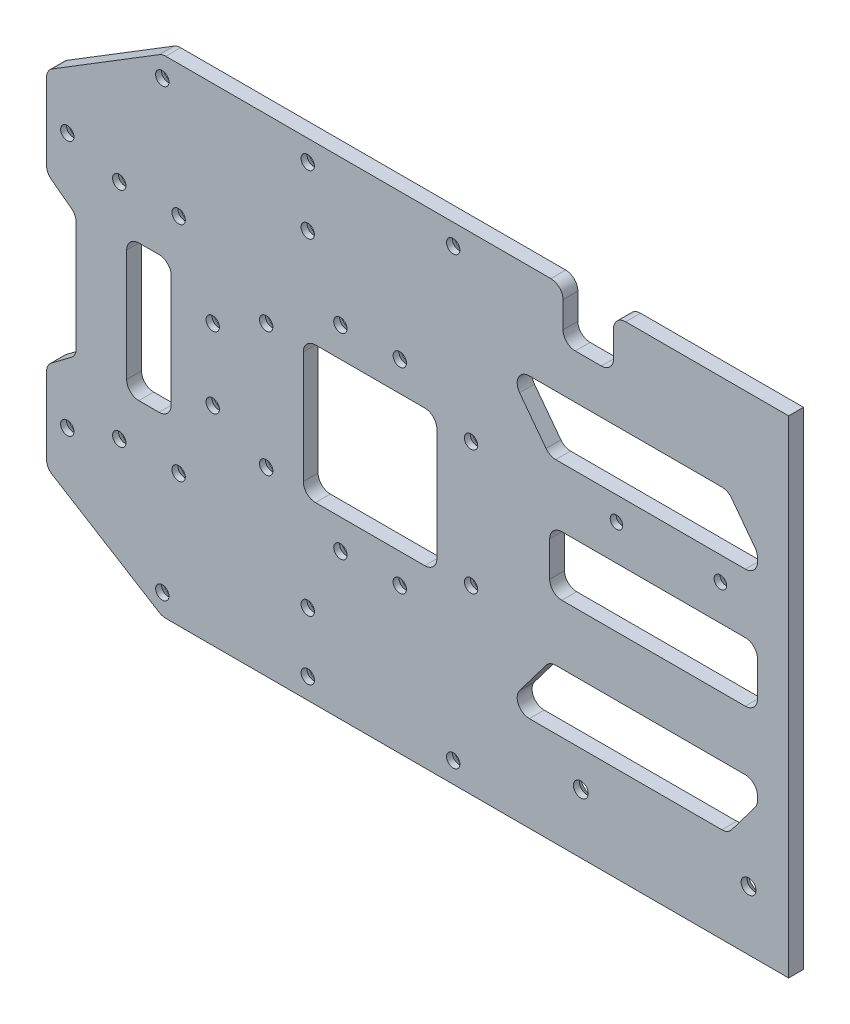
ISO-10303-21;
HEADER;
FILE_DESCRIPTION(('STEP AP214'),'2;1');
FILE_NAME('part.step','',(''),(''),'','','');
FILE_SCHEMA(('AUTOMOTIVE_DESIGN { 1 0 10303 214 1 1 1 1 }'));
ENDSEC;
DATA;
#1=APPLICATION_CONTEXT('core data for automotive mechanical design processes');
#2=APPLICATION_PROTOCOL_DEFINITION('international standard','automotive_design',2000,#1);
#3=PRODUCT_CONTEXT('',#1,'mechanical');
#4=PRODUCT('Part','Part','',(#3));
#5=PRODUCT_RELATED_PRODUCT_CATEGORY('part','',(#4));
#6=PRODUCT_DEFINITION_FORMATION('','',#4);
#7=PRODUCT_DEFINITION_CONTEXT('part definition',#1,'design');
#8=PRODUCT_DEFINITION('design','',#6,#7);
#9=PRODUCT_DEFINITION_SHAPE('','',#8);
#10=(LENGTH_UNIT() NAMED_UNIT(*) SI_UNIT(.MILLI.,.METRE.));
#11=(NAMED_UNIT(*) PLANE_ANGLE_UNIT() SI_UNIT($,.RADIAN.));
#12=(NAMED_UNIT(*) SI_UNIT($,.STERADIAN.) SOLID_ANGLE_UNIT());
#13=UNCERTAINTY_MEASURE_WITH_UNIT(LENGTH_MEASURE(1.E-05),#10,'distance_accuracy_value','');
#14=(GEOMETRIC_REPRESENTATION_CONTEXT(3) GLOBAL_UNCERTAINTY_ASSIGNED_CONTEXT((#13)) GLOBAL_UNIT_ASSIGNED_CONTEXT((#10,
#11,#12)) REPRESENTATION_CONTEXT('',''));
#15=CARTESIAN_POINT('',(0.,0.,0.));
#16=DIRECTION('',(0.,0.,1.));
#17=DIRECTION('',(1.,0.,0.));
#18=AXIS2_PLACEMENT_3D('',#15,#16,#17);
#19=CARTESIAN_POINT('',(-35.,21.,1.69723648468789E-05));
#20=DIRECTION('',(0.,0.,-1.));
#21=DIRECTION('',(-1.,0.,0.));
#22=AXIS2_PLACEMENT_3D('',#19,#20,#21);
#23=CONICAL_SURFACE('',#22,5.24996666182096,0.785396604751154);
#24=CARTESIAN_POINT('',(-35.,21.,2.99999298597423));
#25=DIRECTION('',(0.,0.,-1.));
#26=DIRECTION('',(-1.,0.,0.));
#27=AXIS2_PLACEMENT_3D('',#24,#25,#26);
#28=CIRCLE('',#27,2.25);
#29=CARTESIAN_POINT('',(-37.25,21.,2.99999298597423));
#30=VERTEX_POINT('',#29);
#31=EDGE_CURVE('E455',#30,#30,#28,.F.);
#32=ORIENTED_EDGE('',*,*,#31,.T.);
#33=EDGE_LOOP('',(#32));
#34=FACE_BOUND('',#33,.T.);
#35=CARTESIAN_POINT('',(-35.,21.,0.));
#36=DIRECTION('',(0.,0.,1.));
#37=DIRECTION('',(1.,0.,0.));
#38=AXIS2_PLACEMENT_3D('',#35,#36,#37);
#39=CIRCLE('',#38,5.2499836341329);
#40=CARTESIAN_POINT('',(-29.7500163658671,21.,0.));
#41=VERTEX_POINT('',#40);
#42=EDGE_CURVE('E1201',#41,#41,#39,.F.);
#43=ORIENTED_EDGE('',*,*,#42,.T.);
#44=EDGE_LOOP('',(#43));
#45=FACE_BOUND('',#44,.T.);
#46=ADVANCED_FACE('F16',(#34,#45),#23,.F.);
#47=CARTESIAN_POINT('',(-10.,33.,1.69723080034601E-05));
#48=DIRECTION('',(0.,0.,-1.));
#49=DIRECTION('',(-1.,0.,0.));
#50=AXIS2_PLACEMENT_3D('',#47,#48,#49);
#51=CONICAL_SURFACE('',#50,5.24996666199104,0.78539660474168);
#52=CARTESIAN_POINT('',(-10.,33.,2.99999298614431));
#53=DIRECTION('',(0.,0.,-1.));
#54=DIRECTION('',(-1.,0.,0.));
#55=AXIS2_PLACEMENT_3D('',#52,#53,#54);
#56=CIRCLE('',#55,2.25);
#57=CARTESIAN_POINT('',(-12.25,33.,2.99999298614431));
#58=VERTEX_POINT('',#57);
#59=EDGE_CURVE('E1075',#58,#58,#56,.F.);
#60=ORIENTED_EDGE('',*,*,#59,.T.);
#61=EDGE_LOOP('',(#60));
#62=FACE_BOUND('',#61,.T.);
#63=CARTESIAN_POINT('',(-10.,33.,0.));
#64=DIRECTION('',(0.,0.,1.));
#65=DIRECTION('',(1.,0.,0.));
#66=AXIS2_PLACEMENT_3D('',#63,#64,#65);
#67=CIRCLE('',#66,5.24998363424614);
#68=CARTESIAN_POINT('',(-4.75001636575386,33.,0.));
#69=VERTEX_POINT('',#68);
#70=EDGE_CURVE('E1126',#69,#69,#67,.F.);
#71=ORIENTED_EDGE('',*,*,#70,.T.);
#72=EDGE_LOOP('',(#71));
#73=FACE_BOUND('',#72,.T.);
#74=ADVANCED_FACE('F2339',(#62,#73),#51,.F.);
#75=CARTESIAN_POINT('',(10.,33.,1.69723080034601E-05));
#76=DIRECTION('',(0.,0.,-1.));
#77=DIRECTION('',(-1.,0.,0.));
#78=AXIS2_PLACEMENT_3D('',#75,#76,#77);
#79=CONICAL_SURFACE('',#78,5.24996666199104,0.78539660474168);
#80=CARTESIAN_POINT('',(10.,33.,2.99999298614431));
#81=DIRECTION('',(0.,0.,-1.));
#82=DIRECTION('',(-1.,0.,0.));
#83=AXIS2_PLACEMENT_3D('',#80,#81,#82);
#84=CIRCLE('',#83,2.25);
#85=CARTESIAN_POINT('',(7.75,33.,2.99999298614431));
#86=VERTEX_POINT('',#85);
#87=EDGE_CURVE('E1070',#86,#86,#84,.F.);
#88=ORIENTED_EDGE('',*,*,#87,.T.);
#89=EDGE_LOOP('',(#88));
#90=FACE_BOUND('',#89,.T.);
#91=CARTESIAN_POINT('',(10.,33.,0.));
#92=DIRECTION('',(0.,0.,1.));
#93=DIRECTION('',(1.,0.,0.));
#94=AXIS2_PLACEMENT_3D('',#91,#92,#93);
#95=CIRCLE('',#94,5.24998363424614);
#96=CARTESIAN_POINT('',(15.2499836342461,33.,0.));
#97=VERTEX_POINT('',#96);
#98=EDGE_CURVE('E1129',#97,#97,#95,.F.);
#99=ORIENTED_EDGE('',*,*,#98,.T.);
#100=EDGE_LOOP('',(#99));
#101=FACE_BOUND('',#100,.T.);
#102=ADVANCED_FACE('F2331',(#90,#101),#79,.F.);
#103=CARTESIAN_POINT('',(34.,21.,1.69723648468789E-05));
#104=DIRECTION('',(0.,0.,-1.));
#105=DIRECTION('',(-1.,0.,0.));
#106=AXIS2_PLACEMENT_3D('',#103,#104,#105);
#107=CONICAL_SURFACE('',#106,5.24996666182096,0.785396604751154);
#108=CARTESIAN_POINT('',(34.,21.,2.99999298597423));
#109=DIRECTION('',(0.,0.,-1.));
#110=DIRECTION('',(-1.,0.,0.));
#111=AXIS2_PLACEMENT_3D('',#108,#109,#110);
#112=CIRCLE('',#111,2.25);
#113=CARTESIAN_POINT('',(31.75,21.,2.99999298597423));
#114=VERTEX_POINT('',#113);
#115=EDGE_CURVE('E1065',#114,#114,#112,.F.);
#116=ORIENTED_EDGE('',*,*,#115,.T.);
#117=EDGE_LOOP('',(#116));
#118=FACE_BOUND('',#117,.T.);
#119=CARTESIAN_POINT('',(34.,21.,0.));
#120=DIRECTION('',(0.,0.,1.));
#121=DIRECTION('',(1.,0.,0.));
#122=AXIS2_PLACEMENT_3D('',#119,#120,#121);
#123=CIRCLE('',#122,5.2499836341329);
#124=CARTESIAN_POINT('',(39.2499836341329,21.,0.));
#125=VERTEX_POINT('',#124);
#126=EDGE_CURVE('E1132',#125,#125,#123,.F.);
#127=ORIENTED_EDGE('',*,*,#126,.T.);
#128=EDGE_LOOP('',(#127));
#129=FACE_BOUND('',#128,.T.);
#130=ADVANCED_FACE('F2323',(#118,#129),#107,.F.);
#131=CARTESIAN_POINT('',(-35.,-21.,1.69724785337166E-05));
#132=DIRECTION('',(0.,0.,-1.));
#133=DIRECTION('',(-1.,0.,0.));
#134=AXIS2_PLACEMENT_3D('',#131,#132,#133);
#135=CONICAL_SURFACE('',#134,5.24996666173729,0.785396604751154);
#136=CARTESIAN_POINT('',(-35.,-21.,2.99999298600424));
#137=DIRECTION('',(0.,0.,-1.));
#138=DIRECTION('',(-1.,0.,0.));
#139=AXIS2_PLACEMENT_3D('',#136,#137,#138);
#140=CIRCLE('',#139,2.25);
#141=CARTESIAN_POINT('',(-37.25,-21.,2.99999298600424));
#142=VERTEX_POINT('',#141);
#143=EDGE_CURVE('E1060',#142,#142,#140,.F.);
#144=ORIENTED_EDGE('',*,*,#143,.T.);
#145=EDGE_LOOP('',(#144));
#146=FACE_BOUND('',#145,.T.);
#147=CARTESIAN_POINT('',(-35.,-21.,0.));
#148=DIRECTION('',(0.,0.,1.));
#149=DIRECTION('',(1.,0.,0.));
#150=AXIS2_PLACEMENT_3D('',#147,#148,#149);
#151=CIRCLE('',#150,5.24998363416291);
#152=CARTESIAN_POINT('',(-29.7500163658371,-21.,0.));
#153=VERTEX_POINT('',#152);
#154=EDGE_CURVE('E1192',#153,#153,#151,.F.);
#155=ORIENTED_EDGE('',*,*,#154,.T.);
#156=EDGE_LOOP('',(#155));
#157=FACE_BOUND('',#156,.T.);
#158=ADVANCED_FACE('F2315',(#146,#157),#135,.F.);
#159=CARTESIAN_POINT('',(-10.,-33.,1.69724216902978E-05));
#160=DIRECTION('',(0.,0.,-1.));
#161=DIRECTION('',(-1.,0.,0.));
#162=AXIS2_PLACEMENT_3D('',#159,#160,#161);
#163=CONICAL_SURFACE('',#162,5.24996666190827,0.785396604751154);
#164=CARTESIAN_POINT('',(-10.,-33.,2.99999298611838));
#165=DIRECTION('',(0.,0.,-1.));
#166=DIRECTION('',(-1.,0.,0.));
#167=AXIS2_PLACEMENT_3D('',#164,#165,#166);
#168=CIRCLE('',#167,2.25);
#169=CARTESIAN_POINT('',(-12.25,-33.,2.99999298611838));
#170=VERTEX_POINT('',#169);
#171=EDGE_CURVE('E1055',#170,#170,#168,.F.);
#172=ORIENTED_EDGE('',*,*,#171,.T.);
#173=EDGE_LOOP('',(#172));
#174=FACE_BOUND('',#173,.T.);
#175=CARTESIAN_POINT('',(-10.,-33.,0.));
#176=DIRECTION('',(0.,0.,1.));
#177=DIRECTION('',(1.,0.,0.));
#178=AXIS2_PLACEMENT_3D('',#175,#176,#177);
#179=CIRCLE('',#178,5.24998363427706);
#180=CARTESIAN_POINT('',(-4.75001636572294,-33.,0.));
#181=VERTEX_POINT('',#180);
#182=EDGE_CURVE('E1189',#181,#181,#179,.F.);
#183=ORIENTED_EDGE('',*,*,#182,.T.);
#184=EDGE_LOOP('',(#183));
#185=FACE_BOUND('',#184,.T.);
#186=ADVANCED_FACE('F2307',(#174,#185),#163,.F.);
#187=CARTESIAN_POINT('',(10.,-33.,1.69724216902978E-05));
#188=DIRECTION('',(0.,0.,-1.));
#189=DIRECTION('',(-1.,0.,0.));
#190=AXIS2_PLACEMENT_3D('',#187,#188,#189);
#191=CONICAL_SURFACE('',#190,5.24996666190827,0.785396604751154);
#192=CARTESIAN_POINT('',(10.,-33.,2.99999298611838));
#193=DIRECTION('',(0.,0.,-1.));
#194=DIRECTION('',(-1.,0.,0.));
#195=AXIS2_PLACEMENT_3D('',#192,#193,#194);
#196=CIRCLE('',#195,2.25);
#197=CARTESIAN_POINT('',(7.75,-33.,2.99999298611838));
#198=VERTEX_POINT('',#197);
#199=EDGE_CURVE('E1050',#198,#198,#196,.F.);
#200=ORIENTED_EDGE('',*,*,#199,.T.);
#201=EDGE_LOOP('',(#200));
#202=FACE_BOUND('',#201,.T.);
#203=CARTESIAN_POINT('',(10.,-33.,0.));
#204=DIRECTION('',(0.,0.,1.));
#205=DIRECTION('',(1.,0.,0.));
#206=AXIS2_PLACEMENT_3D('',#203,#204,#205);
#207=CIRCLE('',#206,5.24998363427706);
#208=CARTESIAN_POINT('',(15.2499836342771,-33.,0.));
#209=VERTEX_POINT('',#208);
#210=EDGE_CURVE('E1186',#209,#209,#207,.F.);
#211=ORIENTED_EDGE('',*,*,#210,.T.);
#212=EDGE_LOOP('',(#211));
#213=FACE_BOUND('',#212,.T.);
#214=ADVANCED_FACE('F2299',(#202,#213),#191,.F.);
#215=CARTESIAN_POINT('',(34.,-21.,1.69724785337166E-05));
#216=DIRECTION('',(0.,0.,-1.));
#217=DIRECTION('',(-1.,0.,0.));
#218=AXIS2_PLACEMENT_3D('',#215,#216,#217);
#219=CONICAL_SURFACE('',#218,5.24996666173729,0.785396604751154);
#220=CARTESIAN_POINT('',(34.,-21.,2.99999298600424));
#221=DIRECTION('',(0.,0.,-1.));
#222=DIRECTION('',(-1.,0.,0.));
#223=AXIS2_PLACEMENT_3D('',#220,#221,#222);
#224=CIRCLE('',#223,2.25);
#225=CARTESIAN_POINT('',(31.75,-21.,2.99999298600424));
#226=VERTEX_POINT('',#225);
#227=EDGE_CURVE('E1045',#226,#226,#224,.F.);
#228=ORIENTED_EDGE('',*,*,#227,.T.);
#229=EDGE_LOOP('',(#228));
#230=FACE_BOUND('',#229,.T.);
#231=CARTESIAN_POINT('',(34.,-21.,0.));
#232=DIRECTION('',(0.,0.,1.));
#233=DIRECTION('',(1.,0.,0.));
#234=AXIS2_PLACEMENT_3D('',#231,#232,#233);
#235=CIRCLE('',#234,5.24998363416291);
#236=CARTESIAN_POINT('',(39.2499836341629,-21.,0.));
#237=VERTEX_POINT('',#236);
#238=EDGE_CURVE('E1183',#237,#237,#235,.F.);
#239=ORIENTED_EDGE('',*,*,#238,.T.);
#240=EDGE_LOOP('',(#239));
#241=FACE_BOUND('',#240,.T.);
#242=ADVANCED_FACE('F2291',(#230,#241),#219,.F.);
#243=CARTESIAN_POINT('',(-84.5,37.5,1.69724785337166E-05));
#244=DIRECTION('',(0.,0.,-1.));
#245=DIRECTION('',(-1.,0.,0.));
#246=AXIS2_PLACEMENT_3D('',#243,#244,#245);
#247=CONICAL_SURFACE('',#246,5.24996666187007,0.78539660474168);
#248=CARTESIAN_POINT('',(-84.5,37.5,2.99999298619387));
#249=DIRECTION('',(0.,0.,-1.));
#250=DIRECTION('',(-1.,0.,0.));
#251=AXIS2_PLACEMENT_3D('',#248,#249,#250);
#252=CIRCLE('',#251,2.25);
#253=CARTESIAN_POINT('',(-86.75,37.5,2.99999298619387));
#254=VERTEX_POINT('',#253);
#255=EDGE_CURVE('E1040',#254,#254,#252,.F.);
#256=ORIENTED_EDGE('',*,*,#255,.T.);
#257=EDGE_LOOP('',(#256));
#258=FACE_BOUND('',#257,.T.);
#259=CARTESIAN_POINT('',(-84.5,37.5,0.));
#260=DIRECTION('',(0.,0.,1.));
#261=DIRECTION('',(1.,0.,0.));
#262=AXIS2_PLACEMENT_3D('',#259,#260,#261);
#263=CIRCLE('',#262,5.2499836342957);
#264=CARTESIAN_POINT('',(-79.2500163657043,37.5,0.));
#265=VERTEX_POINT('',#264);
#266=EDGE_CURVE('E1147',#265,#265,#263,.F.);
#267=ORIENTED_EDGE('',*,*,#266,.T.);
#268=EDGE_LOOP('',(#267));
#269=FACE_BOUND('',#268,.T.);
#270=ADVANCED_FACE('F2283',(#258,#269),#247,.F.);
#271=CARTESIAN_POINT('',(-64.5,37.5,1.69724785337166E-05));
#272=DIRECTION('',(0.,0.,-1.));
#273=DIRECTION('',(-1.,0.,0.));
#274=AXIS2_PLACEMENT_3D('',#271,#272,#273);
#275=CONICAL_SURFACE('',#274,5.24996666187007,0.78539660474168);
#276=CARTESIAN_POINT('',(-64.5,37.5,2.99999298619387));
#277=DIRECTION('',(0.,0.,-1.));
#278=DIRECTION('',(-1.,0.,0.));
#279=AXIS2_PLACEMENT_3D('',#276,#277,#278);
#280=CIRCLE('',#279,2.25);
#281=CARTESIAN_POINT('',(-66.75,37.5,2.99999298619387));
#282=VERTEX_POINT('',#281);
#283=EDGE_CURVE('E1035',#282,#282,#280,.F.);
#284=ORIENTED_EDGE('',*,*,#283,.T.);
#285=EDGE_LOOP('',(#284));
#286=FACE_BOUND('',#285,.T.);
#287=CARTESIAN_POINT('',(-64.5,37.5,0.));
#288=DIRECTION('',(0.,0.,1.));
#289=DIRECTION('',(1.,0.,0.));
#290=AXIS2_PLACEMENT_3D('',#287,#288,#289);
#291=CIRCLE('',#290,5.2499836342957);
#292=CARTESIAN_POINT('',(-59.2500163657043,37.5,0.));
#293=VERTEX_POINT('',#292);
#294=EDGE_CURVE('E1144',#293,#293,#291,.F.);
#295=ORIENTED_EDGE('',*,*,#294,.T.);
#296=EDGE_LOOP('',(#295));
#297=FACE_BOUND('',#296,.T.);
#298=ADVANCED_FACE('F2275',(#286,#297),#275,.F.);
#299=CARTESIAN_POINT('',(-84.5,-37.5,1.69723080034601E-05));
#300=DIRECTION('',(0.,0.,-1.));
#301=DIRECTION('',(-1.,0.,0.));
#302=AXIS2_PLACEMENT_3D('',#299,#300,#301);
#303=CONICAL_SURFACE('',#302,5.24996666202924,0.785396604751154);
#304=CARTESIAN_POINT('',(-84.5,-37.5,2.99999298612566));
#305=DIRECTION('',(0.,0.,-1.));
#306=DIRECTION('',(-1.,0.,0.));
#307=AXIS2_PLACEMENT_3D('',#304,#305,#306);
#308=CIRCLE('',#307,2.25);
#309=CARTESIAN_POINT('',(-86.75,-37.5,2.99999298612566));
#310=VERTEX_POINT('',#309);
#311=EDGE_CURVE('E1030',#310,#310,#308,.F.);
#312=ORIENTED_EDGE('',*,*,#311,.T.);
#313=EDGE_LOOP('',(#312));
#314=FACE_BOUND('',#313,.T.);
#315=CARTESIAN_POINT('',(-84.5,-37.5,0.));
#316=DIRECTION('',(0.,0.,1.));
#317=DIRECTION('',(1.,0.,0.));
#318=AXIS2_PLACEMENT_3D('',#315,#316,#317);
#319=CIRCLE('',#318,5.24998363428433);
#320=CARTESIAN_POINT('',(-79.2500163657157,-37.5,0.));
#321=VERTEX_POINT('',#320);
#322=EDGE_CURVE('E1165',#321,#321,#319,.F.);
#323=ORIENTED_EDGE('',*,*,#322,.T.);
#324=EDGE_LOOP('',(#323));
#325=FACE_BOUND('',#324,.T.);
#326=ADVANCED_FACE('F2267',(#314,#325),#303,.F.);
#327=CARTESIAN_POINT('',(-64.5,-37.5,1.69723080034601E-05));
#328=DIRECTION('',(0.,0.,-1.));
#329=DIRECTION('',(-1.,0.,0.));
#330=AXIS2_PLACEMENT_3D('',#327,#328,#329);
#331=CONICAL_SURFACE('',#330,5.24996666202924,0.785396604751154);
#332=CARTESIAN_POINT('',(-64.5,-37.5,2.99999298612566));
#333=DIRECTION('',(0.,0.,-1.));
#334=DIRECTION('',(-1.,0.,0.));
#335=AXIS2_PLACEMENT_3D('',#332,#333,#334);
#336=CIRCLE('',#335,2.25);
#337=CARTESIAN_POINT('',(-66.75,-37.5,2.99999298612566));
#338=VERTEX_POINT('',#337);
#339=EDGE_CURVE('E1025',#338,#338,#336,.F.);
#340=ORIENTED_EDGE('',*,*,#339,.T.);
#341=EDGE_LOOP('',(#340));
#342=FACE_BOUND('',#341,.T.);
#343=CARTESIAN_POINT('',(-64.5,-37.5,0.));
#344=DIRECTION('',(0.,0.,1.));
#345=DIRECTION('',(1.,0.,0.));
#346=AXIS2_PLACEMENT_3D('',#343,#344,#345);
#347=CIRCLE('',#346,5.24998363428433);
#348=CARTESIAN_POINT('',(-59.2500163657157,-37.5,0.));
#349=VERTEX_POINT('',#348);
#350=EDGE_CURVE('E1168',#349,#349,#347,.F.);
#351=ORIENTED_EDGE('',*,*,#350,.T.);
#352=EDGE_LOOP('',(#351));
#353=FACE_BOUND('',#352,.T.);
#354=ADVANCED_FACE('F2259',(#342,#353),#331,.F.);
#355=CARTESIAN_POINT('',(83.,22.,-5.25434415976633E-05));
#356=DIRECTION('',(0.,0.,-1.));
#357=DIRECTION('',(-1.,0.,0.));
#358=AXIS2_PLACEMENT_3D('',#355,#356,#357);
#359=CONICAL_SURFACE('',#358,5.09990818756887,0.785384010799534);
#360=CARTESIAN_POINT('',(83.,22.,2.99994055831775));
#361=DIRECTION('',(0.,0.,-1.));
#362=DIRECTION('',(-1.,0.,0.));
#363=AXIS2_PLACEMENT_3D('',#360,#361,#362);
#364=CIRCLE('',#363,2.1);
#365=CARTESIAN_POINT('',(80.9,22.,2.99994055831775));
#366=VERTEX_POINT('',#365);
#367=EDGE_CURVE('E1020',#366,#366,#364,.F.);
#368=ORIENTED_EDGE('',*,*,#367,.T.);
#369=EDGE_LOOP('',(#368));
#370=FACE_BOUND('',#369,.T.);
#371=CARTESIAN_POINT('',(83.,22.,0.));
#372=DIRECTION('',(0.,0.,1.));
#373=DIRECTION('',(1.,0.,0.));
#374=AXIS2_PLACEMENT_3D('',#371,#372,#373);
#375=CIRCLE('',#374,5.0998556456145);
#376=CARTESIAN_POINT('',(88.0998556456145,22.,0.));
#377=VERTEX_POINT('',#376);
#378=EDGE_CURVE('E1204',#377,#377,#375,.F.);
#379=ORIENTED_EDGE('',*,*,#378,.T.);
#380=EDGE_LOOP('',(#379));
#381=FACE_BOUND('',#380,.T.);
#382=ADVANCED_FACE('F2251',(#370,#381),#359,.F.);
#383=CARTESIAN_POINT('',(118.,22.,-5.25434415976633E-05));
#384=DIRECTION('',(0.,0.,-1.));
#385=DIRECTION('',(-1.,0.,0.));
#386=AXIS2_PLACEMENT_3D('',#383,#384,#385);
#387=CONICAL_SURFACE('',#386,5.09990818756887,0.785384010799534);
#388=CARTESIAN_POINT('',(118.,22.,2.99994055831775));
#389=DIRECTION('',(0.,0.,-1.));
#390=DIRECTION('',(-1.,0.,0.));
#391=AXIS2_PLACEMENT_3D('',#388,#389,#390);
#392=CIRCLE('',#391,2.1);
#393=CARTESIAN_POINT('',(115.9,22.,2.99994055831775));
#394=VERTEX_POINT('',#393);
#395=EDGE_CURVE('E1015',#394,#394,#392,.F.);
#396=ORIENTED_EDGE('',*,*,#395,.T.);
#397=EDGE_LOOP('',(#396));
#398=FACE_BOUND('',#397,.T.);
#399=CARTESIAN_POINT('',(118.,22.,0.));
#400=DIRECTION('',(0.,0.,1.));
#401=DIRECTION('',(1.,0.,0.));
#402=AXIS2_PLACEMENT_3D('',#399,#400,#401);
#403=CIRCLE('',#402,5.0998556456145);
#404=CARTESIAN_POINT('',(123.099855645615,22.,0.));
#405=VERTEX_POINT('',#404);
#406=EDGE_CURVE('E1207',#405,#405,#403,.F.);
#407=ORIENTED_EDGE('',*,*,#406,.T.);
#408=EDGE_LOOP('',(#407));
#409=FACE_BOUND('',#408,.T.);
#410=ADVANCED_FACE('F2243',(#398,#409),#387,.F.);
#411=CARTESIAN_POINT('',(71.,-62.,0.000337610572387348));
#412=DIRECTION('',(0.,0.,-1.));
#413=DIRECTION('',(-1.,0.,0.));
#414=AXIS2_PLACEMENT_3D('',#411,#412,#413);
#415=CONICAL_SURFACE('',#414,5.50030310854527,0.78545641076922);
#416=CARTESIAN_POINT('',(71.,-62.,3.00029121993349));
#417=DIRECTION('',(0.,0.,-1.));
#418=DIRECTION('',(-1.,0.,0.));
#419=AXIS2_PLACEMENT_3D('',#416,#417,#418);
#420=CIRCLE('',#419,2.5);
#421=CARTESIAN_POINT('',(68.5,-62.,3.00029121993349));
#422=VERTEX_POINT('',#421);
#423=EDGE_CURVE('E1010',#422,#422,#420,.F.);
#424=ORIENTED_EDGE('',*,*,#423,.T.);
#425=EDGE_LOOP('',(#424));
#426=FACE_BOUND('',#425,.T.);
#427=CARTESIAN_POINT('',(71.,-62.,0.));
#428=DIRECTION('',(0.,0.,1.));
#429=DIRECTION('',(1.,0.,0.));
#430=AXIS2_PLACEMENT_3D('',#427,#428,#429);
#431=CIRCLE('',#430,5.5006407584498);
#432=CARTESIAN_POINT('',(76.5006407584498,-62.,0.));
#433=VERTEX_POINT('',#432);
#434=EDGE_CURVE('E1156',#433,#433,#431,.F.);
#435=ORIENTED_EDGE('',*,*,#434,.T.);
#436=EDGE_LOOP('',(#435));
#437=FACE_BOUND('',#436,.T.);
#438=ADVANCED_FACE('F2235',(#426,#437),#415,.F.);
#439=CARTESIAN_POINT('',(127.5,-62.,0.000337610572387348));
#440=DIRECTION('',(0.,0.,-1.));
#441=DIRECTION('',(-1.,0.,0.));
#442=AXIS2_PLACEMENT_3D('',#439,#440,#441);
#443=CONICAL_SURFACE('',#442,5.50030310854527,0.78545641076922);
#444=CARTESIAN_POINT('',(127.5,-62.,3.00029121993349));
#445=DIRECTION('',(0.,0.,-1.));
#446=DIRECTION('',(-1.,0.,0.));
#447=AXIS2_PLACEMENT_3D('',#444,#445,#446);
#448=CIRCLE('',#447,2.5);
#449=CARTESIAN_POINT('',(125.,-62.,3.00029121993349));
#450=VERTEX_POINT('',#449);
#451=EDGE_CURVE('E1005',#450,#450,#448,.F.);
#452=ORIENTED_EDGE('',*,*,#451,.T.);
#453=EDGE_LOOP('',(#452));
#454=FACE_BOUND('',#453,.T.);
#455=CARTESIAN_POINT('',(127.5,-62.,0.));
#456=DIRECTION('',(0.,0.,1.));
#457=DIRECTION('',(1.,0.,0.));
#458=AXIS2_PLACEMENT_3D('',#455,#456,#457);
#459=CIRCLE('',#458,5.5006407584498);
#460=CARTESIAN_POINT('',(133.00064075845,-62.,0.));
#461=VERTEX_POINT('',#460);
#462=EDGE_CURVE('E1159',#461,#461,#459,.F.);
#463=ORIENTED_EDGE('',*,*,#462,.T.);
#464=EDGE_LOOP('',(#463));
#465=FACE_BOUND('',#464,.T.);
#466=ADVANCED_FACE('F2227',(#454,#465),#443,.F.);
#467=CARTESIAN_POINT('',(-21.,55.,1.69723080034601E-05));
#468=DIRECTION('',(0.,0.,-1.));
#469=DIRECTION('',(-1.,0.,0.));
#470=AXIS2_PLACEMENT_3D('',#467,#468,#469);
#471=CONICAL_SURFACE('',#470,5.24996666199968,0.78539660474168);
#472=CARTESIAN_POINT('',(-21.,55.,2.99999298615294));
#473=DIRECTION('',(0.,0.,-1.));
#474=DIRECTION('',(-1.,0.,0.));
#475=AXIS2_PLACEMENT_3D('',#472,#473,#474);
#476=CIRCLE('',#475,2.25);
#477=CARTESIAN_POINT('',(-23.25,55.,2.99999298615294));
#478=VERTEX_POINT('',#477);
#479=EDGE_CURVE('E1000',#478,#478,#476,.F.);
#480=ORIENTED_EDGE('',*,*,#479,.T.);
#481=EDGE_LOOP('',(#480));
#482=FACE_BOUND('',#481,.T.);
#483=CARTESIAN_POINT('',(-21.,55.,0.));
#484=DIRECTION('',(0.,0.,1.));
#485=DIRECTION('',(1.,0.,0.));
#486=AXIS2_PLACEMENT_3D('',#483,#484,#485);
#487=CIRCLE('',#486,5.24998363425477);
#488=CARTESIAN_POINT('',(-15.7500163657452,55.,0.));
#489=VERTEX_POINT('',#488);
#490=EDGE_CURVE('E1141',#489,#489,#487,.F.);
#491=ORIENTED_EDGE('',*,*,#490,.T.);
#492=EDGE_LOOP('',(#491));
#493=FACE_BOUND('',#492,.T.);
#494=ADVANCED_FACE('F2219',(#482,#493),#471,.F.);
#495=CARTESIAN_POINT('',(-102.,43.,1.69723080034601E-05));
#496=DIRECTION('',(0.,0.,-1.));
#497=DIRECTION('',(-1.,0.,0.));
#498=AXIS2_PLACEMENT_3D('',#495,#496,#497);
#499=CONICAL_SURFACE('',#498,5.24996666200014,0.78539660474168);
#500=CARTESIAN_POINT('',(-102.,43.,2.9999929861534));
#501=DIRECTION('',(0.,0.,-1.));
#502=DIRECTION('',(-1.,0.,0.));
#503=AXIS2_PLACEMENT_3D('',#500,#501,#502);
#504=CIRCLE('',#503,2.25);
#505=CARTESIAN_POINT('',(-104.25,43.,2.9999929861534));
#506=VERTEX_POINT('',#505);
#507=EDGE_CURVE('E995',#506,#506,#504,.F.);
#508=ORIENTED_EDGE('',*,*,#507,.T.);
#509=EDGE_LOOP('',(#508));
#510=FACE_BOUND('',#509,.T.);
#511=CARTESIAN_POINT('',(-102.,43.,0.));
#512=DIRECTION('',(0.,0.,1.));
#513=DIRECTION('',(1.,0.,0.));
#514=AXIS2_PLACEMENT_3D('',#511,#512,#513);
#515=CIRCLE('',#514,5.24998363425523);
#516=CARTESIAN_POINT('',(-96.7500163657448,43.,0.));
#517=VERTEX_POINT('',#516);
#518=EDGE_CURVE('E1150',#517,#517,#515,.F.);
#519=ORIENTED_EDGE('',*,*,#518,.T.);
#520=EDGE_LOOP('',(#519));
#521=FACE_BOUND('',#520,.T.);
#522=ADVANCED_FACE('F2211',(#510,#521),#499,.F.);
#523=CARTESIAN_POINT('',(-21.,-55.,1.69723648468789E-05));
#524=DIRECTION('',(0.,0.,-1.));
#525=DIRECTION('',(-1.,0.,0.));
#526=AXIS2_PLACEMENT_3D('',#523,#524,#525);
#527=CONICAL_SURFACE('',#526,5.24996666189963,0.78539660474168);
#528=CARTESIAN_POINT('',(-21.,-55.,2.99999298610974));
#529=DIRECTION('',(0.,0.,-1.));
#530=DIRECTION('',(-1.,0.,0.));
#531=AXIS2_PLACEMENT_3D('',#528,#529,#530);
#532=CIRCLE('',#531,2.25);
#533=CARTESIAN_POINT('',(-23.25,-55.,2.99999298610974));
#534=VERTEX_POINT('',#533);
#535=EDGE_CURVE('E990',#534,#534,#532,.F.);
#536=ORIENTED_EDGE('',*,*,#535,.T.);
#537=EDGE_LOOP('',(#536));
#538=FACE_BOUND('',#537,.T.);
#539=CARTESIAN_POINT('',(-21.,-55.,0.));
#540=DIRECTION('',(0.,0.,1.));
#541=DIRECTION('',(1.,0.,0.));
#542=AXIS2_PLACEMENT_3D('',#539,#540,#541);
#543=CIRCLE('',#542,5.24998363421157);
#544=CARTESIAN_POINT('',(-15.7500163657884,-55.,0.));
#545=VERTEX_POINT('',#544);
#546=EDGE_CURVE('E1177',#545,#545,#543,.F.);
#547=ORIENTED_EDGE('',*,*,#546,.T.);
#548=EDGE_LOOP('',(#547));
#549=FACE_BOUND('',#548,.T.);
#550=ADVANCED_FACE('F2203',(#538,#549),#527,.F.);
#551=CARTESIAN_POINT('',(-102.,-43.,1.69723080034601E-05));
#552=DIRECTION('',(0.,0.,-1.));
#553=DIRECTION('',(-1.,0.,0.));
#554=AXIS2_PLACEMENT_3D('',#551,#552,#553);
#555=CONICAL_SURFACE('',#554,5.24996666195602,0.78539660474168);
#556=CARTESIAN_POINT('',(-102.,-43.,2.99999298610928));
#557=DIRECTION('',(0.,0.,-1.));
#558=DIRECTION('',(-1.,0.,0.));
#559=AXIS2_PLACEMENT_3D('',#556,#557,#558);
#560=CIRCLE('',#559,2.25);
#561=CARTESIAN_POINT('',(-104.25,-43.,2.99999298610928));
#562=VERTEX_POINT('',#561);
#563=EDGE_CURVE('E985',#562,#562,#560,.F.);
#564=ORIENTED_EDGE('',*,*,#563,.T.);
#565=EDGE_LOOP('',(#564));
#566=FACE_BOUND('',#565,.T.);
#567=CARTESIAN_POINT('',(-102.,-43.,0.));
#568=DIRECTION('',(0.,0.,1.));
#569=DIRECTION('',(1.,0.,0.));
#570=AXIS2_PLACEMENT_3D('',#567,#568,#569);
#571=CIRCLE('',#570,5.24998363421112);
#572=CARTESIAN_POINT('',(-96.7500163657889,-43.,0.));
#573=VERTEX_POINT('',#572);
#574=EDGE_CURVE('E1162',#573,#573,#571,.F.);
#575=ORIENTED_EDGE('',*,*,#574,.T.);
#576=EDGE_LOOP('',(#575));
#577=FACE_BOUND('',#576,.T.);
#578=ADVANCED_FACE('F2195',(#566,#577),#555,.F.);
#579=CARTESIAN_POINT('',(-53.,12.,1.69723648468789E-05));
#580=DIRECTION('',(0.,0.,-1.));
#581=DIRECTION('',(-1.,0.,0.));
#582=AXIS2_PLACEMENT_3D('',#579,#580,#581);
#583=CONICAL_SURFACE('',#582,5.24996666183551,0.78539660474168);
#584=CARTESIAN_POINT('',(-53.,12.,2.99999298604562));
#585=DIRECTION('',(0.,0.,-1.));
#586=DIRECTION('',(-1.,0.,0.));
#587=AXIS2_PLACEMENT_3D('',#584,#585,#586);
#588=CIRCLE('',#587,2.25);
#589=CARTESIAN_POINT('',(-55.25,12.,2.99999298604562));
#590=VERTEX_POINT('',#589);
#591=EDGE_CURVE('E980',#590,#590,#588,.F.);
#592=ORIENTED_EDGE('',*,*,#591,.T.);
#593=EDGE_LOOP('',(#592));
#594=FACE_BOUND('',#593,.T.);
#595=CARTESIAN_POINT('',(-53.,12.,0.));
#596=DIRECTION('',(0.,0.,1.));
#597=DIRECTION('',(1.,0.,0.));
#598=AXIS2_PLACEMENT_3D('',#595,#596,#597);
#599=CIRCLE('',#598,5.24998363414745);
#600=CARTESIAN_POINT('',(-47.7500163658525,12.,0.));
#601=VERTEX_POINT('',#600);
#602=EDGE_CURVE('E1198',#601,#601,#599,.F.);
#603=ORIENTED_EDGE('',*,*,#602,.T.);
#604=EDGE_LOOP('',(#603));
#605=FACE_BOUND('',#604,.T.);
#606=ADVANCED_FACE('F2187',(#594,#605),#583,.F.);
#607=CARTESIAN_POINT('',(-53.,-12.,1.69724785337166E-05));
#608=DIRECTION('',(0.,0.,-1.));
#609=DIRECTION('',(-1.,0.,0.));
#610=AXIS2_PLACEMENT_3D('',#607,#608,#609);
#611=CONICAL_SURFACE('',#610,5.24996666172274,0.78539660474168);
#612=CARTESIAN_POINT('',(-53.,-12.,2.99999298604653));
#613=DIRECTION('',(0.,0.,-1.));
#614=DIRECTION('',(-1.,0.,0.));
#615=AXIS2_PLACEMENT_3D('',#612,#613,#614);
#616=CIRCLE('',#615,2.25);
#617=CARTESIAN_POINT('',(-55.25,-12.,2.99999298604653));
#618=VERTEX_POINT('',#617);
#619=EDGE_CURVE('E975',#618,#618,#616,.F.);
#620=ORIENTED_EDGE('',*,*,#619,.T.);
#621=EDGE_LOOP('',(#620));
#622=FACE_BOUND('',#621,.T.);
#623=CARTESIAN_POINT('',(-53.,-12.,0.));
#624=DIRECTION('',(0.,0.,1.));
#625=DIRECTION('',(1.,0.,0.));
#626=AXIS2_PLACEMENT_3D('',#623,#624,#625);
#627=CIRCLE('',#626,5.24998363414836);
#628=CARTESIAN_POINT('',(-47.7500163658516,-12.,0.));
#629=VERTEX_POINT('',#628);
#630=EDGE_CURVE('E1195',#629,#629,#627,.F.);
#631=ORIENTED_EDGE('',*,*,#630,.T.);
#632=EDGE_LOOP('',(#631));
#633=FACE_BOUND('',#632,.T.);
#634=ADVANCED_FACE('F2179',(#622,#633),#611,.F.);
#635=CARTESIAN_POINT('',(-21.,75.,1.69724785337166E-05));
#636=DIRECTION('',(0.,0.,-1.));
#637=DIRECTION('',(-1.,0.,0.));
#638=AXIS2_PLACEMENT_3D('',#635,#636,#637);
#639=CONICAL_SURFACE('',#638,5.24996666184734,0.78539660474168);
#640=CARTESIAN_POINT('',(-21.,75.,2.99999298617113));
#641=DIRECTION('',(0.,0.,-1.));
#642=DIRECTION('',(-1.,0.,0.));
#643=AXIS2_PLACEMENT_3D('',#640,#641,#642);
#644=CIRCLE('',#643,2.25);
#645=CARTESIAN_POINT('',(-23.25,75.,2.99999298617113));
#646=VERTEX_POINT('',#645);
#647=EDGE_CURVE('E970',#646,#646,#644,.F.);
#648=ORIENTED_EDGE('',*,*,#647,.T.);
#649=EDGE_LOOP('',(#648));
#650=FACE_BOUND('',#649,.T.);
#651=CARTESIAN_POINT('',(-21.,75.,0.));
#652=DIRECTION('',(0.,0.,1.));
#653=DIRECTION('',(1.,0.,0.));
#654=AXIS2_PLACEMENT_3D('',#651,#652,#653);
#655=CIRCLE('',#654,5.24998363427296);
#656=CARTESIAN_POINT('',(-15.750016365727,75.,0.));
#657=VERTEX_POINT('',#656);
#658=EDGE_CURVE('E1138',#657,#657,#655,.F.);
#659=ORIENTED_EDGE('',*,*,#658,.T.);
#660=EDGE_LOOP('',(#659));
#661=FACE_BOUND('',#660,.T.);
#662=ADVANCED_FACE('F2171',(#650,#661),#639,.F.);
#663=CARTESIAN_POINT('',(28.,75.,1.69724785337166E-05));
#664=DIRECTION('',(0.,0.,-1.));
#665=DIRECTION('',(-1.,0.,0.));
#666=AXIS2_PLACEMENT_3D('',#663,#664,#665);
#667=CONICAL_SURFACE('',#666,5.24996666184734,0.78539660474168);
#668=CARTESIAN_POINT('',(28.,75.,2.99999298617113));
#669=DIRECTION('',(0.,0.,-1.));
#670=DIRECTION('',(-1.,0.,0.));
#671=AXIS2_PLACEMENT_3D('',#668,#669,#670);
#672=CIRCLE('',#671,2.25);
#673=CARTESIAN_POINT('',(25.75,75.,2.99999298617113));
#674=VERTEX_POINT('',#673);
#675=EDGE_CURVE('E965',#674,#674,#672,.F.);
#676=ORIENTED_EDGE('',*,*,#675,.T.);
#677=EDGE_LOOP('',(#676));
#678=FACE_BOUND('',#677,.T.);
#679=CARTESIAN_POINT('',(28.,75.,0.));
#680=DIRECTION('',(0.,0.,1.));
#681=DIRECTION('',(1.,0.,0.));
#682=AXIS2_PLACEMENT_3D('',#679,#680,#681);
#683=CIRCLE('',#682,5.24998363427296);
#684=CARTESIAN_POINT('',(33.249983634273,75.,0.));
#685=VERTEX_POINT('',#684);
#686=EDGE_CURVE('E1135',#685,#685,#683,.F.);
#687=ORIENTED_EDGE('',*,*,#686,.T.);
#688=EDGE_LOOP('',(#687));
#689=FACE_BOUND('',#688,.T.);
#690=ADVANCED_FACE('F2163',(#678,#689),#667,.F.);
#691=CARTESIAN_POINT('',(-70.,75.,1.69724785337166E-05));
#692=DIRECTION('',(0.,0.,-1.));
#693=DIRECTION('',(-1.,0.,0.));
#694=AXIS2_PLACEMENT_3D('',#691,#692,#693);
#695=CONICAL_SURFACE('',#694,5.24996666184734,0.78539660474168);
#696=CARTESIAN_POINT('',(-70.,75.,2.99999298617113));
#697=DIRECTION('',(0.,0.,-1.));
#698=DIRECTION('',(-1.,0.,0.));
#699=AXIS2_PLACEMENT_3D('',#696,#697,#698);
#700=CIRCLE('',#699,2.25);
#701=CARTESIAN_POINT('',(-72.25,75.,2.99999298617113));
#702=VERTEX_POINT('',#701);
#703=EDGE_CURVE('E960',#702,#702,#700,.F.);
#704=ORIENTED_EDGE('',*,*,#703,.T.);
#705=EDGE_LOOP('',(#704));
#706=FACE_BOUND('',#705,.T.);
#707=CARTESIAN_POINT('',(-70.,75.,0.));
#708=DIRECTION('',(0.,0.,1.));
#709=DIRECTION('',(1.,0.,0.));
#710=AXIS2_PLACEMENT_3D('',#707,#708,#709);
#711=CIRCLE('',#710,5.24998363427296);
#712=CARTESIAN_POINT('',(-64.750016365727,75.,0.));
#713=VERTEX_POINT('',#712);
#714=EDGE_CURVE('E1153',#713,#713,#711,.F.);
#715=ORIENTED_EDGE('',*,*,#714,.T.);
#716=EDGE_LOOP('',(#715));
#717=FACE_BOUND('',#716,.T.);
#718=ADVANCED_FACE('F2155',(#706,#717),#695,.F.);
#719=CARTESIAN_POINT('',(-21.,-75.,1.69724216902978E-05));
#720=DIRECTION('',(0.,0.,-1.));
#721=DIRECTION('',(-1.,0.,0.));
#722=AXIS2_PLACEMENT_3D('',#719,#720,#721);
#723=CONICAL_SURFACE('',#722,5.24996666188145,0.785396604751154);
#724=CARTESIAN_POINT('',(-21.,-75.,2.99999298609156));
#725=DIRECTION('',(0.,0.,-1.));
#726=DIRECTION('',(-1.,0.,0.));
#727=AXIS2_PLACEMENT_3D('',#724,#725,#726);
#728=CIRCLE('',#727,2.25);
#729=CARTESIAN_POINT('',(-23.25,-75.,2.99999298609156));
#730=VERTEX_POINT('',#729);
#731=EDGE_CURVE('E955',#730,#730,#728,.F.);
#732=ORIENTED_EDGE('',*,*,#731,.T.);
#733=EDGE_LOOP('',(#732));
#734=FACE_BOUND('',#733,.T.);
#735=CARTESIAN_POINT('',(-21.,-75.,0.));
#736=DIRECTION('',(0.,0.,1.));
#737=DIRECTION('',(1.,0.,0.));
#738=AXIS2_PLACEMENT_3D('',#735,#736,#737);
#739=CIRCLE('',#738,5.24998363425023);
#740=CARTESIAN_POINT('',(-15.7500163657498,-75.,0.));
#741=VERTEX_POINT('',#740);
#742=EDGE_CURVE('E1174',#741,#741,#739,.F.);
#743=ORIENTED_EDGE('',*,*,#742,.T.);
#744=EDGE_LOOP('',(#743));
#745=FACE_BOUND('',#744,.T.);
#746=ADVANCED_FACE('F2147',(#734,#745),#723,.F.);
#747=CARTESIAN_POINT('',(28.,-75.,1.69724216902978E-05));
#748=DIRECTION('',(0.,0.,-1.));
#749=DIRECTION('',(-1.,0.,0.));
#750=AXIS2_PLACEMENT_3D('',#747,#748,#749);
#751=CONICAL_SURFACE('',#750,5.24996666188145,0.785396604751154);
#752=CARTESIAN_POINT('',(28.,-75.,2.99999298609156));
#753=DIRECTION('',(0.,0.,-1.));
#754=DIRECTION('',(-1.,0.,0.));
#755=AXIS2_PLACEMENT_3D('',#752,#753,#754);
#756=CIRCLE('',#755,2.25);
#757=CARTESIAN_POINT('',(25.75,-75.,2.99999298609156));
#758=VERTEX_POINT('',#757);
#759=EDGE_CURVE('E950',#758,#758,#756,.F.);
#760=ORIENTED_EDGE('',*,*,#759,.T.);
#761=EDGE_LOOP('',(#760));
#762=FACE_BOUND('',#761,.T.);
#763=CARTESIAN_POINT('',(28.,-75.,0.));
#764=DIRECTION('',(0.,0.,1.));
#765=DIRECTION('',(1.,0.,0.));
#766=AXIS2_PLACEMENT_3D('',#763,#764,#765);
#767=CIRCLE('',#766,5.24998363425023);
#768=CARTESIAN_POINT('',(33.2499836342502,-75.,0.));
#769=VERTEX_POINT('',#768);
#770=EDGE_CURVE('E1180',#769,#769,#767,.F.);
#771=ORIENTED_EDGE('',*,*,#770,.T.);
#772=EDGE_LOOP('',(#771));
#773=FACE_BOUND('',#772,.T.);
#774=ADVANCED_FACE('F2139',(#762,#773),#751,.F.);
#775=CARTESIAN_POINT('',(-70.,-75.,1.69724216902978E-05));
#776=DIRECTION('',(0.,0.,-1.));
#777=DIRECTION('',(-1.,0.,0.));
#778=AXIS2_PLACEMENT_3D('',#775,#776,#777);
#779=CONICAL_SURFACE('',#778,5.24996666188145,0.785396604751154);
#780=CARTESIAN_POINT('',(-70.,-75.,2.99999298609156));
#781=DIRECTION('',(0.,0.,-1.));
#782=DIRECTION('',(-1.,0.,0.));
#783=AXIS2_PLACEMENT_3D('',#780,#781,#782);
#784=CIRCLE('',#783,2.25);
#785=CARTESIAN_POINT('',(-72.25,-75.,2.99999298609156));
#786=VERTEX_POINT('',#785);
#787=EDGE_CURVE('E947',#786,#786,#784,.F.);
#788=ORIENTED_EDGE('',*,*,#787,.T.);
#789=EDGE_LOOP('',(#788));
#790=FACE_BOUND('',#789,.T.);
#791=CARTESIAN_POINT('',(-70.,-75.,0.));
#792=DIRECTION('',(0.,0.,1.));
#793=DIRECTION('',(1.,0.,0.));
#794=AXIS2_PLACEMENT_3D('',#791,#792,#793);
#795=CIRCLE('',#794,5.24998363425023);
#796=CARTESIAN_POINT('',(-64.7500163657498,-75.,0.));
#797=VERTEX_POINT('',#796);
#798=EDGE_CURVE('E1171',#797,#797,#795,.F.);
#799=ORIENTED_EDGE('',*,*,#798,.T.);
#800=EDGE_LOOP('',(#799));
#801=FACE_BOUND('',#800,.T.);
#802=ADVANCED_FACE('F2132',(#790,#801),#779,.F.);
#803=CARTESIAN_POINT('',(130.5,30.,0.));
#804=DIRECTION('',(1.,0.,0.));
#805=DIRECTION('',(0.,0.,-1.));
#806=AXIS2_PLACEMENT_3D('',#803,#804,#805);
#807=PLANE('',#806);
#808=DIRECTION('',(0.,0.,-1.));
#809=VECTOR('',#808,1.);
#810=CARTESIAN_POINT('',(130.5,35.43343014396,11.518));
#811=LINE('',#810,#809);
#812=CARTESIAN_POINT('',(130.5,35.43343014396,5.));
#813=VERTEX_POINT('',#812);
#814=CARTESIAN_POINT('',(130.5,35.43343014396,0.));
#815=VERTEX_POINT('',#814);
#816=EDGE_CURVE('E384',#813,#815,#811,.T.);
#817=ORIENTED_EDGE('',*,*,#816,.T.);
#818=DIRECTION('',(0.,1.,0.));
#819=VECTOR('',#818,1.);
#820=CARTESIAN_POINT('',(130.5,30.,0.));
#821=LINE('',#820,#819);
#822=CARTESIAN_POINT('',(130.5,34.1,0.));
#823=VERTEX_POINT('',#822);
#824=EDGE_CURVE('E386',#815,#823,#821,.F.);
#825=ORIENTED_EDGE('',*,*,#824,.T.);
#826=DIRECTION('',(0.,0.,-1.));
#827=VECTOR('',#826,1.);
#828=CARTESIAN_POINT('',(130.5,34.1,11.518));
#829=LINE('',#828,#827);
#830=CARTESIAN_POINT('',(130.5,34.1,5.));
#831=VERTEX_POINT('',#830);
#832=EDGE_CURVE('E390',#823,#831,#829,.F.);
#833=ORIENTED_EDGE('',*,*,#832,.T.);
#834=DIRECTION('',(0.,1.,0.));
#835=VECTOR('',#834,1.);
#836=CARTESIAN_POINT('',(130.5,0.,5.));
#837=LINE('',#836,#835);
#838=EDGE_CURVE('E20',#813,#831,#837,.F.);
#839=ORIENTED_EDGE('',*,*,#838,.F.);
#840=EDGE_LOOP('',(#817,#825,#833,#839));
#841=FACE_BOUND('',#840,.T.);
#842=ADVANCED_FACE('F388',(#841),#807,.F.);
#843=CARTESIAN_POINT('',(130.5,-36.80527095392,0.));
#844=DIRECTION('',(1.,0.,0.));
#845=DIRECTION('',(0.,0.,-1.));
#846=AXIS2_PLACEMENT_3D('',#843,#844,#845);
#847=PLANE('',#846);
#848=DIRECTION('',(0.,0.,-1.));
#849=VECTOR('',#848,1.);
#850=CARTESIAN_POINT('',(130.5,-34.1,11.518));
#851=LINE('',#850,#849);
#852=CARTESIAN_POINT('',(130.5,-34.1,5.));
#853=VERTEX_POINT('',#852);
#854=CARTESIAN_POINT('',(130.5,-34.1,0.));
#855=VERTEX_POINT('',#854);
#856=EDGE_CURVE('E831',#853,#855,#851,.T.);
#857=ORIENTED_EDGE('',*,*,#856,.T.);
#858=DIRECTION('',(0.,1.,0.));
#859=VECTOR('',#858,1.);
#860=CARTESIAN_POINT('',(130.5,-36.80527095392,0.));
#861=LINE('',#860,#859);
#862=CARTESIAN_POINT('',(130.5,-35.43343014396,0.));
#863=VERTEX_POINT('',#862);
#864=EDGE_CURVE('E395',#855,#863,#861,.F.);
#865=ORIENTED_EDGE('',*,*,#864,.T.);
#866=DIRECTION('',(0.,0.,-1.));
#867=VECTOR('',#866,1.);
#868=CARTESIAN_POINT('',(130.5,-35.43343014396,11.518));
#869=LINE('',#868,#867);
#870=CARTESIAN_POINT('',(130.5,-35.43343014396,5.));
#871=VERTEX_POINT('',#870);
#872=EDGE_CURVE('E861',#863,#871,#869,.F.);
#873=ORIENTED_EDGE('',*,*,#872,.T.);
#874=DIRECTION('',(0.,1.,0.));
#875=VECTOR('',#874,1.);
#876=CARTESIAN_POINT('',(130.5,0.,5.));
#877=LINE('',#876,#875);
#878=EDGE_CURVE('E35',#853,#871,#877,.F.);
#879=ORIENTED_EDGE('',*,*,#878,.F.);
#880=EDGE_LOOP('',(#857,#865,#873,#879));
#881=FACE_BOUND('',#880,.T.);
#882=ADVANCED_FACE('F2118',(#881),#847,.F.);
#883=CARTESIAN_POINT('',(0.,0.,0.));
#884=DIRECTION('',(0.,0.,1.));
#885=DIRECTION('',(1.,0.,0.));
#886=AXIS2_PLACEMENT_3D('',#883,#884,#885);
#887=PLANE('',#886);
#888=ORIENTED_EDGE('',*,*,#70,.F.);
#889=EDGE_LOOP('',(#888));
#890=FACE_BOUND('',#889,.T.);
#891=ORIENTED_EDGE('',*,*,#98,.F.);
#892=EDGE_LOOP('',(#891));
#893=FACE_BOUND('',#892,.T.);
#894=ORIENTED_EDGE('',*,*,#126,.F.);
#895=EDGE_LOOP('',(#894));
#896=FACE_BOUND('',#895,.T.);
#897=ORIENTED_EDGE('',*,*,#686,.F.);
#898=EDGE_LOOP('',(#897));
#899=FACE_BOUND('',#898,.T.);
#900=ORIENTED_EDGE('',*,*,#658,.F.);
#901=EDGE_LOOP('',(#900));
#902=FACE_BOUND('',#901,.T.);
#903=ORIENTED_EDGE('',*,*,#490,.F.);
#904=EDGE_LOOP('',(#903));
#905=FACE_BOUND('',#904,.T.);
#906=ORIENTED_EDGE('',*,*,#294,.F.);
#907=EDGE_LOOP('',(#906));
#908=FACE_BOUND('',#907,.T.);
#909=ORIENTED_EDGE('',*,*,#266,.F.);
#910=EDGE_LOOP('',(#909));
#911=FACE_BOUND('',#910,.T.);
#912=ORIENTED_EDGE('',*,*,#518,.F.);
#913=EDGE_LOOP('',(#912));
#914=FACE_BOUND('',#913,.T.);
#915=ORIENTED_EDGE('',*,*,#714,.F.);
#916=EDGE_LOOP('',(#915));
#917=FACE_BOUND('',#916,.T.);
#918=ORIENTED_EDGE('',*,*,#434,.F.);
#919=EDGE_LOOP('',(#918));
#920=FACE_BOUND('',#919,.T.);
#921=ORIENTED_EDGE('',*,*,#462,.F.);
#922=EDGE_LOOP('',(#921));
#923=FACE_BOUND('',#922,.T.);
#924=ORIENTED_EDGE('',*,*,#574,.F.);
#925=EDGE_LOOP('',(#924));
#926=FACE_BOUND('',#925,.T.);
#927=ORIENTED_EDGE('',*,*,#322,.F.);
#928=EDGE_LOOP('',(#927));
#929=FACE_BOUND('',#928,.T.);
#930=ORIENTED_EDGE('',*,*,#350,.F.);
#931=EDGE_LOOP('',(#930));
#932=FACE_BOUND('',#931,.T.);
#933=ORIENTED_EDGE('',*,*,#798,.F.);
#934=EDGE_LOOP('',(#933));
#935=FACE_BOUND('',#934,.T.);
#936=ORIENTED_EDGE('',*,*,#742,.F.);
#937=EDGE_LOOP('',(#936));
#938=FACE_BOUND('',#937,.T.);
#939=ORIENTED_EDGE('',*,*,#546,.F.);
#940=EDGE_LOOP('',(#939));
#941=FACE_BOUND('',#940,.T.);
#942=ORIENTED_EDGE('',*,*,#770,.F.);
#943=EDGE_LOOP('',(#942));
#944=FACE_BOUND('',#943,.T.);
#945=ORIENTED_EDGE('',*,*,#238,.F.);
#946=EDGE_LOOP('',(#945));
#947=FACE_BOUND('',#946,.T.);
#948=ORIENTED_EDGE('',*,*,#210,.F.);
#949=EDGE_LOOP('',(#948));
#950=FACE_BOUND('',#949,.T.);
#951=ORIENTED_EDGE('',*,*,#182,.F.);
#952=EDGE_LOOP('',(#951));
#953=FACE_BOUND('',#952,.T.);
#954=ORIENTED_EDGE('',*,*,#154,.F.);
#955=EDGE_LOOP('',(#954));
#956=FACE_BOUND('',#955,.T.);
#957=ORIENTED_EDGE('',*,*,#630,.F.);
#958=EDGE_LOOP('',(#957));
#959=FACE_BOUND('',#958,.T.);
#960=ORIENTED_EDGE('',*,*,#602,.F.);
#961=EDGE_LOOP('',(#960));
#962=FACE_BOUND('',#961,.T.);
#963=ORIENTED_EDGE('',*,*,#42,.F.);
#964=EDGE_LOOP('',(#963));
#965=FACE_BOUND('',#964,.T.);
#966=ORIENTED_EDGE('',*,*,#378,.F.);
#967=EDGE_LOOP('',(#966));
#968=FACE_BOUND('',#967,.T.);
#969=ORIENTED_EDGE('',*,*,#406,.F.);
#970=EDGE_LOOP('',(#969));
#971=FACE_BOUND('',#970,.T.);
#972=DIRECTION('',(0.601815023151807,0.798635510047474,0.));
#973=VECTOR('',#972,1.);
#974=CARTESIAN_POINT('',(50.3778412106,-43.4325584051,0.));
#975=LINE('',#974,#973);
#976=CARTESIAN_POINT('',(59.2697790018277,-31.6325584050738,0.));
#977=VERTEX_POINT('',#976);
#978=CARTESIAN_POINT('',(50.3778412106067,-43.4325584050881,0.));
#979=VERTEX_POINT('',#978);
#980=EDGE_CURVE('E841',#977,#979,#975,.F.);
#981=ORIENTED_EDGE('',*,*,#980,.T.);
#982=CARTESIAN_POINT('',(53.65224680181,-45.9,0.));
#983=DIRECTION('',(0.,0.,-1.));
#984=DIRECTION('',(-1.,0.,0.));
#985=AXIS2_PLACEMENT_3D('',#982,#983,#984);
#986=CIRCLE('',#985,4.1);
#987=CARTESIAN_POINT('',(53.65224680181,-50.,0.));
#988=VERTEX_POINT('',#987);
#989=EDGE_CURVE('E844',#979,#988,#986,.F.);
#990=ORIENTED_EDGE('',*,*,#989,.T.);
#991=DIRECTION('',(1.,0.,0.));
#992=VECTOR('',#991,1.);
#993=CARTESIAN_POINT('',(0.,-50.,0.));
#994=LINE('',#993,#992);
#995=CARTESIAN_POINT('',(118.5128738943,-50.,0.));
#996=VERTEX_POINT('',#995);
#997=EDGE_CURVE('E848',#988,#996,#994,.T.);
#998=ORIENTED_EDGE('',*,*,#997,.T.);
#999=CARTESIAN_POINT('',(118.5128738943,-45.9,0.));
#1000=DIRECTION('',(0.,0.,-1.));
#1001=DIRECTION('',(-1.,0.,0.));
#1002=AXIS2_PLACEMENT_3D('',#999,#1000,#1001);
#1003=CIRCLE('',#1002,4.1);
#1004=CARTESIAN_POINT('',(121.787279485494,-48.3674415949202,0.));
#1005=VERTEX_POINT('',#1004);
#1006=EDGE_CURVE('E851',#996,#1005,#1003,.F.);
#1007=ORIENTED_EDGE('',*,*,#1006,.T.);
#1008=DIRECTION('',(-0.601815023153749,-0.798635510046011,0.));
#1009=VECTOR('',#1008,1.);
#1010=CARTESIAN_POINT('',(129.6744055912,-37.90087173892,0.));
#1011=LINE('',#1010,#1009);
#1012=CARTESIAN_POINT('',(129.674405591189,-37.9008717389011,0.));
#1013=VERTEX_POINT('',#1012);
#1014=EDGE_CURVE('E855',#1005,#1013,#1011,.F.);
#1015=ORIENTED_EDGE('',*,*,#1014,.T.);
#1016=CARTESIAN_POINT('',(126.4,-35.43343014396,0.));
#1017=DIRECTION('',(0.,0.,-1.));
#1018=DIRECTION('',(-1.,0.,0.));
#1019=AXIS2_PLACEMENT_3D('',#1016,#1017,#1018);
#1020=CIRCLE('',#1019,4.1);
#1021=EDGE_CURVE('E858',#1013,#863,#1020,.F.);
#1022=ORIENTED_EDGE('',*,*,#1021,.T.);
#1023=ORIENTED_EDGE('',*,*,#864,.F.);
#1024=CARTESIAN_POINT('',(126.4,-34.1,0.));
#1025=DIRECTION('',(0.,0.,-1.));
#1026=DIRECTION('',(-1.,0.,0.));
#1027=AXIS2_PLACEMENT_3D('',#1024,#1025,#1026);
#1028=CIRCLE('',#1027,4.1);
#1029=CARTESIAN_POINT('',(126.4,-30.,0.));
#1030=VERTEX_POINT('',#1029);
#1031=EDGE_CURVE('E828',#855,#1030,#1028,.F.);
#1032=ORIENTED_EDGE('',*,*,#1031,.T.);
#1033=DIRECTION('',(1.,0.,0.));
#1034=VECTOR('',#1033,1.);
#1035=CARTESIAN_POINT('',(0.,-30.,0.));
#1036=LINE('',#1035,#1034);
#1037=CARTESIAN_POINT('',(62.54418459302,-30.,0.));
#1038=VERTEX_POINT('',#1037);
#1039=EDGE_CURVE('E832',#1030,#1038,#1036,.F.);
#1040=ORIENTED_EDGE('',*,*,#1039,.T.);
#1041=CARTESIAN_POINT('',(62.54418459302,-34.1,0.));
#1042=DIRECTION('',(0.,0.,-1.));
#1043=DIRECTION('',(-1.,0.,0.));
#1044=AXIS2_PLACEMENT_3D('',#1041,#1042,#1043);
#1045=CIRCLE('',#1044,4.1);
#1046=EDGE_CURVE('E837',#1038,#977,#1045,.F.);
#1047=ORIENTED_EDGE('',*,*,#1046,.T.);
#1048=EDGE_LOOP('',(#981,#990,#998,#1007,#1015,#1022,#1023,#1032,#1040,#1047));
#1049=FACE_BOUND('',#1048,.T.);
#1050=DIRECTION('',(0.,1.,0.));
#1051=VECTOR('',#1050,1.);
#1052=CARTESIAN_POINT('',(22.5,0.,0.));
#1053=LINE('',#1052,#1051);
#1054=CARTESIAN_POINT('',(22.5,-18.9,0.));
#1055=VERTEX_POINT('',#1054);
#1056=CARTESIAN_POINT('',(22.5,18.9,0.));
#1057=VERTEX_POINT('',#1056);
#1058=EDGE_CURVE('E878',#1055,#1057,#1053,.T.);
#1059=ORIENTED_EDGE('',*,*,#1058,.T.);
#1060=CARTESIAN_POINT('',(18.4,18.9,0.));
#1061=DIRECTION('',(0.,0.,-1.));
#1062=DIRECTION('',(-1.,0.,0.));
#1063=AXIS2_PLACEMENT_3D('',#1060,#1061,#1062);
#1064=CIRCLE('',#1063,4.1);
#1065=CARTESIAN_POINT('',(18.4,23.,0.));
#1066=VERTEX_POINT('',#1065);
#1067=EDGE_CURVE('E881',#1057,#1066,#1064,.F.);
#1068=ORIENTED_EDGE('',*,*,#1067,.T.);
#1069=DIRECTION('',(1.,0.,0.));
#1070=VECTOR('',#1069,1.);
#1071=CARTESIAN_POINT('',(0.,23.,0.));
#1072=LINE('',#1071,#1070);
#1073=CARTESIAN_POINT('',(-18.4,23.,0.));
#1074=VERTEX_POINT('',#1073);
#1075=EDGE_CURVE('E885',#1066,#1074,#1072,.F.);
#1076=ORIENTED_EDGE('',*,*,#1075,.T.);
#1077=CARTESIAN_POINT('',(-18.4,18.9,0.));
#1078=DIRECTION('',(0.,0.,-1.));
#1079=DIRECTION('',(-1.,0.,0.));
#1080=AXIS2_PLACEMENT_3D('',#1077,#1078,#1079);
#1081=CIRCLE('',#1080,4.1);
#1082=CARTESIAN_POINT('',(-22.5,18.9,0.));
#1083=VERTEX_POINT('',#1082);
#1084=EDGE_CURVE('E888',#1074,#1083,#1081,.F.);
#1085=ORIENTED_EDGE('',*,*,#1084,.T.);
#1086=DIRECTION('',(0.,1.,0.));
#1087=VECTOR('',#1086,1.);
#1088=CARTESIAN_POINT('',(-22.5,0.,0.));
#1089=LINE('',#1088,#1087);
#1090=CARTESIAN_POINT('',(-22.5,-18.9,0.));
#1091=VERTEX_POINT('',#1090);
#1092=EDGE_CURVE('E862',#1083,#1091,#1089,.F.);
#1093=ORIENTED_EDGE('',*,*,#1092,.T.);
#1094=CARTESIAN_POINT('',(-18.4,-18.9,0.));
#1095=DIRECTION('',(0.,0.,-1.));
#1096=DIRECTION('',(-1.,0.,0.));
#1097=AXIS2_PLACEMENT_3D('',#1094,#1095,#1096);
#1098=CIRCLE('',#1097,4.1);
#1099=CARTESIAN_POINT('',(-18.4,-23.,0.));
#1100=VERTEX_POINT('',#1099);
#1101=EDGE_CURVE('E866',#1091,#1100,#1098,.F.);
#1102=ORIENTED_EDGE('',*,*,#1101,.T.);
#1103=DIRECTION('',(1.,0.,0.));
#1104=VECTOR('',#1103,1.);
#1105=CARTESIAN_POINT('',(0.,-23.,0.));
#1106=LINE('',#1105,#1104);
#1107=CARTESIAN_POINT('',(18.4,-23.,0.));
#1108=VERTEX_POINT('',#1107);
#1109=EDGE_CURVE('E871',#1100,#1108,#1106,.T.);
#1110=ORIENTED_EDGE('',*,*,#1109,.T.);
#1111=CARTESIAN_POINT('',(18.4,-18.9,0.));
#1112=DIRECTION('',(0.,0.,-1.));
#1113=DIRECTION('',(-1.,0.,0.));
#1114=AXIS2_PLACEMENT_3D('',#1111,#1112,#1113);
#1115=CIRCLE('',#1114,4.1);
#1116=EDGE_CURVE('E874',#1108,#1055,#1115,.F.);
#1117=ORIENTED_EDGE('',*,*,#1116,.T.);
#1118=EDGE_LOOP('',(#1059,#1068,#1076,#1085,#1093,#1102,#1110,#1117));
#1119=FACE_BOUND('',#1118,.T.);
#1120=DIRECTION('',(1.,0.,0.));
#1121=VECTOR('',#1120,1.);
#1122=CARTESIAN_POINT('',(0.,-23.,0.));
#1123=LINE('',#1122,#1121);
#1124=CARTESIAN_POINT('',(-77.9,-23.,0.));
#1125=VERTEX_POINT('',#1124);
#1126=CARTESIAN_POINT('',(-71.1,-23.,0.));
#1127=VERTEX_POINT('',#1126);
#1128=EDGE_CURVE('E906',#1125,#1127,#1123,.T.);
#1129=ORIENTED_EDGE('',*,*,#1128,.T.);
#1130=CARTESIAN_POINT('',(-71.1,-18.9,0.));
#1131=DIRECTION('',(0.,0.,-1.));
#1132=DIRECTION('',(-1.,0.,0.));
#1133=AXIS2_PLACEMENT_3D('',#1130,#1131,#1132);
#1134=CIRCLE('',#1133,4.1);
#1135=CARTESIAN_POINT('',(-67.,-18.9,0.));
#1136=VERTEX_POINT('',#1135);
#1137=EDGE_CURVE('E909',#1127,#1136,#1134,.F.);
#1138=ORIENTED_EDGE('',*,*,#1137,.T.);
#1139=DIRECTION('',(0.,1.,0.));
#1140=VECTOR('',#1139,1.);
#1141=CARTESIAN_POINT('',(-67.,0.,0.));
#1142=LINE('',#1141,#1140);
#1143=CARTESIAN_POINT('',(-67.,18.9,0.));
#1144=VERTEX_POINT('',#1143);
#1145=EDGE_CURVE('E913',#1136,#1144,#1142,.T.);
#1146=ORIENTED_EDGE('',*,*,#1145,.T.);
#1147=CARTESIAN_POINT('',(-71.1,18.9,0.));
#1148=DIRECTION('',(0.,0.,-1.));
#1149=DIRECTION('',(-1.,0.,0.));
#1150=AXIS2_PLACEMENT_3D('',#1147,#1148,#1149);
#1151=CIRCLE('',#1150,4.1);
#1152=CARTESIAN_POINT('',(-71.1,23.,0.));
#1153=VERTEX_POINT('',#1152);
#1154=EDGE_CURVE('E917',#1144,#1153,#1151,.F.);
#1155=ORIENTED_EDGE('',*,*,#1154,.T.);
#1156=DIRECTION('',(1.,0.,0.));
#1157=VECTOR('',#1156,1.);
#1158=CARTESIAN_POINT('',(0.,23.,0.));
#1159=LINE('',#1158,#1157);
#1160=CARTESIAN_POINT('',(-77.9,23.,0.));
#1161=VERTEX_POINT('',#1160);
#1162=EDGE_CURVE('E890',#1153,#1161,#1159,.F.);
#1163=ORIENTED_EDGE('',*,*,#1162,.T.);
#1164=CARTESIAN_POINT('',(-77.9,18.9,0.));
#1165=DIRECTION('',(0.,0.,-1.));
#1166=DIRECTION('',(-1.,0.,0.));
#1167=AXIS2_PLACEMENT_3D('',#1164,#1165,#1166);
#1168=CIRCLE('',#1167,4.1);
#1169=CARTESIAN_POINT('',(-82.,18.9,0.));
#1170=VERTEX_POINT('',#1169);
#1171=EDGE_CURVE('E894',#1161,#1170,#1168,.F.);
#1172=ORIENTED_EDGE('',*,*,#1171,.T.);
#1173=DIRECTION('',(0.,1.,0.));
#1174=VECTOR('',#1173,1.);
#1175=CARTESIAN_POINT('',(-82.,0.,0.));
#1176=LINE('',#1175,#1174);
#1177=CARTESIAN_POINT('',(-82.,-18.9,0.));
#1178=VERTEX_POINT('',#1177);
#1179=EDGE_CURVE('E899',#1170,#1178,#1176,.F.);
#1180=ORIENTED_EDGE('',*,*,#1179,.T.);
#1181=CARTESIAN_POINT('',(-77.9,-18.9,0.));
#1182=DIRECTION('',(0.,0.,-1.));
#1183=DIRECTION('',(-1.,0.,0.));
#1184=AXIS2_PLACEMENT_3D('',#1181,#1182,#1183);
#1185=CIRCLE('',#1184,4.1);
#1186=EDGE_CURVE('E902',#1178,#1125,#1185,.F.);
#1187=ORIENTED_EDGE('',*,*,#1186,.T.);
#1188=EDGE_LOOP('',(#1129,#1138,#1146,#1155,#1163,#1172,#1180,#1187));
#1189=FACE_BOUND('',#1188,.T.);
#1190=ORIENTED_EDGE('',*,*,#824,.F.);
#1191=CARTESIAN_POINT('',(126.4,35.43343014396,0.));
#1192=DIRECTION('',(0.,0.,-1.));
#1193=DIRECTION('',(-1.,0.,0.));
#1194=AXIS2_PLACEMENT_3D('',#1191,#1192,#1193);
#1195=CIRCLE('',#1194,4.1);
#1196=CARTESIAN_POINT('',(129.674405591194,37.9008717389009,0.));
#1197=VERTEX_POINT('',#1196);
#1198=EDGE_CURVE('E410',#815,#1197,#1195,.F.);
#1199=ORIENTED_EDGE('',*,*,#1198,.T.);
#1200=DIRECTION('',(0.601815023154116,-0.798635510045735,0.));
#1201=VECTOR('',#1200,1.);
#1202=CARTESIAN_POINT('',(121.7872794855,48.36744159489,0.));
#1203=LINE('',#1202,#1201);
#1204=CARTESIAN_POINT('',(121.787279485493,48.3674415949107,0.));
#1205=VERTEX_POINT('',#1204);
#1206=EDGE_CURVE('E421',#1197,#1205,#1203,.F.);
#1207=ORIENTED_EDGE('',*,*,#1206,.T.);
#1208=CARTESIAN_POINT('',(118.5128738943,45.9,0.));
#1209=DIRECTION('',(0.,0.,-1.));
#1210=DIRECTION('',(-1.,0.,0.));
#1211=AXIS2_PLACEMENT_3D('',#1208,#1209,#1210);
#1212=CIRCLE('',#1211,4.1);
#1213=CARTESIAN_POINT('',(118.5128738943,50.,0.));
#1214=VERTEX_POINT('',#1213);
#1215=EDGE_CURVE('E424',#1205,#1214,#1212,.F.);
#1216=ORIENTED_EDGE('',*,*,#1215,.T.);
#1217=DIRECTION('',(1.,0.,0.));
#1218=VECTOR('',#1217,1.);
#1219=CARTESIAN_POINT('',(0.,50.,0.));
#1220=LINE('',#1219,#1218);
#1221=CARTESIAN_POINT('',(53.65224680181,50.,0.));
#1222=VERTEX_POINT('',#1221);
#1223=EDGE_CURVE('E427',#1214,#1222,#1220,.F.);
#1224=ORIENTED_EDGE('',*,*,#1223,.T.);
#1225=CARTESIAN_POINT('',(53.65224680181,45.9,0.));
#1226=DIRECTION('',(0.,0.,-1.));
#1227=DIRECTION('',(-1.,0.,0.));
#1228=AXIS2_PLACEMENT_3D('',#1225,#1226,#1227);
#1229=CIRCLE('',#1228,4.1);
#1230=CARTESIAN_POINT('',(50.377841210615,43.4325584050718,0.));
#1231=VERTEX_POINT('',#1230);
#1232=EDGE_CURVE('E932',#1222,#1231,#1229,.F.);
#1233=ORIENTED_EDGE('',*,*,#1232,.T.);
#1234=DIRECTION('',(-0.601815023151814,0.79863551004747,0.));
#1235=VECTOR('',#1234,1.);
#1236=CARTESIAN_POINT('',(59.26977900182,31.63255840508,0.));
#1237=LINE('',#1236,#1235);
#1238=CARTESIAN_POINT('',(59.2697790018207,31.6325584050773,0.));
#1239=VERTEX_POINT('',#1238);
#1240=EDGE_CURVE('E919',#1231,#1239,#1237,.F.);
#1241=ORIENTED_EDGE('',*,*,#1240,.T.);
#1242=CARTESIAN_POINT('',(62.54418459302,34.1,0.));
#1243=DIRECTION('',(0.,0.,-1.));
#1244=DIRECTION('',(-1.,0.,0.));
#1245=AXIS2_PLACEMENT_3D('',#1242,#1243,#1244);
#1246=CIRCLE('',#1245,4.1);
#1247=CARTESIAN_POINT('',(62.54418459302,30.,0.));
#1248=VERTEX_POINT('',#1247);
#1249=EDGE_CURVE('E923',#1239,#1248,#1246,.F.);
#1250=ORIENTED_EDGE('',*,*,#1249,.T.);
#1251=DIRECTION('',(1.,0.,0.));
#1252=VECTOR('',#1251,1.);
#1253=CARTESIAN_POINT('',(0.,30.,0.));
#1254=LINE('',#1253,#1252);
#1255=CARTESIAN_POINT('',(126.4,30.,0.));
#1256=VERTEX_POINT('',#1255);
#1257=EDGE_CURVE('E402',#1248,#1256,#1254,.T.);
#1258=ORIENTED_EDGE('',*,*,#1257,.T.);
#1259=CARTESIAN_POINT('',(126.4,34.1,0.));
#1260=DIRECTION('',(0.,0.,-1.));
#1261=DIRECTION('',(-1.,0.,0.));
#1262=AXIS2_PLACEMENT_3D('',#1259,#1260,#1261);
#1263=CIRCLE('',#1262,4.1);
#1264=EDGE_CURVE('E398',#1256,#823,#1263,.F.);
#1265=ORIENTED_EDGE('',*,*,#1264,.T.);
#1266=EDGE_LOOP('',(#1190,#1199,#1207,#1216,#1224,#1233,#1241,#1250,#1258,#1265));
#1267=FACE_BOUND('',#1266,.T.);
#1268=DIRECTION('',(1.,0.,0.));
#1269=VECTOR('',#1268,1.);
#1270=CARTESIAN_POINT('',(0.,10.,0.));
#1271=LINE('',#1270,#1269);
#1272=CARTESIAN_POINT('',(126.4,10.,0.));
#1273=VERTEX_POINT('',#1272);
#1274=CARTESIAN_POINT('',(64.6,10.,0.));
#1275=VERTEX_POINT('',#1274);
#1276=EDGE_CURVE('E445',#1273,#1275,#1271,.F.);
#1277=ORIENTED_EDGE('',*,*,#1276,.T.);
#1278=CARTESIAN_POINT('',(64.6,5.9,0.));
#1279=DIRECTION('',(0.,0.,-1.));
#1280=DIRECTION('',(-1.,0.,0.));
#1281=AXIS2_PLACEMENT_3D('',#1278,#1279,#1280);
#1282=CIRCLE('',#1281,4.1);
#1283=CARTESIAN_POINT('',(60.5,5.9,0.));
#1284=VERTEX_POINT('',#1283);
#1285=EDGE_CURVE('E448',#1275,#1284,#1282,.F.);
#1286=ORIENTED_EDGE('',*,*,#1285,.T.);
#1287=DIRECTION('',(0.,1.,0.));
#1288=VECTOR('',#1287,1.);
#1289=CARTESIAN_POINT('',(60.5,0.,0.));
#1290=LINE('',#1289,#1288);
#1291=CARTESIAN_POINT('',(60.5,-5.9,0.));
#1292=VERTEX_POINT('',#1291);
#1293=EDGE_CURVE('E451',#1284,#1292,#1290,.F.);
#1294=ORIENTED_EDGE('',*,*,#1293,.T.);
#1295=CARTESIAN_POINT('',(64.6,-5.9,0.));
#1296=DIRECTION('',(0.,0.,-1.));
#1297=DIRECTION('',(-1.,0.,0.));
#1298=AXIS2_PLACEMENT_3D('',#1295,#1296,#1297);
#1299=CIRCLE('',#1298,4.1);
#1300=CARTESIAN_POINT('',(64.6,-10.,0.));
#1301=VERTEX_POINT('',#1300);
#1302=EDGE_CURVE('E945',#1292,#1301,#1299,.F.);
#1303=ORIENTED_EDGE('',*,*,#1302,.T.);
#1304=DIRECTION('',(1.,0.,0.));
#1305=VECTOR('',#1304,1.);
#1306=CARTESIAN_POINT('',(0.,-10.,0.));
#1307=LINE('',#1306,#1305);
#1308=CARTESIAN_POINT('',(126.4,-10.,0.));
#1309=VERTEX_POINT('',#1308);
#1310=EDGE_CURVE('E434',#1301,#1309,#1307,.T.);
#1311=ORIENTED_EDGE('',*,*,#1310,.T.);
#1312=CARTESIAN_POINT('',(126.4,-5.9,0.));
#1313=DIRECTION('',(0.,0.,-1.));
#1314=DIRECTION('',(-1.,0.,0.));
#1315=AXIS2_PLACEMENT_3D('',#1312,#1313,#1314);
#1316=CIRCLE('',#1315,4.1);
#1317=CARTESIAN_POINT('',(130.5,-5.9,0.));
#1318=VERTEX_POINT('',#1317);
#1319=EDGE_CURVE('E431',#1309,#1318,#1316,.F.);
#1320=ORIENTED_EDGE('',*,*,#1319,.T.);
#1321=DIRECTION('',(0.,1.,0.));
#1322=VECTOR('',#1321,1.);
#1323=CARTESIAN_POINT('',(130.5,0.,0.));
#1324=LINE('',#1323,#1322);
#1325=CARTESIAN_POINT('',(130.5,5.9,0.));
#1326=VERTEX_POINT('',#1325);
#1327=EDGE_CURVE('E439',#1318,#1326,#1324,.T.);
#1328=ORIENTED_EDGE('',*,*,#1327,.T.);
#1329=CARTESIAN_POINT('',(126.4,5.9,0.));
#1330=DIRECTION('',(0.,0.,-1.));
#1331=DIRECTION('',(-1.,0.,0.));
#1332=AXIS2_PLACEMENT_3D('',#1329,#1330,#1331);
#1333=CIRCLE('',#1332,4.1);
#1334=EDGE_CURVE('E442',#1326,#1273,#1333,.F.);
#1335=ORIENTED_EDGE('',*,*,#1334,.T.);
#1336=EDGE_LOOP('',(#1277,#1286,#1294,#1303,#1311,#1320,#1328,#1335));
#1337=FACE_BOUND('',#1336,.T.);
#1338=DIRECTION('',(0.,1.,0.));
#1339=VECTOR('',#1338,1.);
#1340=CARTESIAN_POINT('',(141.,-82.,0.));
#1341=LINE('',#1340,#1339);
#1342=CARTESIAN_POINT('',(141.,-82.,0.));
#1343=VERTEX_POINT('',#1342);
#1344=CARTESIAN_POINT('',(141.,82.,0.));
#1345=VERTEX_POINT('',#1344);
#1346=EDGE_CURVE('E464',#1343,#1345,#1341,.T.);
#1347=ORIENTED_EDGE('',*,*,#1346,.F.);
#1348=DIRECTION('',(1.,0.,0.));
#1349=VECTOR('',#1348,1.);
#1350=CARTESIAN_POINT('',(-109.,-82.,0.));
#1351=LINE('',#1350,#1349);
#1352=CARTESIAN_POINT('',(-68.83952701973,-82.,0.));
#1353=VERTEX_POINT('',#1352);
#1354=EDGE_CURVE('E471',#1353,#1343,#1351,.T.);
#1355=ORIENTED_EDGE('',*,*,#1354,.F.);
#1356=CARTESIAN_POINT('',(-68.83952701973,-77.9,0.));
#1357=DIRECTION('',(0.,0.,-1.));
#1358=DIRECTION('',(-1.,0.,0.));
#1359=AXIS2_PLACEMENT_3D('',#1356,#1357,#1358);
#1360=CIRCLE('',#1359,4.1);
#1361=CARTESIAN_POINT('',(-70.9883264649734,-81.3917990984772,0.));
#1362=VERTEX_POINT('',#1361);
#1363=EDGE_CURVE('E475',#1362,#1353,#1360,.F.);
#1364=ORIENTED_EDGE('',*,*,#1363,.F.);
#1365=DIRECTION('',(0.851658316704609,-0.524097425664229,0.));
#1366=VECTOR('',#1365,1.);
#1367=CARTESIAN_POINT('',(-107.0487994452,-59.20073880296,0.));
#1368=LINE('',#1367,#1366);
#1369=CARTESIAN_POINT('',(-107.048799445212,-59.2007388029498,0.));
#1370=VERTEX_POINT('',#1369);
#1371=EDGE_CURVE('E476',#1362,#1370,#1368,.F.);
#1372=ORIENTED_EDGE('',*,*,#1371,.T.);
#1373=CARTESIAN_POINT('',(-104.9,-55.70893970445,0.));
#1374=DIRECTION('',(0.,0.,1.));
#1375=DIRECTION('',(1.,0.,0.));
#1376=AXIS2_PLACEMENT_3D('',#1373,#1374,#1375);
#1377=CIRCLE('',#1376,4.1);
#1378=CARTESIAN_POINT('',(-109.,-55.70893970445,0.));
#1379=VERTEX_POINT('',#1378);
#1380=EDGE_CURVE('E479',#1379,#1370,#1377,.T.);
#1381=ORIENTED_EDGE('',*,*,#1380,.F.);
#1382=DIRECTION('',(0.,1.,0.));
#1383=VECTOR('',#1382,1.);
#1384=CARTESIAN_POINT('',(-109.,82.,0.));
#1385=LINE('',#1384,#1383);
#1386=CARTESIAN_POINT('',(-109.,-30.05,0.));
#1387=VERTEX_POINT('',#1386);
#1388=EDGE_CURVE('E486',#1387,#1379,#1385,.F.);
#1389=ORIENTED_EDGE('',*,*,#1388,.F.);
#1390=CARTESIAN_POINT('',(-104.9,-30.05,0.));
#1391=DIRECTION('',(0.,0.,-1.));
#1392=DIRECTION('',(-1.,0.,0.));
#1393=AXIS2_PLACEMENT_3D('',#1390,#1391,#1392);
#1394=CIRCLE('',#1393,4.1);
#1395=CARTESIAN_POINT('',(-107.36,-26.77,0.));
#1396=VERTEX_POINT('',#1395);
#1397=EDGE_CURVE('E490',#1396,#1387,#1394,.F.);
#1398=ORIENTED_EDGE('',*,*,#1397,.F.);
#1399=DIRECTION('',(-0.8,-0.600000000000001,0.));
#1400=VECTOR('',#1399,1.);
#1401=CARTESIAN_POINT('',(-100.64,-21.73,0.));
#1402=LINE('',#1401,#1400);
#1403=CARTESIAN_POINT('',(-100.64,-21.73,0.));
#1404=VERTEX_POINT('',#1403);
#1405=EDGE_CURVE('E493',#1396,#1404,#1402,.F.);
#1406=ORIENTED_EDGE('',*,*,#1405,.T.);
#1407=CARTESIAN_POINT('',(-103.1,-18.45,0.));
#1408=DIRECTION('',(0.,0.,-1.));
#1409=DIRECTION('',(-1.,0.,0.));
#1410=AXIS2_PLACEMENT_3D('',#1407,#1408,#1409);
#1411=CIRCLE('',#1410,4.1);
#1412=CARTESIAN_POINT('',(-99.,-18.45,0.));
#1413=VERTEX_POINT('',#1412);
#1414=EDGE_CURVE('E496',#1404,#1413,#1411,.F.);
#1415=ORIENTED_EDGE('',*,*,#1414,.T.);
#1416=DIRECTION('',(0.,1.,0.));
#1417=VECTOR('',#1416,1.);
#1418=CARTESIAN_POINT('',(-99.,0.,0.));
#1419=LINE('',#1418,#1417);
#1420=CARTESIAN_POINT('',(-99.,18.45,0.));
#1421=VERTEX_POINT('',#1420);
#1422=EDGE_CURVE('E497',#1413,#1421,#1419,.T.);
#1423=ORIENTED_EDGE('',*,*,#1422,.T.);
#1424=CARTESIAN_POINT('',(-103.1,18.45,0.));
#1425=DIRECTION('',(0.,0.,-1.));
#1426=DIRECTION('',(-1.,0.,0.));
#1427=AXIS2_PLACEMENT_3D('',#1424,#1425,#1426);
#1428=CIRCLE('',#1427,4.1);
#1429=CARTESIAN_POINT('',(-100.64,21.73,0.));
#1430=VERTEX_POINT('',#1429);
#1431=EDGE_CURVE('E500',#1421,#1430,#1428,.F.);
#1432=ORIENTED_EDGE('',*,*,#1431,.T.);
#1433=DIRECTION('',(0.8,-0.600000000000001,0.));
#1434=VECTOR('',#1433,1.);
#1435=CARTESIAN_POINT('',(-107.36,26.77,0.));
#1436=LINE('',#1435,#1434);
#1437=CARTESIAN_POINT('',(-107.36,26.77,0.));
#1438=VERTEX_POINT('',#1437);
#1439=EDGE_CURVE('E503',#1430,#1438,#1436,.F.);
#1440=ORIENTED_EDGE('',*,*,#1439,.T.);
#1441=CARTESIAN_POINT('',(-104.9,30.05,0.));
#1442=DIRECTION('',(0.,0.,1.));
#1443=DIRECTION('',(1.,0.,0.));
#1444=AXIS2_PLACEMENT_3D('',#1441,#1442,#1443);
#1445=CIRCLE('',#1444,4.1);
#1446=CARTESIAN_POINT('',(-109.,30.05,0.));
#1447=VERTEX_POINT('',#1446);
#1448=EDGE_CURVE('E506',#1447,#1438,#1445,.T.);
#1449=ORIENTED_EDGE('',*,*,#1448,.F.);
#1450=DIRECTION('',(0.,1.,0.));
#1451=VECTOR('',#1450,1.);
#1452=CARTESIAN_POINT('',(-109.,82.,0.));
#1453=LINE('',#1452,#1451);
#1454=CARTESIAN_POINT('',(-109.,55.70893970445,0.));
#1455=VERTEX_POINT('',#1454);
#1456=EDGE_CURVE('E513',#1455,#1447,#1453,.F.);
#1457=ORIENTED_EDGE('',*,*,#1456,.F.);
#1458=CARTESIAN_POINT('',(-104.9,55.70893970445,0.));
#1459=DIRECTION('',(0.,0.,-1.));
#1460=DIRECTION('',(-1.,0.,0.));
#1461=AXIS2_PLACEMENT_3D('',#1458,#1459,#1460);
#1462=CIRCLE('',#1461,4.1);
#1463=CARTESIAN_POINT('',(-107.048799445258,59.2007388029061,0.));
#1464=VERTEX_POINT('',#1463);
#1465=EDGE_CURVE('E517',#1464,#1455,#1462,.F.);
#1466=ORIENTED_EDGE('',*,*,#1465,.F.);
#1467=DIRECTION('',(-0.851658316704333,-0.524097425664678,0.));
#1468=VECTOR('',#1467,1.);
#1469=CARTESIAN_POINT('',(-70.98832646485,81.39179909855,0.));
#1470=LINE('',#1469,#1468);
#1471=CARTESIAN_POINT('',(-70.9883264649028,81.3917990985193,0.));
#1472=VERTEX_POINT('',#1471);
#1473=EDGE_CURVE('E518',#1464,#1472,#1470,.F.);
#1474=ORIENTED_EDGE('',*,*,#1473,.T.);
#1475=CARTESIAN_POINT('',(-68.83952701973,77.9,0.));
#1476=DIRECTION('',(0.,0.,1.));
#1477=DIRECTION('',(1.,0.,0.));
#1478=AXIS2_PLACEMENT_3D('',#1475,#1476,#1477);
#1479=CIRCLE('',#1478,4.1);
#1480=CARTESIAN_POINT('',(-68.83952701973,82.,0.));
#1481=VERTEX_POINT('',#1480);
#1482=EDGE_CURVE('E521',#1481,#1472,#1479,.T.);
#1483=ORIENTED_EDGE('',*,*,#1482,.F.);
#1484=DIRECTION('',(1.,0.,0.));
#1485=VECTOR('',#1484,1.);
#1486=CARTESIAN_POINT('',(141.,82.,0.));
#1487=LINE('',#1486,#1485);
#1488=CARTESIAN_POINT('',(60.9,82.,0.));
#1489=VERTEX_POINT('',#1488);
#1490=EDGE_CURVE('E528',#1489,#1481,#1487,.F.);
#1491=ORIENTED_EDGE('',*,*,#1490,.F.);
#1492=CARTESIAN_POINT('',(60.9,77.9,0.));
#1493=DIRECTION('',(0.,0.,-1.));
#1494=DIRECTION('',(-1.,0.,0.));
#1495=AXIS2_PLACEMENT_3D('',#1492,#1493,#1494);
#1496=CIRCLE('',#1495,4.1);
#1497=CARTESIAN_POINT('',(65.,77.9,0.));
#1498=VERTEX_POINT('',#1497);
#1499=EDGE_CURVE('E532',#1498,#1489,#1496,.F.);
#1500=ORIENTED_EDGE('',*,*,#1499,.F.);
#1501=DIRECTION('',(0.,1.,0.));
#1502=VECTOR('',#1501,1.);
#1503=CARTESIAN_POINT('',(65.,0.,0.));
#1504=LINE('',#1503,#1502);
#1505=CARTESIAN_POINT('',(65.,69.1,0.));
#1506=VERTEX_POINT('',#1505);
#1507=EDGE_CURVE('E535',#1498,#1506,#1504,.F.);
#1508=ORIENTED_EDGE('',*,*,#1507,.T.);
#1509=CARTESIAN_POINT('',(69.1,69.1,0.));
#1510=DIRECTION('',(0.,0.,-1.));
#1511=DIRECTION('',(-1.,0.,0.));
#1512=AXIS2_PLACEMENT_3D('',#1509,#1510,#1511);
#1513=CIRCLE('',#1512,4.1);
#1514=CARTESIAN_POINT('',(69.1,65.,0.));
#1515=VERTEX_POINT('',#1514);
#1516=EDGE_CURVE('E538',#1506,#1515,#1513,.F.);
#1517=ORIENTED_EDGE('',*,*,#1516,.T.);
#1518=DIRECTION('',(1.,0.,0.));
#1519=VECTOR('',#1518,1.);
#1520=CARTESIAN_POINT('',(0.,65.,0.));
#1521=LINE('',#1520,#1519);
#1522=CARTESIAN_POINT('',(77.9,65.,0.));
#1523=VERTEX_POINT('',#1522);
#1524=EDGE_CURVE('E539',#1515,#1523,#1521,.T.);
#1525=ORIENTED_EDGE('',*,*,#1524,.T.);
#1526=CARTESIAN_POINT('',(77.9,69.1,0.));
#1527=DIRECTION('',(0.,0.,-1.));
#1528=DIRECTION('',(-1.,0.,0.));
#1529=AXIS2_PLACEMENT_3D('',#1526,#1527,#1528);
#1530=CIRCLE('',#1529,4.1);
#1531=CARTESIAN_POINT('',(82.,69.1,0.));
#1532=VERTEX_POINT('',#1531);
#1533=EDGE_CURVE('E542',#1523,#1532,#1530,.F.);
#1534=ORIENTED_EDGE('',*,*,#1533,.T.);
#1535=DIRECTION('',(0.,1.,0.));
#1536=VECTOR('',#1535,1.);
#1537=CARTESIAN_POINT('',(82.,0.,0.));
#1538=LINE('',#1537,#1536);
#1539=CARTESIAN_POINT('',(82.,77.9,0.));
#1540=VERTEX_POINT('',#1539);
#1541=EDGE_CURVE('E544',#1532,#1540,#1538,.T.);
#1542=ORIENTED_EDGE('',*,*,#1541,.T.);
#1543=CARTESIAN_POINT('',(86.1,77.9,0.));
#1544=DIRECTION('',(0.,0.,1.));
#1545=DIRECTION('',(1.,0.,0.));
#1546=AXIS2_PLACEMENT_3D('',#1543,#1544,#1545);
#1547=CIRCLE('',#1546,4.1);
#1548=CARTESIAN_POINT('',(86.1,82.,0.));
#1549=VERTEX_POINT('',#1548);
#1550=EDGE_CURVE('E456',#1549,#1540,#1547,.T.);
#1551=ORIENTED_EDGE('',*,*,#1550,.F.);
#1552=DIRECTION('',(1.,0.,0.));
#1553=VECTOR('',#1552,1.);
#1554=CARTESIAN_POINT('',(141.,82.,0.));
#1555=LINE('',#1554,#1553);
#1556=EDGE_CURVE('E460',#1345,#1549,#1555,.F.);
#1557=ORIENTED_EDGE('',*,*,#1556,.F.);
#1558=EDGE_LOOP('',(#1347,#1355,#1364,#1372,#1381,#1389,#1398,#1406,#1415,#1423,#1432,#1440,
#1449,#1457,#1466,#1474,#1483,#1491,#1500,#1508,#1517,#1525,#1534,#1542,#1551,#1557));
#1559=FACE_BOUND('',#1558,.T.);
#1560=ADVANCED_FACE('F399',(#890,#893,#896,#899,#902,#905,#908,#911,#914,#917,#920,#923,#926,
#929,#932,#935,#938,#941,#944,#947,#950,#953,#956,#959,#962,#965,#968,#971,#1049,#1119,#1189,
#1267,#1337,#1559),#887,.F.);
#1561=CARTESIAN_POINT('',(82.,65.,0.));
#1562=DIRECTION('',(1.,0.,0.));
#1563=DIRECTION('',(0.,0.,-1.));
#1564=AXIS2_PLACEMENT_3D('',#1561,#1562,#1563);
#1565=PLANE('',#1564);
#1566=DIRECTION('',(0.,0.,-1.));
#1567=VECTOR('',#1566,1.);
#1568=CARTESIAN_POINT('',(82.,69.1,11.518));
#1569=LINE('',#1568,#1567);
#1570=CARTESIAN_POINT('',(82.,69.1,5.));
#1571=VERTEX_POINT('',#1570);
#1572=EDGE_CURVE('E543',#1532,#1571,#1569,.F.);
#1573=ORIENTED_EDGE('',*,*,#1572,.T.);
#1574=DIRECTION('',(0.,1.,0.));
#1575=VECTOR('',#1574,1.);
#1576=CARTESIAN_POINT('',(82.,0.,5.));
#1577=LINE('',#1576,#1575);
#1578=CARTESIAN_POINT('',(82.,77.9,5.));
#1579=VERTEX_POINT('',#1578);
#1580=EDGE_CURVE('E825',#1579,#1571,#1577,.F.);
#1581=ORIENTED_EDGE('',*,*,#1580,.F.);
#1582=DIRECTION('',(0.,0.,1.));
#1583=VECTOR('',#1582,1.);
#1584=CARTESIAN_POINT('',(82.,77.9,-6.518));
#1585=LINE('',#1584,#1583);
#1586=EDGE_CURVE('E452',#1540,#1579,#1585,.T.);
#1587=ORIENTED_EDGE('',*,*,#1586,.F.);
#1588=ORIENTED_EDGE('',*,*,#1541,.F.);
#1589=EDGE_LOOP('',(#1573,#1581,#1587,#1588));
#1590=FACE_BOUND('',#1589,.T.);
#1591=ADVANCED_FACE('F2103',(#1590),#1565,.F.);
#1592=CARTESIAN_POINT('',(77.9,69.1,11.518));
#1593=DIRECTION('',(0.,0.,-1.));
#1594=DIRECTION('',(-1.,0.,0.));
#1595=AXIS2_PLACEMENT_3D('',#1592,#1593,#1594);
#1596=CYLINDRICAL_SURFACE('',#1595,4.1);
#1597=DIRECTION('',(0.,0.,-1.));
#1598=VECTOR('',#1597,1.);
#1599=CARTESIAN_POINT('',(77.9,65.,0.));
#1600=LINE('',#1599,#1598);
#1601=CARTESIAN_POINT('',(77.9,65.,5.));
#1602=VERTEX_POINT('',#1601);
#1603=EDGE_CURVE('E540',#1523,#1602,#1600,.F.);
#1604=ORIENTED_EDGE('',*,*,#1603,.T.);
#1605=CARTESIAN_POINT('',(77.9,69.1,5.));
#1606=DIRECTION('',(0.,0.,-1.));
#1607=DIRECTION('',(-1.,0.,0.));
#1608=AXIS2_PLACEMENT_3D('',#1605,#1606,#1607);
#1609=CIRCLE('',#1608,4.1);
#1610=EDGE_CURVE('E822',#1571,#1602,#1609,.T.);
#1611=ORIENTED_EDGE('',*,*,#1610,.F.);
#1612=ORIENTED_EDGE('',*,*,#1572,.F.);
#1613=ORIENTED_EDGE('',*,*,#1533,.F.);
#1614=EDGE_LOOP('',(#1604,#1611,#1612,#1613));
#1615=FACE_BOUND('',#1614,.T.);
#1616=ADVANCED_FACE('F2095',(#1615),#1596,.F.);
#1617=CARTESIAN_POINT('',(65.,65.,0.));
#1618=DIRECTION('',(0.,-1.,0.));
#1619=DIRECTION('',(0.,0.,-1.));
#1620=AXIS2_PLACEMENT_3D('',#1617,#1618,#1619);
#1621=PLANE('',#1620);
#1622=DIRECTION('',(0.,0.,-1.));
#1623=VECTOR('',#1622,1.);
#1624=CARTESIAN_POINT('',(69.1,65.,11.518));
#1625=LINE('',#1624,#1623);
#1626=CARTESIAN_POINT('',(69.1,65.,5.));
#1627=VERTEX_POINT('',#1626);
#1628=EDGE_CURVE('E536',#1515,#1627,#1625,.F.);
#1629=ORIENTED_EDGE('',*,*,#1628,.T.);
#1630=DIRECTION('',(1.,0.,0.));
#1631=VECTOR('',#1630,1.);
#1632=CARTESIAN_POINT('',(0.,65.,5.));
#1633=LINE('',#1632,#1631);
#1634=EDGE_CURVE('E819',#1602,#1627,#1633,.F.);
#1635=ORIENTED_EDGE('',*,*,#1634,.F.);
#1636=ORIENTED_EDGE('',*,*,#1603,.F.);
#1637=ORIENTED_EDGE('',*,*,#1524,.F.);
#1638=EDGE_LOOP('',(#1629,#1635,#1636,#1637));
#1639=FACE_BOUND('',#1638,.T.);
#1640=ADVANCED_FACE('F2087',(#1639),#1621,.F.);
#1641=CARTESIAN_POINT('',(69.1,69.1,11.518));
#1642=DIRECTION('',(0.,0.,-1.));
#1643=DIRECTION('',(-1.,0.,0.));
#1644=AXIS2_PLACEMENT_3D('',#1641,#1642,#1643);
#1645=CYLINDRICAL_SURFACE('',#1644,4.1);
#1646=DIRECTION('',(0.,0.,1.));
#1647=VECTOR('',#1646,1.);
#1648=CARTESIAN_POINT('',(65.,69.1,0.));
#1649=LINE('',#1648,#1647);
#1650=CARTESIAN_POINT('',(65.,69.1,5.));
#1651=VERTEX_POINT('',#1650);
#1652=EDGE_CURVE('E533',#1506,#1651,#1649,.T.);
#1653=ORIENTED_EDGE('',*,*,#1652,.T.);
#1654=CARTESIAN_POINT('',(69.1,69.1,5.));
#1655=DIRECTION('',(0.,0.,-1.));
#1656=DIRECTION('',(-1.,0.,0.));
#1657=AXIS2_PLACEMENT_3D('',#1654,#1655,#1656);
#1658=CIRCLE('',#1657,4.1);
#1659=EDGE_CURVE('E816',#1627,#1651,#1658,.T.);
#1660=ORIENTED_EDGE('',*,*,#1659,.F.);
#1661=ORIENTED_EDGE('',*,*,#1628,.F.);
#1662=ORIENTED_EDGE('',*,*,#1516,.F.);
#1663=EDGE_LOOP('',(#1653,#1660,#1661,#1662));
#1664=FACE_BOUND('',#1663,.T.);
#1665=ADVANCED_FACE('F2079',(#1664),#1645,.F.);
#1666=CARTESIAN_POINT('',(65.,82.,0.));
#1667=DIRECTION('',(-1.,0.,0.));
#1668=DIRECTION('',(0.,0.,1.));
#1669=AXIS2_PLACEMENT_3D('',#1666,#1667,#1668);
#1670=PLANE('',#1669);
#1671=ORIENTED_EDGE('',*,*,#1652,.F.);
#1672=ORIENTED_EDGE('',*,*,#1507,.F.);
#1673=DIRECTION('',(0.,0.,-1.));
#1674=VECTOR('',#1673,1.);
#1675=CARTESIAN_POINT('',(65.,77.9,11.518));
#1676=LINE('',#1675,#1674);
#1677=CARTESIAN_POINT('',(65.,77.9,5.));
#1678=VERTEX_POINT('',#1677);
#1679=EDGE_CURVE('E529',#1678,#1498,#1676,.T.);
#1680=ORIENTED_EDGE('',*,*,#1679,.F.);
#1681=DIRECTION('',(0.,1.,0.));
#1682=VECTOR('',#1681,1.);
#1683=CARTESIAN_POINT('',(65.,0.,5.));
#1684=LINE('',#1683,#1682);
#1685=EDGE_CURVE('E813',#1651,#1678,#1684,.T.);
#1686=ORIENTED_EDGE('',*,*,#1685,.F.);
#1687=EDGE_LOOP('',(#1671,#1672,#1680,#1686));
#1688=FACE_BOUND('',#1687,.T.);
#1689=ADVANCED_FACE('F2071',(#1688),#1670,.F.);
#1690=CARTESIAN_POINT('',(60.9,77.9,11.518));
#1691=DIRECTION('',(0.,0.,-1.));
#1692=DIRECTION('',(-1.,0.,0.));
#1693=AXIS2_PLACEMENT_3D('',#1690,#1691,#1692);
#1694=CYLINDRICAL_SURFACE('',#1693,4.1);
#1695=ORIENTED_EDGE('',*,*,#1679,.T.);
#1696=ORIENTED_EDGE('',*,*,#1499,.T.);
#1697=DIRECTION('',(0.,0.,1.));
#1698=VECTOR('',#1697,1.);
#1699=CARTESIAN_POINT('',(60.9,82.,0.));
#1700=LINE('',#1699,#1698);
#1701=CARTESIAN_POINT('',(60.9,82.,5.));
#1702=VERTEX_POINT('',#1701);
#1703=EDGE_CURVE('E525',#1702,#1489,#1700,.F.);
#1704=ORIENTED_EDGE('',*,*,#1703,.F.);
#1705=CARTESIAN_POINT('',(60.9,77.9,5.));
#1706=DIRECTION('',(0.,0.,-1.));
#1707=DIRECTION('',(-1.,0.,0.));
#1708=AXIS2_PLACEMENT_3D('',#1705,#1706,#1707);
#1709=CIRCLE('',#1708,4.1);
#1710=EDGE_CURVE('E810',#1678,#1702,#1709,.F.);
#1711=ORIENTED_EDGE('',*,*,#1710,.F.);
#1712=EDGE_LOOP('',(#1695,#1696,#1704,#1711));
#1713=FACE_BOUND('',#1712,.T.);
#1714=ADVANCED_FACE('F2063',(#1713),#1694,.T.);
#1715=CARTESIAN_POINT('',(141.,82.,0.));
#1716=DIRECTION('',(0.,1.,0.));
#1717=DIRECTION('',(0.,0.,1.));
#1718=AXIS2_PLACEMENT_3D('',#1715,#1716,#1717);
#1719=PLANE('',#1718);
#1720=DIRECTION('',(1.,0.,0.));
#1721=VECTOR('',#1720,1.);
#1722=CARTESIAN_POINT('',(0.,82.,5.));
#1723=LINE('',#1722,#1721);
#1724=CARTESIAN_POINT('',(-68.83952701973,82.,5.));
#1725=VERTEX_POINT('',#1724);
#1726=EDGE_CURVE('E807',#1702,#1725,#1723,.F.);
#1727=ORIENTED_EDGE('',*,*,#1726,.F.);
#1728=ORIENTED_EDGE('',*,*,#1703,.T.);
#1729=ORIENTED_EDGE('',*,*,#1490,.T.);
#1730=DIRECTION('',(0.,0.,1.));
#1731=VECTOR('',#1730,1.);
#1732=CARTESIAN_POINT('',(-68.83952701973,82.,-6.518));
#1733=LINE('',#1732,#1731);
#1734=EDGE_CURVE('E522',#1725,#1481,#1733,.F.);
#1735=ORIENTED_EDGE('',*,*,#1734,.F.);
#1736=EDGE_LOOP('',(#1727,#1728,#1729,#1735));
#1737=FACE_BOUND('',#1736,.T.);
#1738=ADVANCED_FACE('F2055',(#1737),#1719,.T.);
#1739=CARTESIAN_POINT('',(-68.83952701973,77.9,-6.518));
#1740=DIRECTION('',(0.,0.,1.));
#1741=DIRECTION('',(1.,0.,0.));
#1742=AXIS2_PLACEMENT_3D('',#1739,#1740,#1741);
#1743=CYLINDRICAL_SURFACE('',#1742,4.1);
#1744=DIRECTION('',(0.,0.,1.));
#1745=VECTOR('',#1744,1.);
#1746=CARTESIAN_POINT('',(-70.9883264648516,81.3917990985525,0.));
#1747=LINE('',#1746,#1745);
#1748=CARTESIAN_POINT('',(-70.9883264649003,81.3917990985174,5.));
#1749=VERTEX_POINT('',#1748);
#1750=EDGE_CURVE('E519',#1472,#1749,#1747,.T.);
#1751=ORIENTED_EDGE('',*,*,#1750,.T.);
#1752=CARTESIAN_POINT('',(-68.83952701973,77.9,5.));
#1753=DIRECTION('',(0.,0.,1.));
#1754=DIRECTION('',(1.,0.,0.));
#1755=AXIS2_PLACEMENT_3D('',#1752,#1753,#1754);
#1756=CIRCLE('',#1755,4.1);
#1757=EDGE_CURVE('E804',#1725,#1749,#1756,.T.);
#1758=ORIENTED_EDGE('',*,*,#1757,.F.);
#1759=ORIENTED_EDGE('',*,*,#1734,.T.);
#1760=ORIENTED_EDGE('',*,*,#1482,.T.);
#1761=EDGE_LOOP('',(#1751,#1758,#1759,#1760));
#1762=FACE_BOUND('',#1761,.T.);
#1763=ADVANCED_FACE('F2047',(#1762),#1743,.T.);
#1764=CARTESIAN_POINT('',(-109.,58.,0.));
#1765=DIRECTION('',(0.524097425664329,-0.851658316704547,0.));
#1766=DIRECTION('',(0.851658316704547,0.524097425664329,0.));
#1767=AXIS2_PLACEMENT_3D('',#1764,#1765,#1766);
#1768=PLANE('',#1767);
#1769=DIRECTION('',(0.,0.,-1.));
#1770=VECTOR('',#1769,1.);
#1771=CARTESIAN_POINT('',(-107.048799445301,59.2007388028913,11.518));
#1772=LINE('',#1771,#1770);
#1773=CARTESIAN_POINT('',(-107.048799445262,59.2007388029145,5.));
#1774=VERTEX_POINT('',#1773);
#1775=EDGE_CURVE('E514',#1774,#1464,#1772,.T.);
#1776=ORIENTED_EDGE('',*,*,#1775,.F.);
#1777=DIRECTION('',(-0.851658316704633,-0.52409742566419,0.));
#1778=VECTOR('',#1777,1.);
#1779=CARTESIAN_POINT('',(-70.98832646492,81.3917990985,5.));
#1780=LINE('',#1779,#1778);
#1781=EDGE_CURVE('E801',#1749,#1774,#1780,.T.);
#1782=ORIENTED_EDGE('',*,*,#1781,.F.);
#1783=ORIENTED_EDGE('',*,*,#1750,.F.);
#1784=ORIENTED_EDGE('',*,*,#1473,.F.);
#1785=EDGE_LOOP('',(#1776,#1782,#1783,#1784));
#1786=FACE_BOUND('',#1785,.T.);
#1787=ADVANCED_FACE('F2039',(#1786),#1768,.F.);
#1788=CARTESIAN_POINT('',(-104.9,55.70893970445,11.518));
#1789=DIRECTION('',(0.,0.,-1.));
#1790=DIRECTION('',(-1.,0.,0.));
#1791=AXIS2_PLACEMENT_3D('',#1788,#1789,#1790);
#1792=CYLINDRICAL_SURFACE('',#1791,4.1);
#1793=ORIENTED_EDGE('',*,*,#1775,.T.);
#1794=ORIENTED_EDGE('',*,*,#1465,.T.);
#1795=DIRECTION('',(0.,0.,1.));
#1796=VECTOR('',#1795,1.);
#1797=CARTESIAN_POINT('',(-109.,55.70893970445,0.));
#1798=LINE('',#1797,#1796);
#1799=CARTESIAN_POINT('',(-109.,55.70893970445,5.));
#1800=VERTEX_POINT('',#1799);
#1801=EDGE_CURVE('E510',#1800,#1455,#1798,.F.);
#1802=ORIENTED_EDGE('',*,*,#1801,.F.);
#1803=CARTESIAN_POINT('',(-104.9,55.70893970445,5.));
#1804=DIRECTION('',(0.,0.,-1.));
#1805=DIRECTION('',(-1.,0.,0.));
#1806=AXIS2_PLACEMENT_3D('',#1803,#1804,#1805);
#1807=CIRCLE('',#1806,4.1);
#1808=EDGE_CURVE('E798',#1774,#1800,#1807,.F.);
#1809=ORIENTED_EDGE('',*,*,#1808,.F.);
#1810=EDGE_LOOP('',(#1793,#1794,#1802,#1809));
#1811=FACE_BOUND('',#1810,.T.);
#1812=ADVANCED_FACE('F2031',(#1811),#1792,.T.);
#1813=CARTESIAN_POINT('',(-109.,82.,0.));
#1814=DIRECTION('',(-1.,0.,0.));
#1815=DIRECTION('',(0.,0.,1.));
#1816=AXIS2_PLACEMENT_3D('',#1813,#1814,#1815);
#1817=PLANE('',#1816);
#1818=DIRECTION('',(0.,1.,0.));
#1819=VECTOR('',#1818,1.);
#1820=CARTESIAN_POINT('',(-109.,0.,5.));
#1821=LINE('',#1820,#1819);
#1822=CARTESIAN_POINT('',(-109.,30.05,5.));
#1823=VERTEX_POINT('',#1822);
#1824=EDGE_CURVE('E795',#1800,#1823,#1821,.F.);
#1825=ORIENTED_EDGE('',*,*,#1824,.F.);
#1826=ORIENTED_EDGE('',*,*,#1801,.T.);
#1827=ORIENTED_EDGE('',*,*,#1456,.T.);
#1828=DIRECTION('',(0.,0.,1.));
#1829=VECTOR('',#1828,1.);
#1830=CARTESIAN_POINT('',(-109.,30.05,-6.518));
#1831=LINE('',#1830,#1829);
#1832=EDGE_CURVE('E507',#1823,#1447,#1831,.F.);
#1833=ORIENTED_EDGE('',*,*,#1832,.F.);
#1834=EDGE_LOOP('',(#1825,#1826,#1827,#1833));
#1835=FACE_BOUND('',#1834,.T.);
#1836=ADVANCED_FACE('F2023',(#1835),#1817,.T.);
#1837=CARTESIAN_POINT('',(-104.9,30.05,-6.518));
#1838=DIRECTION('',(0.,0.,1.));
#1839=DIRECTION('',(1.,0.,0.));
#1840=AXIS2_PLACEMENT_3D('',#1837,#1838,#1839);
#1841=CYLINDRICAL_SURFACE('',#1840,4.1);
#1842=DIRECTION('',(0.,0.,1.));
#1843=VECTOR('',#1842,1.);
#1844=CARTESIAN_POINT('',(-107.36,26.77,0.));
#1845=LINE('',#1844,#1843);
#1846=CARTESIAN_POINT('',(-107.36,26.77,5.));
#1847=VERTEX_POINT('',#1846);
#1848=EDGE_CURVE('E504',#1438,#1847,#1845,.T.);
#1849=ORIENTED_EDGE('',*,*,#1848,.T.);
#1850=CARTESIAN_POINT('',(-104.9,30.05,5.));
#1851=DIRECTION('',(0.,0.,1.));
#1852=DIRECTION('',(1.,0.,0.));
#1853=AXIS2_PLACEMENT_3D('',#1850,#1851,#1852);
#1854=CIRCLE('',#1853,4.1);
#1855=EDGE_CURVE('E792',#1823,#1847,#1854,.T.);
#1856=ORIENTED_EDGE('',*,*,#1855,.F.);
#1857=ORIENTED_EDGE('',*,*,#1832,.T.);
#1858=ORIENTED_EDGE('',*,*,#1448,.T.);
#1859=EDGE_LOOP('',(#1849,#1856,#1857,#1858));
#1860=FACE_BOUND('',#1859,.T.);
#1861=ADVANCED_FACE('F2015',(#1860),#1841,.T.);
#1862=CARTESIAN_POINT('',(-99.,20.5,0.));
#1863=DIRECTION('',(0.6,0.8,0.));
#1864=DIRECTION('',(-0.8,0.6,0.));
#1865=AXIS2_PLACEMENT_3D('',#1862,#1863,#1864);
#1866=PLANE('',#1865);
#1867=DIRECTION('',(0.,0.,-1.));
#1868=VECTOR('',#1867,1.);
#1869=CARTESIAN_POINT('',(-100.64,21.73,11.518));
#1870=LINE('',#1869,#1868);
#1871=CARTESIAN_POINT('',(-100.64,21.73,5.));
#1872=VERTEX_POINT('',#1871);
#1873=EDGE_CURVE('E501',#1430,#1872,#1870,.F.);
#1874=ORIENTED_EDGE('',*,*,#1873,.T.);
#1875=DIRECTION('',(0.8,-0.600000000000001,0.));
#1876=VECTOR('',#1875,1.);
#1877=CARTESIAN_POINT('',(-107.36,26.77,5.));
#1878=LINE('',#1877,#1876);
#1879=EDGE_CURVE('E789',#1847,#1872,#1878,.T.);
#1880=ORIENTED_EDGE('',*,*,#1879,.F.);
#1881=ORIENTED_EDGE('',*,*,#1848,.F.);
#1882=ORIENTED_EDGE('',*,*,#1439,.F.);
#1883=EDGE_LOOP('',(#1874,#1880,#1881,#1882));
#1884=FACE_BOUND('',#1883,.T.);
#1885=ADVANCED_FACE('F2007',(#1884),#1866,.F.);
#1886=CARTESIAN_POINT('',(-103.1,18.45,11.518));
#1887=DIRECTION('',(0.,0.,-1.));
#1888=DIRECTION('',(-1.,0.,0.));
#1889=AXIS2_PLACEMENT_3D('',#1886,#1887,#1888);
#1890=CYLINDRICAL_SURFACE('',#1889,4.1);
#1891=DIRECTION('',(0.,0.,-1.));
#1892=VECTOR('',#1891,1.);
#1893=CARTESIAN_POINT('',(-99.,18.45,0.));
#1894=LINE('',#1893,#1892);
#1895=CARTESIAN_POINT('',(-99.,18.45,5.));
#1896=VERTEX_POINT('',#1895);
#1897=EDGE_CURVE('E498',#1421,#1896,#1894,.F.);
#1898=ORIENTED_EDGE('',*,*,#1897,.T.);
#1899=CARTESIAN_POINT('',(-103.1,18.45,5.));
#1900=DIRECTION('',(0.,0.,-1.));
#1901=DIRECTION('',(-1.,0.,0.));
#1902=AXIS2_PLACEMENT_3D('',#1899,#1900,#1901);
#1903=CIRCLE('',#1902,4.1);
#1904=EDGE_CURVE('E786',#1872,#1896,#1903,.T.);
#1905=ORIENTED_EDGE('',*,*,#1904,.F.);
#1906=ORIENTED_EDGE('',*,*,#1873,.F.);
#1907=ORIENTED_EDGE('',*,*,#1431,.F.);
#1908=EDGE_LOOP('',(#1898,#1905,#1906,#1907));
#1909=FACE_BOUND('',#1908,.T.);
#1910=ADVANCED_FACE('F1999',(#1909),#1890,.F.);
#1911=CARTESIAN_POINT('',(-99.,-20.5,0.));
#1912=DIRECTION('',(1.,0.,0.));
#1913=DIRECTION('',(0.,0.,-1.));
#1914=AXIS2_PLACEMENT_3D('',#1911,#1912,#1913);
#1915=PLANE('',#1914);
#1916=DIRECTION('',(0.,0.,-1.));
#1917=VECTOR('',#1916,1.);
#1918=CARTESIAN_POINT('',(-99.,-18.45,11.518));
#1919=LINE('',#1918,#1917);
#1920=CARTESIAN_POINT('',(-99.,-18.45,5.));
#1921=VERTEX_POINT('',#1920);
#1922=EDGE_CURVE('E494',#1413,#1921,#1919,.F.);
#1923=ORIENTED_EDGE('',*,*,#1922,.T.);
#1924=DIRECTION('',(0.,1.,0.));
#1925=VECTOR('',#1924,1.);
#1926=CARTESIAN_POINT('',(-99.,0.,5.));
#1927=LINE('',#1926,#1925);
#1928=EDGE_CURVE('E783',#1896,#1921,#1927,.F.);
#1929=ORIENTED_EDGE('',*,*,#1928,.F.);
#1930=ORIENTED_EDGE('',*,*,#1897,.F.);
#1931=ORIENTED_EDGE('',*,*,#1422,.F.);
#1932=EDGE_LOOP('',(#1923,#1929,#1930,#1931));
#1933=FACE_BOUND('',#1932,.T.);
#1934=ADVANCED_FACE('F1991',(#1933),#1915,.F.);
#1935=CARTESIAN_POINT('',(-103.1,-18.45,11.518));
#1936=DIRECTION('',(0.,0.,-1.));
#1937=DIRECTION('',(-1.,0.,0.));
#1938=AXIS2_PLACEMENT_3D('',#1935,#1936,#1937);
#1939=CYLINDRICAL_SURFACE('',#1938,4.1);
#1940=DIRECTION('',(0.,0.,1.));
#1941=VECTOR('',#1940,1.);
#1942=CARTESIAN_POINT('',(-100.64,-21.73,0.));
#1943=LINE('',#1942,#1941);
#1944=CARTESIAN_POINT('',(-100.64,-21.73,5.));
#1945=VERTEX_POINT('',#1944);
#1946=EDGE_CURVE('E491',#1404,#1945,#1943,.T.);
#1947=ORIENTED_EDGE('',*,*,#1946,.T.);
#1948=CARTESIAN_POINT('',(-103.1,-18.45,5.));
#1949=DIRECTION('',(0.,0.,-1.));
#1950=DIRECTION('',(-1.,0.,0.));
#1951=AXIS2_PLACEMENT_3D('',#1948,#1949,#1950);
#1952=CIRCLE('',#1951,4.1);
#1953=EDGE_CURVE('E780',#1921,#1945,#1952,.T.);
#1954=ORIENTED_EDGE('',*,*,#1953,.F.);
#1955=ORIENTED_EDGE('',*,*,#1922,.F.);
#1956=ORIENTED_EDGE('',*,*,#1414,.F.);
#1957=EDGE_LOOP('',(#1947,#1954,#1955,#1956));
#1958=FACE_BOUND('',#1957,.T.);
#1959=ADVANCED_FACE('F1983',(#1958),#1939,.F.);
#1960=CARTESIAN_POINT('',(-109.,-28.,0.));
#1961=DIRECTION('',(0.6,-0.8,0.));
#1962=DIRECTION('',(0.8,0.6,0.));
#1963=AXIS2_PLACEMENT_3D('',#1960,#1961,#1962);
#1964=PLANE('',#1963);
#1965=ORIENTED_EDGE('',*,*,#1946,.F.);
#1966=ORIENTED_EDGE('',*,*,#1405,.F.);
#1967=DIRECTION('',(0.,0.,-1.));
#1968=VECTOR('',#1967,1.);
#1969=CARTESIAN_POINT('',(-107.36,-26.77,11.518));
#1970=LINE('',#1969,#1968);
#1971=CARTESIAN_POINT('',(-107.36,-26.77,5.));
#1972=VERTEX_POINT('',#1971);
#1973=EDGE_CURVE('E487',#1972,#1396,#1970,.T.);
#1974=ORIENTED_EDGE('',*,*,#1973,.F.);
#1975=DIRECTION('',(-0.8,-0.600000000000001,0.));
#1976=VECTOR('',#1975,1.);
#1977=CARTESIAN_POINT('',(-100.64,-21.73,5.));
#1978=LINE('',#1977,#1976);
#1979=EDGE_CURVE('E777',#1945,#1972,#1978,.T.);
#1980=ORIENTED_EDGE('',*,*,#1979,.F.);
#1981=EDGE_LOOP('',(#1965,#1966,#1974,#1980));
#1982=FACE_BOUND('',#1981,.T.);
#1983=ADVANCED_FACE('F1975',(#1982),#1964,.F.);
#1984=CARTESIAN_POINT('',(-104.9,-30.05,11.518));
#1985=DIRECTION('',(0.,0.,-1.));
#1986=DIRECTION('',(-1.,0.,0.));
#1987=AXIS2_PLACEMENT_3D('',#1984,#1985,#1986);
#1988=CYLINDRICAL_SURFACE('',#1987,4.1);
#1989=ORIENTED_EDGE('',*,*,#1973,.T.);
#1990=ORIENTED_EDGE('',*,*,#1397,.T.);
#1991=DIRECTION('',(0.,0.,1.));
#1992=VECTOR('',#1991,1.);
#1993=CARTESIAN_POINT('',(-109.,-30.05,0.));
#1994=LINE('',#1993,#1992);
#1995=CARTESIAN_POINT('',(-109.,-30.05,5.));
#1996=VERTEX_POINT('',#1995);
#1997=EDGE_CURVE('E483',#1996,#1387,#1994,.F.);
#1998=ORIENTED_EDGE('',*,*,#1997,.F.);
#1999=CARTESIAN_POINT('',(-104.9,-30.05,5.));
#2000=DIRECTION('',(0.,0.,-1.));
#2001=DIRECTION('',(-1.,0.,0.));
#2002=AXIS2_PLACEMENT_3D('',#1999,#2000,#2001);
#2003=CIRCLE('',#2002,4.1);
#2004=EDGE_CURVE('E774',#1972,#1996,#2003,.F.);
#2005=ORIENTED_EDGE('',*,*,#2004,.F.);
#2006=EDGE_LOOP('',(#1989,#1990,#1998,#2005));
#2007=FACE_BOUND('',#2006,.T.);
#2008=ADVANCED_FACE('F1967',(#2007),#1988,.T.);
#2009=CARTESIAN_POINT('',(-109.,82.,0.));
#2010=DIRECTION('',(-1.,0.,0.));
#2011=DIRECTION('',(0.,0.,1.));
#2012=AXIS2_PLACEMENT_3D('',#2009,#2010,#2011);
#2013=PLANE('',#2012);
#2014=DIRECTION('',(0.,1.,0.));
#2015=VECTOR('',#2014,1.);
#2016=CARTESIAN_POINT('',(-109.,0.,5.));
#2017=LINE('',#2016,#2015);
#2018=CARTESIAN_POINT('',(-109.,-55.70893970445,5.));
#2019=VERTEX_POINT('',#2018);
#2020=EDGE_CURVE('E771',#1996,#2019,#2017,.F.);
#2021=ORIENTED_EDGE('',*,*,#2020,.F.);
#2022=ORIENTED_EDGE('',*,*,#1997,.T.);
#2023=ORIENTED_EDGE('',*,*,#1388,.T.);
#2024=DIRECTION('',(0.,0.,1.));
#2025=VECTOR('',#2024,1.);
#2026=CARTESIAN_POINT('',(-109.,-55.70893970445,-6.518));
#2027=LINE('',#2026,#2025);
#2028=EDGE_CURVE('E480',#2019,#1379,#2027,.F.);
#2029=ORIENTED_EDGE('',*,*,#2028,.F.);
#2030=EDGE_LOOP('',(#2021,#2022,#2023,#2029));
#2031=FACE_BOUND('',#2030,.T.);
#2032=ADVANCED_FACE('F1959',(#2031),#2013,.T.);
#2033=CARTESIAN_POINT('',(-104.9,-55.70893970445,-6.518));
#2034=DIRECTION('',(0.,0.,1.));
#2035=DIRECTION('',(1.,0.,0.));
#2036=AXIS2_PLACEMENT_3D('',#2033,#2034,#2035);
#2037=CYLINDRICAL_SURFACE('',#2036,4.1);
#2038=DIRECTION('',(0.,0.,1.));
#2039=VECTOR('',#2038,1.);
#2040=CARTESIAN_POINT('',(-107.048799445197,-59.2007388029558,0.));
#2041=LINE('',#2040,#2039);
#2042=CARTESIAN_POINT('',(-107.048799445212,-59.2007388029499,5.));
#2043=VERTEX_POINT('',#2042);
#2044=EDGE_CURVE('E477',#1370,#2043,#2041,.T.);
#2045=ORIENTED_EDGE('',*,*,#2044,.T.);
#2046=CARTESIAN_POINT('',(-104.9,-55.70893970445,5.));
#2047=DIRECTION('',(0.,0.,1.));
#2048=DIRECTION('',(1.,0.,0.));
#2049=AXIS2_PLACEMENT_3D('',#2046,#2047,#2048);
#2050=CIRCLE('',#2049,4.1);
#2051=EDGE_CURVE('E768',#2019,#2043,#2050,.T.);
#2052=ORIENTED_EDGE('',*,*,#2051,.F.);
#2053=ORIENTED_EDGE('',*,*,#2028,.T.);
#2054=ORIENTED_EDGE('',*,*,#1380,.T.);
#2055=EDGE_LOOP('',(#2045,#2052,#2053,#2054));
#2056=FACE_BOUND('',#2055,.T.);
#2057=ADVANCED_FACE('F1951',(#2056),#2037,.T.);
#2058=CARTESIAN_POINT('',(-70.,-82.,0.));
#2059=DIRECTION('',(0.524097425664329,0.851658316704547,0.));
#2060=DIRECTION('',(-0.851658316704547,0.524097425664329,0.));
#2061=AXIS2_PLACEMENT_3D('',#2058,#2059,#2060);
#2062=PLANE('',#2061);
#2063=DIRECTION('',(0.,0.,-1.));
#2064=VECTOR('',#2063,1.);
#2065=CARTESIAN_POINT('',(-70.9883264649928,-81.3917990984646,11.518));
#2066=LINE('',#2065,#2064);
#2067=CARTESIAN_POINT('',(-70.9883264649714,-81.3917990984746,5.));
#2068=VERTEX_POINT('',#2067);
#2069=EDGE_CURVE('E472',#2068,#1362,#2066,.T.);
#2070=ORIENTED_EDGE('',*,*,#2069,.F.);
#2071=DIRECTION('',(0.85165831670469,-0.524097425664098,0.));
#2072=VECTOR('',#2071,1.);
#2073=CARTESIAN_POINT('',(-107.0487994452,-59.20073880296,5.));
#2074=LINE('',#2073,#2072);
#2075=EDGE_CURVE('E765',#2043,#2068,#2074,.T.);
#2076=ORIENTED_EDGE('',*,*,#2075,.F.);
#2077=ORIENTED_EDGE('',*,*,#2044,.F.);
#2078=ORIENTED_EDGE('',*,*,#1371,.F.);
#2079=EDGE_LOOP('',(#2070,#2076,#2077,#2078));
#2080=FACE_BOUND('',#2079,.T.);
#2081=ADVANCED_FACE('F1943',(#2080),#2062,.F.);
#2082=CARTESIAN_POINT('',(-68.83952701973,-77.9,11.518));
#2083=DIRECTION('',(0.,0.,-1.));
#2084=DIRECTION('',(-1.,0.,0.));
#2085=AXIS2_PLACEMENT_3D('',#2082,#2083,#2084);
#2086=CYLINDRICAL_SURFACE('',#2085,4.1);
#2087=ORIENTED_EDGE('',*,*,#2069,.T.);
#2088=ORIENTED_EDGE('',*,*,#1363,.T.);
#2089=DIRECTION('',(0.,0.,-1.));
#2090=VECTOR('',#2089,1.);
#2091=CARTESIAN_POINT('',(-68.83952701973,-82.,0.));
#2092=LINE('',#2091,#2090);
#2093=CARTESIAN_POINT('',(-68.83952701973,-82.,5.));
#2094=VERTEX_POINT('',#2093);
#2095=EDGE_CURVE('E468',#2094,#1353,#2092,.T.);
#2096=ORIENTED_EDGE('',*,*,#2095,.F.);
#2097=CARTESIAN_POINT('',(-68.83952701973,-77.9,5.));
#2098=DIRECTION('',(0.,0.,-1.));
#2099=DIRECTION('',(-1.,0.,0.));
#2100=AXIS2_PLACEMENT_3D('',#2097,#2098,#2099);
#2101=CIRCLE('',#2100,4.1);
#2102=EDGE_CURVE('E762',#2068,#2094,#2101,.F.);
#2103=ORIENTED_EDGE('',*,*,#2102,.F.);
#2104=EDGE_LOOP('',(#2087,#2088,#2096,#2103));
#2105=FACE_BOUND('',#2104,.T.);
#2106=ADVANCED_FACE('F1935',(#2105),#2086,.T.);
#2107=CARTESIAN_POINT('',(-109.,-82.,0.));
#2108=DIRECTION('',(0.,-1.,0.));
#2109=DIRECTION('',(0.,0.,-1.));
#2110=AXIS2_PLACEMENT_3D('',#2107,#2108,#2109);
#2111=PLANE('',#2110);
#2112=DIRECTION('',(1.,0.,0.));
#2113=VECTOR('',#2112,1.);
#2114=CARTESIAN_POINT('',(0.,-82.,5.));
#2115=LINE('',#2114,#2113);
#2116=CARTESIAN_POINT('',(141.,-82.,5.));
#2117=VERTEX_POINT('',#2116);
#2118=EDGE_CURVE('E759',#2094,#2117,#2115,.T.);
#2119=ORIENTED_EDGE('',*,*,#2118,.F.);
#2120=ORIENTED_EDGE('',*,*,#2095,.T.);
#2121=ORIENTED_EDGE('',*,*,#1354,.T.);
#2122=DIRECTION('',(0.,0.,-1.));
#2123=VECTOR('',#2122,1.);
#2124=CARTESIAN_POINT('',(141.,-82.,0.));
#2125=LINE('',#2124,#2123);
#2126=EDGE_CURVE('E465',#2117,#1343,#2125,.T.);
#2127=ORIENTED_EDGE('',*,*,#2126,.F.);
#2128=EDGE_LOOP('',(#2119,#2120,#2121,#2127));
#2129=FACE_BOUND('',#2128,.T.);
#2130=ADVANCED_FACE('F1927',(#2129),#2111,.T.);
#2131=CARTESIAN_POINT('',(141.,-82.,0.));
#2132=DIRECTION('',(1.,0.,0.));
#2133=DIRECTION('',(0.,0.,-1.));
#2134=AXIS2_PLACEMENT_3D('',#2131,#2132,#2133);
#2135=PLANE('',#2134);
#2136=ORIENTED_EDGE('',*,*,#2126,.T.);
#2137=ORIENTED_EDGE('',*,*,#1346,.T.);
#2138=DIRECTION('',(0.,0.,1.));
#2139=VECTOR('',#2138,1.);
#2140=CARTESIAN_POINT('',(141.,82.,0.));
#2141=LINE('',#2140,#2139);
#2142=CARTESIAN_POINT('',(141.,82.,5.));
#2143=VERTEX_POINT('',#2142);
#2144=EDGE_CURVE('E461',#2143,#1345,#2141,.F.);
#2145=ORIENTED_EDGE('',*,*,#2144,.F.);
#2146=DIRECTION('',(0.,1.,0.));
#2147=VECTOR('',#2146,1.);
#2148=CARTESIAN_POINT('',(141.,0.,5.));
#2149=LINE('',#2148,#2147);
#2150=EDGE_CURVE('E756',#2117,#2143,#2149,.T.);
#2151=ORIENTED_EDGE('',*,*,#2150,.F.);
#2152=EDGE_LOOP('',(#2136,#2137,#2145,#2151));
#2153=FACE_BOUND('',#2152,.T.);
#2154=ADVANCED_FACE('F1919',(#2153),#2135,.T.);
#2155=CARTESIAN_POINT('',(141.,82.,0.));
#2156=DIRECTION('',(0.,1.,0.));
#2157=DIRECTION('',(0.,0.,1.));
#2158=AXIS2_PLACEMENT_3D('',#2155,#2156,#2157);
#2159=PLANE('',#2158);
#2160=ORIENTED_EDGE('',*,*,#1556,.T.);
#2161=DIRECTION('',(0.,0.,1.));
#2162=VECTOR('',#2161,1.);
#2163=CARTESIAN_POINT('',(86.1,82.,-6.518));
#2164=LINE('',#2163,#2162);
#2165=CARTESIAN_POINT('',(86.1,82.,5.));
#2166=VERTEX_POINT('',#2165);
#2167=EDGE_CURVE('E457',#2166,#1549,#2164,.F.);
#2168=ORIENTED_EDGE('',*,*,#2167,.F.);
#2169=DIRECTION('',(1.,0.,0.));
#2170=VECTOR('',#2169,1.);
#2171=CARTESIAN_POINT('',(0.,82.,5.));
#2172=LINE('',#2171,#2170);
#2173=EDGE_CURVE('E753',#2143,#2166,#2172,.F.);
#2174=ORIENTED_EDGE('',*,*,#2173,.F.);
#2175=ORIENTED_EDGE('',*,*,#2144,.T.);
#2176=EDGE_LOOP('',(#2160,#2168,#2174,#2175));
#2177=FACE_BOUND('',#2176,.T.);
#2178=ADVANCED_FACE('F1911',(#2177),#2159,.T.);
#2179=CARTESIAN_POINT('',(86.1,77.9,-6.518));
#2180=DIRECTION('',(0.,0.,1.));
#2181=DIRECTION('',(1.,0.,0.));
#2182=AXIS2_PLACEMENT_3D('',#2179,#2180,#2181);
#2183=CYLINDRICAL_SURFACE('',#2182,4.1);
#2184=ORIENTED_EDGE('',*,*,#1586,.T.);
#2185=CARTESIAN_POINT('',(86.1,77.9,5.));
#2186=DIRECTION('',(0.,0.,1.));
#2187=DIRECTION('',(1.,0.,0.));
#2188=AXIS2_PLACEMENT_3D('',#2185,#2186,#2187);
#2189=CIRCLE('',#2188,4.1);
#2190=EDGE_CURVE('E750',#2166,#1579,#2189,.T.);
#2191=ORIENTED_EDGE('',*,*,#2190,.F.);
#2192=ORIENTED_EDGE('',*,*,#2167,.T.);
#2193=ORIENTED_EDGE('',*,*,#1550,.T.);
#2194=EDGE_LOOP('',(#2184,#2191,#2192,#2193));
#2195=FACE_BOUND('',#2194,.T.);
#2196=ADVANCED_FACE('F1903',(#2195),#2183,.T.);
#2197=CARTESIAN_POINT('',(-35.,21.,0.));
#2198=DIRECTION('',(0.,0.,1.));
#2199=DIRECTION('',(1.,0.,0.));
#2200=AXIS2_PLACEMENT_3D('',#2197,#2198,#2199);
#2201=CYLINDRICAL_SURFACE('',#2200,2.25);
#2202=CARTESIAN_POINT('',(-35.,21.,5.));
#2203=DIRECTION('',(0.,0.,1.));
#2204=DIRECTION('',(1.,0.,0.));
#2205=AXIS2_PLACEMENT_3D('',#2202,#2203,#2204);
#2206=CIRCLE('',#2205,2.25);
#2207=CARTESIAN_POINT('',(-32.75,21.,5.));
#2208=VERTEX_POINT('',#2207);
#2209=EDGE_CURVE('E747',#2208,#2208,#2206,.F.);
#2210=ORIENTED_EDGE('',*,*,#2209,.F.);
#2211=EDGE_LOOP('',(#2210));
#2212=FACE_BOUND('',#2211,.T.);
#2213=ORIENTED_EDGE('',*,*,#31,.F.);
#2214=EDGE_LOOP('',(#2213));
#2215=FACE_BOUND('',#2214,.T.);
#2216=ADVANCED_FACE('F1895',(#2212,#2215),#2201,.F.);
#2217=CARTESIAN_POINT('',(-10.,33.,0.));
#2218=DIRECTION('',(0.,0.,1.));
#2219=DIRECTION('',(1.,0.,0.));
#2220=AXIS2_PLACEMENT_3D('',#2217,#2218,#2219);
#2221=CYLINDRICAL_SURFACE('',#2220,2.25);
#2222=CARTESIAN_POINT('',(-10.,33.,5.));
#2223=DIRECTION('',(0.,0.,1.));
#2224=DIRECTION('',(1.,0.,0.));
#2225=AXIS2_PLACEMENT_3D('',#2222,#2223,#2224);
#2226=CIRCLE('',#2225,2.25);
#2227=CARTESIAN_POINT('',(-7.75,33.,5.));
#2228=VERTEX_POINT('',#2227);
#2229=EDGE_CURVE('E744',#2228,#2228,#2226,.F.);
#2230=ORIENTED_EDGE('',*,*,#2229,.F.);
#2231=EDGE_LOOP('',(#2230));
#2232=FACE_BOUND('',#2231,.T.);
#2233=ORIENTED_EDGE('',*,*,#59,.F.);
#2234=EDGE_LOOP('',(#2233));
#2235=FACE_BOUND('',#2234,.T.);
#2236=ADVANCED_FACE('F1887',(#2232,#2235),#2221,.F.);
#2237=CARTESIAN_POINT('',(10.,33.,0.));
#2238=DIRECTION('',(0.,0.,1.));
#2239=DIRECTION('',(1.,0.,0.));
#2240=AXIS2_PLACEMENT_3D('',#2237,#2238,#2239);
#2241=CYLINDRICAL_SURFACE('',#2240,2.25);
#2242=CARTESIAN_POINT('',(10.,33.,5.));
#2243=DIRECTION('',(0.,0.,1.));
#2244=DIRECTION('',(1.,0.,0.));
#2245=AXIS2_PLACEMENT_3D('',#2242,#2243,#2244);
#2246=CIRCLE('',#2245,2.25);
#2247=CARTESIAN_POINT('',(12.25,33.,5.));
#2248=VERTEX_POINT('',#2247);
#2249=EDGE_CURVE('E741',#2248,#2248,#2246,.F.);
#2250=ORIENTED_EDGE('',*,*,#2249,.F.);
#2251=EDGE_LOOP('',(#2250));
#2252=FACE_BOUND('',#2251,.T.);
#2253=ORIENTED_EDGE('',*,*,#87,.F.);
#2254=EDGE_LOOP('',(#2253));
#2255=FACE_BOUND('',#2254,.T.);
#2256=ADVANCED_FACE('F1879',(#2252,#2255),#2241,.F.);
#2257=CARTESIAN_POINT('',(34.,21.,0.));
#2258=DIRECTION('',(0.,0.,1.));
#2259=DIRECTION('',(1.,0.,0.));
#2260=AXIS2_PLACEMENT_3D('',#2257,#2258,#2259);
#2261=CYLINDRICAL_SURFACE('',#2260,2.25);
#2262=CARTESIAN_POINT('',(34.,21.,5.));
#2263=DIRECTION('',(0.,0.,1.));
#2264=DIRECTION('',(1.,0.,0.));
#2265=AXIS2_PLACEMENT_3D('',#2262,#2263,#2264);
#2266=CIRCLE('',#2265,2.25);
#2267=CARTESIAN_POINT('',(36.25,21.,5.));
#2268=VERTEX_POINT('',#2267);
#2269=EDGE_CURVE('E738',#2268,#2268,#2266,.F.);
#2270=ORIENTED_EDGE('',*,*,#2269,.F.);
#2271=EDGE_LOOP('',(#2270));
#2272=FACE_BOUND('',#2271,.T.);
#2273=ORIENTED_EDGE('',*,*,#115,.F.);
#2274=EDGE_LOOP('',(#2273));
#2275=FACE_BOUND('',#2274,.T.);
#2276=ADVANCED_FACE('F1871',(#2272,#2275),#2261,.F.);
#2277=CARTESIAN_POINT('',(-35.,-21.,0.));
#2278=DIRECTION('',(0.,0.,1.));
#2279=DIRECTION('',(1.,0.,0.));
#2280=AXIS2_PLACEMENT_3D('',#2277,#2278,#2279);
#2281=CYLINDRICAL_SURFACE('',#2280,2.25);
#2282=CARTESIAN_POINT('',(-35.,-21.,5.));
#2283=DIRECTION('',(0.,0.,1.));
#2284=DIRECTION('',(1.,0.,0.));
#2285=AXIS2_PLACEMENT_3D('',#2282,#2283,#2284);
#2286=CIRCLE('',#2285,2.25);
#2287=CARTESIAN_POINT('',(-32.75,-21.,5.));
#2288=VERTEX_POINT('',#2287);
#2289=EDGE_CURVE('E735',#2288,#2288,#2286,.F.);
#2290=ORIENTED_EDGE('',*,*,#2289,.F.);
#2291=EDGE_LOOP('',(#2290));
#2292=FACE_BOUND('',#2291,.T.);
#2293=ORIENTED_EDGE('',*,*,#143,.F.);
#2294=EDGE_LOOP('',(#2293));
#2295=FACE_BOUND('',#2294,.T.);
#2296=ADVANCED_FACE('F1863',(#2292,#2295),#2281,.F.);
#2297=CARTESIAN_POINT('',(-10.,-33.,0.));
#2298=DIRECTION('',(0.,0.,1.));
#2299=DIRECTION('',(1.,0.,0.));
#2300=AXIS2_PLACEMENT_3D('',#2297,#2298,#2299);
#2301=CYLINDRICAL_SURFACE('',#2300,2.25);
#2302=CARTESIAN_POINT('',(-10.,-33.,5.));
#2303=DIRECTION('',(0.,0.,1.));
#2304=DIRECTION('',(1.,0.,0.));
#2305=AXIS2_PLACEMENT_3D('',#2302,#2303,#2304);
#2306=CIRCLE('',#2305,2.25);
#2307=CARTESIAN_POINT('',(-7.75,-33.,5.));
#2308=VERTEX_POINT('',#2307);
#2309=EDGE_CURVE('E732',#2308,#2308,#2306,.F.);
#2310=ORIENTED_EDGE('',*,*,#2309,.F.);
#2311=EDGE_LOOP('',(#2310));
#2312=FACE_BOUND('',#2311,.T.);
#2313=ORIENTED_EDGE('',*,*,#171,.F.);
#2314=EDGE_LOOP('',(#2313));
#2315=FACE_BOUND('',#2314,.T.);
#2316=ADVANCED_FACE('F1855',(#2312,#2315),#2301,.F.);
#2317=CARTESIAN_POINT('',(10.,-33.,0.));
#2318=DIRECTION('',(0.,0.,1.));
#2319=DIRECTION('',(1.,0.,0.));
#2320=AXIS2_PLACEMENT_3D('',#2317,#2318,#2319);
#2321=CYLINDRICAL_SURFACE('',#2320,2.25);
#2322=CARTESIAN_POINT('',(10.,-33.,5.));
#2323=DIRECTION('',(0.,0.,1.));
#2324=DIRECTION('',(1.,0.,0.));
#2325=AXIS2_PLACEMENT_3D('',#2322,#2323,#2324);
#2326=CIRCLE('',#2325,2.25);
#2327=CARTESIAN_POINT('',(12.25,-33.,5.));
#2328=VERTEX_POINT('',#2327);
#2329=EDGE_CURVE('E729',#2328,#2328,#2326,.F.);
#2330=ORIENTED_EDGE('',*,*,#2329,.F.);
#2331=EDGE_LOOP('',(#2330));
#2332=FACE_BOUND('',#2331,.T.);
#2333=ORIENTED_EDGE('',*,*,#199,.F.);
#2334=EDGE_LOOP('',(#2333));
#2335=FACE_BOUND('',#2334,.T.);
#2336=ADVANCED_FACE('F1847',(#2332,#2335),#2321,.F.);
#2337=CARTESIAN_POINT('',(34.,-21.,0.));
#2338=DIRECTION('',(0.,0.,1.));
#2339=DIRECTION('',(1.,0.,0.));
#2340=AXIS2_PLACEMENT_3D('',#2337,#2338,#2339);
#2341=CYLINDRICAL_SURFACE('',#2340,2.25);
#2342=CARTESIAN_POINT('',(34.,-21.,5.));
#2343=DIRECTION('',(0.,0.,1.));
#2344=DIRECTION('',(1.,0.,0.));
#2345=AXIS2_PLACEMENT_3D('',#2342,#2343,#2344);
#2346=CIRCLE('',#2345,2.25);
#2347=CARTESIAN_POINT('',(36.25,-21.,5.));
#2348=VERTEX_POINT('',#2347);
#2349=EDGE_CURVE('E726',#2348,#2348,#2346,.F.);
#2350=ORIENTED_EDGE('',*,*,#2349,.F.);
#2351=EDGE_LOOP('',(#2350));
#2352=FACE_BOUND('',#2351,.T.);
#2353=ORIENTED_EDGE('',*,*,#227,.F.);
#2354=EDGE_LOOP('',(#2353));
#2355=FACE_BOUND('',#2354,.T.);
#2356=ADVANCED_FACE('F1839',(#2352,#2355),#2341,.F.);
#2357=CARTESIAN_POINT('',(-84.5,37.5,0.));
#2358=DIRECTION('',(0.,0.,1.));
#2359=DIRECTION('',(1.,0.,0.));
#2360=AXIS2_PLACEMENT_3D('',#2357,#2358,#2359);
#2361=CYLINDRICAL_SURFACE('',#2360,2.25);
#2362=CARTESIAN_POINT('',(-84.5,37.5,5.));
#2363=DIRECTION('',(0.,0.,1.));
#2364=DIRECTION('',(1.,0.,0.));
#2365=AXIS2_PLACEMENT_3D('',#2362,#2363,#2364);
#2366=CIRCLE('',#2365,2.25);
#2367=CARTESIAN_POINT('',(-82.25,37.5,5.));
#2368=VERTEX_POINT('',#2367);
#2369=EDGE_CURVE('E723',#2368,#2368,#2366,.F.);
#2370=ORIENTED_EDGE('',*,*,#2369,.F.);
#2371=EDGE_LOOP('',(#2370));
#2372=FACE_BOUND('',#2371,.T.);
#2373=ORIENTED_EDGE('',*,*,#255,.F.);
#2374=EDGE_LOOP('',(#2373));
#2375=FACE_BOUND('',#2374,.T.);
#2376=ADVANCED_FACE('F1831',(#2372,#2375),#2361,.F.);
#2377=CARTESIAN_POINT('',(-64.5,37.5,0.));
#2378=DIRECTION('',(0.,0.,1.));
#2379=DIRECTION('',(1.,0.,0.));
#2380=AXIS2_PLACEMENT_3D('',#2377,#2378,#2379);
#2381=CYLINDRICAL_SURFACE('',#2380,2.25);
#2382=CARTESIAN_POINT('',(-64.5,37.5,5.));
#2383=DIRECTION('',(0.,0.,1.));
#2384=DIRECTION('',(1.,0.,0.));
#2385=AXIS2_PLACEMENT_3D('',#2382,#2383,#2384);
#2386=CIRCLE('',#2385,2.25);
#2387=CARTESIAN_POINT('',(-62.25,37.5,5.));
#2388=VERTEX_POINT('',#2387);
#2389=EDGE_CURVE('E720',#2388,#2388,#2386,.F.);
#2390=ORIENTED_EDGE('',*,*,#2389,.F.);
#2391=EDGE_LOOP('',(#2390));
#2392=FACE_BOUND('',#2391,.T.);
#2393=ORIENTED_EDGE('',*,*,#283,.F.);
#2394=EDGE_LOOP('',(#2393));
#2395=FACE_BOUND('',#2394,.T.);
#2396=ADVANCED_FACE('F1823',(#2392,#2395),#2381,.F.);
#2397=CARTESIAN_POINT('',(-84.5,-37.5,0.));
#2398=DIRECTION('',(0.,0.,1.));
#2399=DIRECTION('',(1.,0.,0.));
#2400=AXIS2_PLACEMENT_3D('',#2397,#2398,#2399);
#2401=CYLINDRICAL_SURFACE('',#2400,2.25);
#2402=CARTESIAN_POINT('',(-84.5,-37.5,5.));
#2403=DIRECTION('',(0.,0.,1.));
#2404=DIRECTION('',(1.,0.,0.));
#2405=AXIS2_PLACEMENT_3D('',#2402,#2403,#2404);
#2406=CIRCLE('',#2405,2.25);
#2407=CARTESIAN_POINT('',(-82.25,-37.5,5.));
#2408=VERTEX_POINT('',#2407);
#2409=EDGE_CURVE('E717',#2408,#2408,#2406,.F.);
#2410=ORIENTED_EDGE('',*,*,#2409,.F.);
#2411=EDGE_LOOP('',(#2410));
#2412=FACE_BOUND('',#2411,.T.);
#2413=ORIENTED_EDGE('',*,*,#311,.F.);
#2414=EDGE_LOOP('',(#2413));
#2415=FACE_BOUND('',#2414,.T.);
#2416=ADVANCED_FACE('F1815',(#2412,#2415),#2401,.F.);
#2417=CARTESIAN_POINT('',(-64.5,-37.5,0.));
#2418=DIRECTION('',(0.,0.,1.));
#2419=DIRECTION('',(1.,0.,0.));
#2420=AXIS2_PLACEMENT_3D('',#2417,#2418,#2419);
#2421=CYLINDRICAL_SURFACE('',#2420,2.25);
#2422=CARTESIAN_POINT('',(-64.5,-37.5,5.));
#2423=DIRECTION('',(0.,0.,1.));
#2424=DIRECTION('',(1.,0.,0.));
#2425=AXIS2_PLACEMENT_3D('',#2422,#2423,#2424);
#2426=CIRCLE('',#2425,2.25);
#2427=CARTESIAN_POINT('',(-62.25,-37.5,5.));
#2428=VERTEX_POINT('',#2427);
#2429=EDGE_CURVE('E714',#2428,#2428,#2426,.F.);
#2430=ORIENTED_EDGE('',*,*,#2429,.F.);
#2431=EDGE_LOOP('',(#2430));
#2432=FACE_BOUND('',#2431,.T.);
#2433=ORIENTED_EDGE('',*,*,#339,.F.);
#2434=EDGE_LOOP('',(#2433));
#2435=FACE_BOUND('',#2434,.T.);
#2436=ADVANCED_FACE('F1807',(#2432,#2435),#2421,.F.);
#2437=CARTESIAN_POINT('',(83.,22.,0.));
#2438=DIRECTION('',(0.,0.,1.));
#2439=DIRECTION('',(1.,0.,0.));
#2440=AXIS2_PLACEMENT_3D('',#2437,#2438,#2439);
#2441=CYLINDRICAL_SURFACE('',#2440,2.1);
#2442=CARTESIAN_POINT('',(83.,22.,5.));
#2443=DIRECTION('',(0.,0.,1.));
#2444=DIRECTION('',(1.,0.,0.));
#2445=AXIS2_PLACEMENT_3D('',#2442,#2443,#2444);
#2446=CIRCLE('',#2445,2.1);
#2447=CARTESIAN_POINT('',(85.1,22.,5.));
#2448=VERTEX_POINT('',#2447);
#2449=EDGE_CURVE('E711',#2448,#2448,#2446,.F.);
#2450=ORIENTED_EDGE('',*,*,#2449,.F.);
#2451=EDGE_LOOP('',(#2450));
#2452=FACE_BOUND('',#2451,.T.);
#2453=ORIENTED_EDGE('',*,*,#367,.F.);
#2454=EDGE_LOOP('',(#2453));
#2455=FACE_BOUND('',#2454,.T.);
#2456=ADVANCED_FACE('F1799',(#2452,#2455),#2441,.F.);
#2457=CARTESIAN_POINT('',(118.,22.,0.));
#2458=DIRECTION('',(0.,0.,1.));
#2459=DIRECTION('',(1.,0.,0.));
#2460=AXIS2_PLACEMENT_3D('',#2457,#2458,#2459);
#2461=CYLINDRICAL_SURFACE('',#2460,2.1);
#2462=CARTESIAN_POINT('',(118.,22.,5.));
#2463=DIRECTION('',(0.,0.,1.));
#2464=DIRECTION('',(1.,0.,0.));
#2465=AXIS2_PLACEMENT_3D('',#2462,#2463,#2464);
#2466=CIRCLE('',#2465,2.1);
#2467=CARTESIAN_POINT('',(120.1,22.,5.));
#2468=VERTEX_POINT('',#2467);
#2469=EDGE_CURVE('E708',#2468,#2468,#2466,.F.);
#2470=ORIENTED_EDGE('',*,*,#2469,.F.);
#2471=EDGE_LOOP('',(#2470));
#2472=FACE_BOUND('',#2471,.T.);
#2473=ORIENTED_EDGE('',*,*,#395,.F.);
#2474=EDGE_LOOP('',(#2473));
#2475=FACE_BOUND('',#2474,.T.);
#2476=ADVANCED_FACE('F1791',(#2472,#2475),#2461,.F.);
#2477=CARTESIAN_POINT('',(71.,-62.,0.));
#2478=DIRECTION('',(0.,0.,1.));
#2479=DIRECTION('',(1.,0.,0.));
#2480=AXIS2_PLACEMENT_3D('',#2477,#2478,#2479);
#2481=CYLINDRICAL_SURFACE('',#2480,2.5);
#2482=CARTESIAN_POINT('',(71.,-62.,5.));
#2483=DIRECTION('',(0.,0.,1.));
#2484=DIRECTION('',(1.,0.,0.));
#2485=AXIS2_PLACEMENT_3D('',#2482,#2483,#2484);
#2486=CIRCLE('',#2485,2.5);
#2487=CARTESIAN_POINT('',(73.5,-62.,5.));
#2488=VERTEX_POINT('',#2487);
#2489=EDGE_CURVE('E705',#2488,#2488,#2486,.F.);
#2490=ORIENTED_EDGE('',*,*,#2489,.F.);
#2491=EDGE_LOOP('',(#2490));
#2492=FACE_BOUND('',#2491,.T.);
#2493=ORIENTED_EDGE('',*,*,#423,.F.);
#2494=EDGE_LOOP('',(#2493));
#2495=FACE_BOUND('',#2494,.T.);
#2496=ADVANCED_FACE('F1783',(#2492,#2495),#2481,.F.);
#2497=CARTESIAN_POINT('',(127.5,-62.,0.));
#2498=DIRECTION('',(0.,0.,1.));
#2499=DIRECTION('',(1.,0.,0.));
#2500=AXIS2_PLACEMENT_3D('',#2497,#2498,#2499);
#2501=CYLINDRICAL_SURFACE('',#2500,2.5);
#2502=CARTESIAN_POINT('',(127.5,-62.,5.));
#2503=DIRECTION('',(0.,0.,1.));
#2504=DIRECTION('',(1.,0.,0.));
#2505=AXIS2_PLACEMENT_3D('',#2502,#2503,#2504);
#2506=CIRCLE('',#2505,2.5);
#2507=CARTESIAN_POINT('',(130.,-62.,5.));
#2508=VERTEX_POINT('',#2507);
#2509=EDGE_CURVE('E702',#2508,#2508,#2506,.F.);
#2510=ORIENTED_EDGE('',*,*,#2509,.F.);
#2511=EDGE_LOOP('',(#2510));
#2512=FACE_BOUND('',#2511,.T.);
#2513=ORIENTED_EDGE('',*,*,#451,.F.);
#2514=EDGE_LOOP('',(#2513));
#2515=FACE_BOUND('',#2514,.T.);
#2516=ADVANCED_FACE('F1775',(#2512,#2515),#2501,.F.);
#2517=CARTESIAN_POINT('',(-21.,55.,0.));
#2518=DIRECTION('',(0.,0.,1.));
#2519=DIRECTION('',(1.,0.,0.));
#2520=AXIS2_PLACEMENT_3D('',#2517,#2518,#2519);
#2521=CYLINDRICAL_SURFACE('',#2520,2.25);
#2522=CARTESIAN_POINT('',(-21.,55.,5.));
#2523=DIRECTION('',(0.,0.,1.));
#2524=DIRECTION('',(1.,0.,0.));
#2525=AXIS2_PLACEMENT_3D('',#2522,#2523,#2524);
#2526=CIRCLE('',#2525,2.25);
#2527=CARTESIAN_POINT('',(-18.75,55.,5.));
#2528=VERTEX_POINT('',#2527);
#2529=EDGE_CURVE('E699',#2528,#2528,#2526,.F.);
#2530=ORIENTED_EDGE('',*,*,#2529,.F.);
#2531=EDGE_LOOP('',(#2530));
#2532=FACE_BOUND('',#2531,.T.);
#2533=ORIENTED_EDGE('',*,*,#479,.F.);
#2534=EDGE_LOOP('',(#2533));
#2535=FACE_BOUND('',#2534,.T.);
#2536=ADVANCED_FACE('F1767',(#2532,#2535),#2521,.F.);
#2537=CARTESIAN_POINT('',(-102.,43.,0.));
#2538=DIRECTION('',(0.,0.,1.));
#2539=DIRECTION('',(1.,0.,0.));
#2540=AXIS2_PLACEMENT_3D('',#2537,#2538,#2539);
#2541=CYLINDRICAL_SURFACE('',#2540,2.25);
#2542=CARTESIAN_POINT('',(-102.,43.,5.));
#2543=DIRECTION('',(0.,0.,1.));
#2544=DIRECTION('',(1.,0.,0.));
#2545=AXIS2_PLACEMENT_3D('',#2542,#2543,#2544);
#2546=CIRCLE('',#2545,2.25);
#2547=CARTESIAN_POINT('',(-99.75,43.,5.));
#2548=VERTEX_POINT('',#2547);
#2549=EDGE_CURVE('E696',#2548,#2548,#2546,.F.);
#2550=ORIENTED_EDGE('',*,*,#2549,.F.);
#2551=EDGE_LOOP('',(#2550));
#2552=FACE_BOUND('',#2551,.T.);
#2553=ORIENTED_EDGE('',*,*,#507,.F.);
#2554=EDGE_LOOP('',(#2553));
#2555=FACE_BOUND('',#2554,.T.);
#2556=ADVANCED_FACE('F1759',(#2552,#2555),#2541,.F.);
#2557=CARTESIAN_POINT('',(-21.,-55.,0.));
#2558=DIRECTION('',(0.,0.,1.));
#2559=DIRECTION('',(1.,0.,0.));
#2560=AXIS2_PLACEMENT_3D('',#2557,#2558,#2559);
#2561=CYLINDRICAL_SURFACE('',#2560,2.25);
#2562=CARTESIAN_POINT('',(-21.,-55.,5.));
#2563=DIRECTION('',(0.,0.,1.));
#2564=DIRECTION('',(1.,0.,0.));
#2565=AXIS2_PLACEMENT_3D('',#2562,#2563,#2564);
#2566=CIRCLE('',#2565,2.25);
#2567=CARTESIAN_POINT('',(-18.75,-55.,5.));
#2568=VERTEX_POINT('',#2567);
#2569=EDGE_CURVE('E693',#2568,#2568,#2566,.F.);
#2570=ORIENTED_EDGE('',*,*,#2569,.F.);
#2571=EDGE_LOOP('',(#2570));
#2572=FACE_BOUND('',#2571,.T.);
#2573=ORIENTED_EDGE('',*,*,#535,.F.);
#2574=EDGE_LOOP('',(#2573));
#2575=FACE_BOUND('',#2574,.T.);
#2576=ADVANCED_FACE('F1751',(#2572,#2575),#2561,.F.);
#2577=CARTESIAN_POINT('',(-102.,-43.,0.));
#2578=DIRECTION('',(0.,0.,1.));
#2579=DIRECTION('',(1.,0.,0.));
#2580=AXIS2_PLACEMENT_3D('',#2577,#2578,#2579);
#2581=CYLINDRICAL_SURFACE('',#2580,2.25);
#2582=CARTESIAN_POINT('',(-102.,-43.,5.));
#2583=DIRECTION('',(0.,0.,1.));
#2584=DIRECTION('',(1.,0.,0.));
#2585=AXIS2_PLACEMENT_3D('',#2582,#2583,#2584);
#2586=CIRCLE('',#2585,2.25);
#2587=CARTESIAN_POINT('',(-99.75,-43.,5.));
#2588=VERTEX_POINT('',#2587);
#2589=EDGE_CURVE('E690',#2588,#2588,#2586,.F.);
#2590=ORIENTED_EDGE('',*,*,#2589,.F.);
#2591=EDGE_LOOP('',(#2590));
#2592=FACE_BOUND('',#2591,.T.);
#2593=ORIENTED_EDGE('',*,*,#563,.F.);
#2594=EDGE_LOOP('',(#2593));
#2595=FACE_BOUND('',#2594,.T.);
#2596=ADVANCED_FACE('F1743',(#2592,#2595),#2581,.F.);
#2597=CARTESIAN_POINT('',(-53.,12.,0.));
#2598=DIRECTION('',(0.,0.,1.));
#2599=DIRECTION('',(1.,0.,0.));
#2600=AXIS2_PLACEMENT_3D('',#2597,#2598,#2599);
#2601=CYLINDRICAL_SURFACE('',#2600,2.25);
#2602=CARTESIAN_POINT('',(-53.,12.,5.));
#2603=DIRECTION('',(0.,0.,1.));
#2604=DIRECTION('',(1.,0.,0.));
#2605=AXIS2_PLACEMENT_3D('',#2602,#2603,#2604);
#2606=CIRCLE('',#2605,2.25);
#2607=CARTESIAN_POINT('',(-50.75,12.,5.));
#2608=VERTEX_POINT('',#2607);
#2609=EDGE_CURVE('E687',#2608,#2608,#2606,.F.);
#2610=ORIENTED_EDGE('',*,*,#2609,.F.);
#2611=EDGE_LOOP('',(#2610));
#2612=FACE_BOUND('',#2611,.T.);
#2613=ORIENTED_EDGE('',*,*,#591,.F.);
#2614=EDGE_LOOP('',(#2613));
#2615=FACE_BOUND('',#2614,.T.);
#2616=ADVANCED_FACE('F1735',(#2612,#2615),#2601,.F.);
#2617=CARTESIAN_POINT('',(-53.,-12.,0.));
#2618=DIRECTION('',(0.,0.,1.));
#2619=DIRECTION('',(1.,0.,0.));
#2620=AXIS2_PLACEMENT_3D('',#2617,#2618,#2619);
#2621=CYLINDRICAL_SURFACE('',#2620,2.25);
#2622=CARTESIAN_POINT('',(-53.,-12.,5.));
#2623=DIRECTION('',(0.,0.,1.));
#2624=DIRECTION('',(1.,0.,0.));
#2625=AXIS2_PLACEMENT_3D('',#2622,#2623,#2624);
#2626=CIRCLE('',#2625,2.25);
#2627=CARTESIAN_POINT('',(-50.75,-12.,5.));
#2628=VERTEX_POINT('',#2627);
#2629=EDGE_CURVE('E684',#2628,#2628,#2626,.F.);
#2630=ORIENTED_EDGE('',*,*,#2629,.F.);
#2631=EDGE_LOOP('',(#2630));
#2632=FACE_BOUND('',#2631,.T.);
#2633=ORIENTED_EDGE('',*,*,#619,.F.);
#2634=EDGE_LOOP('',(#2633));
#2635=FACE_BOUND('',#2634,.T.);
#2636=ADVANCED_FACE('F1727',(#2632,#2635),#2621,.F.);
#2637=CARTESIAN_POINT('',(-21.,75.,0.));
#2638=DIRECTION('',(0.,0.,1.));
#2639=DIRECTION('',(1.,0.,0.));
#2640=AXIS2_PLACEMENT_3D('',#2637,#2638,#2639);
#2641=CYLINDRICAL_SURFACE('',#2640,2.25);
#2642=CARTESIAN_POINT('',(-21.,75.,5.));
#2643=DIRECTION('',(0.,0.,1.));
#2644=DIRECTION('',(1.,0.,0.));
#2645=AXIS2_PLACEMENT_3D('',#2642,#2643,#2644);
#2646=CIRCLE('',#2645,2.25);
#2647=CARTESIAN_POINT('',(-18.75,75.,5.));
#2648=VERTEX_POINT('',#2647);
#2649=EDGE_CURVE('E681',#2648,#2648,#2646,.F.);
#2650=ORIENTED_EDGE('',*,*,#2649,.F.);
#2651=EDGE_LOOP('',(#2650));
#2652=FACE_BOUND('',#2651,.T.);
#2653=ORIENTED_EDGE('',*,*,#647,.F.);
#2654=EDGE_LOOP('',(#2653));
#2655=FACE_BOUND('',#2654,.T.);
#2656=ADVANCED_FACE('F1719',(#2652,#2655),#2641,.F.);
#2657=CARTESIAN_POINT('',(28.,75.,0.));
#2658=DIRECTION('',(0.,0.,1.));
#2659=DIRECTION('',(1.,0.,0.));
#2660=AXIS2_PLACEMENT_3D('',#2657,#2658,#2659);
#2661=CYLINDRICAL_SURFACE('',#2660,2.25);
#2662=CARTESIAN_POINT('',(28.,75.,5.));
#2663=DIRECTION('',(0.,0.,1.));
#2664=DIRECTION('',(1.,0.,0.));
#2665=AXIS2_PLACEMENT_3D('',#2662,#2663,#2664);
#2666=CIRCLE('',#2665,2.25);
#2667=CARTESIAN_POINT('',(30.25,75.,5.));
#2668=VERTEX_POINT('',#2667);
#2669=EDGE_CURVE('E678',#2668,#2668,#2666,.F.);
#2670=ORIENTED_EDGE('',*,*,#2669,.F.);
#2671=EDGE_LOOP('',(#2670));
#2672=FACE_BOUND('',#2671,.T.);
#2673=ORIENTED_EDGE('',*,*,#675,.F.);
#2674=EDGE_LOOP('',(#2673));
#2675=FACE_BOUND('',#2674,.T.);
#2676=ADVANCED_FACE('F1711',(#2672,#2675),#2661,.F.);
#2677=CARTESIAN_POINT('',(-70.,75.,0.));
#2678=DIRECTION('',(0.,0.,1.));
#2679=DIRECTION('',(1.,0.,0.));
#2680=AXIS2_PLACEMENT_3D('',#2677,#2678,#2679);
#2681=CYLINDRICAL_SURFACE('',#2680,2.25);
#2682=CARTESIAN_POINT('',(-70.,75.,5.));
#2683=DIRECTION('',(0.,0.,1.));
#2684=DIRECTION('',(1.,0.,0.));
#2685=AXIS2_PLACEMENT_3D('',#2682,#2683,#2684);
#2686=CIRCLE('',#2685,2.25);
#2687=CARTESIAN_POINT('',(-67.75,75.,5.));
#2688=VERTEX_POINT('',#2687);
#2689=EDGE_CURVE('E675',#2688,#2688,#2686,.F.);
#2690=ORIENTED_EDGE('',*,*,#2689,.F.);
#2691=EDGE_LOOP('',(#2690));
#2692=FACE_BOUND('',#2691,.T.);
#2693=ORIENTED_EDGE('',*,*,#703,.F.);
#2694=EDGE_LOOP('',(#2693));
#2695=FACE_BOUND('',#2694,.T.);
#2696=ADVANCED_FACE('F1703',(#2692,#2695),#2681,.F.);
#2697=CARTESIAN_POINT('',(-21.,-75.,0.));
#2698=DIRECTION('',(0.,0.,1.));
#2699=DIRECTION('',(1.,0.,0.));
#2700=AXIS2_PLACEMENT_3D('',#2697,#2698,#2699);
#2701=CYLINDRICAL_SURFACE('',#2700,2.25);
#2702=CARTESIAN_POINT('',(-21.,-75.,5.));
#2703=DIRECTION('',(0.,0.,1.));
#2704=DIRECTION('',(1.,0.,0.));
#2705=AXIS2_PLACEMENT_3D('',#2702,#2703,#2704);
#2706=CIRCLE('',#2705,2.25);
#2707=CARTESIAN_POINT('',(-18.75,-75.,5.));
#2708=VERTEX_POINT('',#2707);
#2709=EDGE_CURVE('E672',#2708,#2708,#2706,.F.);
#2710=ORIENTED_EDGE('',*,*,#2709,.F.);
#2711=EDGE_LOOP('',(#2710));
#2712=FACE_BOUND('',#2711,.T.);
#2713=ORIENTED_EDGE('',*,*,#731,.F.);
#2714=EDGE_LOOP('',(#2713));
#2715=FACE_BOUND('',#2714,.T.);
#2716=ADVANCED_FACE('F1695',(#2712,#2715),#2701,.F.);
#2717=CARTESIAN_POINT('',(28.,-75.,0.));
#2718=DIRECTION('',(0.,0.,1.));
#2719=DIRECTION('',(1.,0.,0.));
#2720=AXIS2_PLACEMENT_3D('',#2717,#2718,#2719);
#2721=CYLINDRICAL_SURFACE('',#2720,2.25);
#2722=CARTESIAN_POINT('',(28.,-75.,5.));
#2723=DIRECTION('',(0.,0.,1.));
#2724=DIRECTION('',(1.,0.,0.));
#2725=AXIS2_PLACEMENT_3D('',#2722,#2723,#2724);
#2726=CIRCLE('',#2725,2.25);
#2727=CARTESIAN_POINT('',(30.25,-75.,5.));
#2728=VERTEX_POINT('',#2727);
#2729=EDGE_CURVE('E669',#2728,#2728,#2726,.F.);
#2730=ORIENTED_EDGE('',*,*,#2729,.F.);
#2731=EDGE_LOOP('',(#2730));
#2732=FACE_BOUND('',#2731,.T.);
#2733=ORIENTED_EDGE('',*,*,#759,.F.);
#2734=EDGE_LOOP('',(#2733));
#2735=FACE_BOUND('',#2734,.T.);
#2736=ADVANCED_FACE('F1687',(#2732,#2735),#2721,.F.);
#2737=CARTESIAN_POINT('',(-70.,-75.,0.));
#2738=DIRECTION('',(0.,0.,1.));
#2739=DIRECTION('',(1.,0.,0.));
#2740=AXIS2_PLACEMENT_3D('',#2737,#2738,#2739);
#2741=CYLINDRICAL_SURFACE('',#2740,2.25);
#2742=CARTESIAN_POINT('',(-70.,-75.,5.));
#2743=DIRECTION('',(0.,0.,1.));
#2744=DIRECTION('',(1.,0.,0.));
#2745=AXIS2_PLACEMENT_3D('',#2742,#2743,#2744);
#2746=CIRCLE('',#2745,2.25);
#2747=CARTESIAN_POINT('',(-67.75,-75.,5.));
#2748=VERTEX_POINT('',#2747);
#2749=EDGE_CURVE('E666',#2748,#2748,#2746,.F.);
#2750=ORIENTED_EDGE('',*,*,#2749,.F.);
#2751=EDGE_LOOP('',(#2750));
#2752=FACE_BOUND('',#2751,.T.);
#2753=ORIENTED_EDGE('',*,*,#787,.F.);
#2754=EDGE_LOOP('',(#2753));
#2755=FACE_BOUND('',#2754,.T.);
#2756=ADVANCED_FACE('F1679',(#2752,#2755),#2741,.F.);
#2757=CARTESIAN_POINT('',(64.6,-5.9,11.518));
#2758=DIRECTION('',(0.,0.,-1.));
#2759=DIRECTION('',(-1.,0.,0.));
#2760=AXIS2_PLACEMENT_3D('',#2757,#2758,#2759);
#2761=CYLINDRICAL_SURFACE('',#2760,4.1);
#2762=DIRECTION('',(0.,0.,1.));
#2763=VECTOR('',#2762,1.);
#2764=CARTESIAN_POINT('',(60.5,-5.9,0.));
#2765=LINE('',#2764,#2763);
#2766=CARTESIAN_POINT('',(60.5,-5.9,5.));
#2767=VERTEX_POINT('',#2766);
#2768=EDGE_CURVE('E449',#1292,#2767,#2765,.T.);
#2769=ORIENTED_EDGE('',*,*,#2768,.T.);
#2770=CARTESIAN_POINT('',(64.6,-5.9,5.));
#2771=DIRECTION('',(0.,0.,-1.));
#2772=DIRECTION('',(-1.,0.,0.));
#2773=AXIS2_PLACEMENT_3D('',#2770,#2771,#2772);
#2774=CIRCLE('',#2773,4.1);
#2775=CARTESIAN_POINT('',(64.6,-10.,5.));
#2776=VERTEX_POINT('',#2775);
#2777=EDGE_CURVE('E663',#2776,#2767,#2774,.T.);
#2778=ORIENTED_EDGE('',*,*,#2777,.F.);
#2779=DIRECTION('',(0.,0.,-1.));
#2780=VECTOR('',#2779,1.);
#2781=CARTESIAN_POINT('',(64.6,-10.,0.));
#2782=LINE('',#2781,#2780);
#2783=EDGE_CURVE('E430',#2776,#1301,#2782,.T.);
#2784=ORIENTED_EDGE('',*,*,#2783,.T.);
#2785=ORIENTED_EDGE('',*,*,#1302,.F.);
#2786=EDGE_LOOP('',(#2769,#2778,#2784,#2785));
#2787=FACE_BOUND('',#2786,.T.);
#2788=ADVANCED_FACE('F1671',(#2787),#2761,.F.);
#2789=CARTESIAN_POINT('',(60.5,10.,0.));
#2790=DIRECTION('',(-1.,0.,0.));
#2791=DIRECTION('',(0.,0.,1.));
#2792=AXIS2_PLACEMENT_3D('',#2789,#2790,#2791);
#2793=PLANE('',#2792);
#2794=ORIENTED_EDGE('',*,*,#2768,.F.);
#2795=ORIENTED_EDGE('',*,*,#1293,.F.);
#2796=DIRECTION('',(0.,0.,-1.));
#2797=VECTOR('',#2796,1.);
#2798=CARTESIAN_POINT('',(60.5,5.9,11.518));
#2799=LINE('',#2798,#2797);
#2800=CARTESIAN_POINT('',(60.5,5.9,5.));
#2801=VERTEX_POINT('',#2800);
#2802=EDGE_CURVE('E446',#1284,#2801,#2799,.F.);
#2803=ORIENTED_EDGE('',*,*,#2802,.T.);
#2804=DIRECTION('',(0.,1.,0.));
#2805=VECTOR('',#2804,1.);
#2806=CARTESIAN_POINT('',(60.5,0.,5.));
#2807=LINE('',#2806,#2805);
#2808=EDGE_CURVE('E660',#2767,#2801,#2807,.T.);
#2809=ORIENTED_EDGE('',*,*,#2808,.F.);
#2810=EDGE_LOOP('',(#2794,#2795,#2803,#2809));
#2811=FACE_BOUND('',#2810,.T.);
#2812=ADVANCED_FACE('F1663',(#2811),#2793,.F.);
#2813=CARTESIAN_POINT('',(64.6,5.9,11.518));
#2814=DIRECTION('',(0.,0.,-1.));
#2815=DIRECTION('',(-1.,0.,0.));
#2816=AXIS2_PLACEMENT_3D('',#2813,#2814,#2815);
#2817=CYLINDRICAL_SURFACE('',#2816,4.1);
#2818=DIRECTION('',(0.,0.,1.));
#2819=VECTOR('',#2818,1.);
#2820=CARTESIAN_POINT('',(64.6,10.,0.));
#2821=LINE('',#2820,#2819);
#2822=CARTESIAN_POINT('',(64.6,10.,5.));
#2823=VERTEX_POINT('',#2822);
#2824=EDGE_CURVE('E443',#1275,#2823,#2821,.T.);
#2825=ORIENTED_EDGE('',*,*,#2824,.T.);
#2826=CARTESIAN_POINT('',(64.6,5.9,5.));
#2827=DIRECTION('',(0.,0.,-1.));
#2828=DIRECTION('',(-1.,0.,0.));
#2829=AXIS2_PLACEMENT_3D('',#2826,#2827,#2828);
#2830=CIRCLE('',#2829,4.1);
#2831=EDGE_CURVE('E657',#2801,#2823,#2830,.T.);
#2832=ORIENTED_EDGE('',*,*,#2831,.F.);
#2833=ORIENTED_EDGE('',*,*,#2802,.F.);
#2834=ORIENTED_EDGE('',*,*,#1285,.F.);
#2835=EDGE_LOOP('',(#2825,#2832,#2833,#2834));
#2836=FACE_BOUND('',#2835,.T.);
#2837=ADVANCED_FACE('F1655',(#2836),#2817,.F.);
#2838=CARTESIAN_POINT('',(130.5,10.,0.));
#2839=DIRECTION('',(0.,1.,0.));
#2840=DIRECTION('',(0.,0.,1.));
#2841=AXIS2_PLACEMENT_3D('',#2838,#2839,#2840);
#2842=PLANE('',#2841);
#2843=ORIENTED_EDGE('',*,*,#2824,.F.);
#2844=ORIENTED_EDGE('',*,*,#1276,.F.);
#2845=DIRECTION('',(0.,0.,-1.));
#2846=VECTOR('',#2845,1.);
#2847=CARTESIAN_POINT('',(126.4,10.,11.518));
#2848=LINE('',#2847,#2846);
#2849=CARTESIAN_POINT('',(126.4,10.,5.));
#2850=VERTEX_POINT('',#2849);
#2851=EDGE_CURVE('E440',#1273,#2850,#2848,.F.);
#2852=ORIENTED_EDGE('',*,*,#2851,.T.);
#2853=DIRECTION('',(1.,0.,0.));
#2854=VECTOR('',#2853,1.);
#2855=CARTESIAN_POINT('',(0.,10.,5.));
#2856=LINE('',#2855,#2854);
#2857=EDGE_CURVE('E654',#2823,#2850,#2856,.T.);
#2858=ORIENTED_EDGE('',*,*,#2857,.F.);
#2859=EDGE_LOOP('',(#2843,#2844,#2852,#2858));
#2860=FACE_BOUND('',#2859,.T.);
#2861=ADVANCED_FACE('F1647',(#2860),#2842,.F.);
#2862=CARTESIAN_POINT('',(126.4,5.9,11.518));
#2863=DIRECTION('',(0.,0.,-1.));
#2864=DIRECTION('',(-1.,0.,0.));
#2865=AXIS2_PLACEMENT_3D('',#2862,#2863,#2864);
#2866=CYLINDRICAL_SURFACE('',#2865,4.1);
#2867=DIRECTION('',(0.,0.,-1.));
#2868=VECTOR('',#2867,1.);
#2869=CARTESIAN_POINT('',(130.5,5.9,0.));
#2870=LINE('',#2869,#2868);
#2871=CARTESIAN_POINT('',(130.5,5.9,5.));
#2872=VERTEX_POINT('',#2871);
#2873=EDGE_CURVE('E437',#1326,#2872,#2870,.F.);
#2874=ORIENTED_EDGE('',*,*,#2873,.T.);
#2875=CARTESIAN_POINT('',(126.4,5.9,5.));
#2876=DIRECTION('',(0.,0.,-1.));
#2877=DIRECTION('',(-1.,0.,0.));
#2878=AXIS2_PLACEMENT_3D('',#2875,#2876,#2877);
#2879=CIRCLE('',#2878,4.1);
#2880=EDGE_CURVE('E651',#2850,#2872,#2879,.T.);
#2881=ORIENTED_EDGE('',*,*,#2880,.F.);
#2882=ORIENTED_EDGE('',*,*,#2851,.F.);
#2883=ORIENTED_EDGE('',*,*,#1334,.F.);
#2884=EDGE_LOOP('',(#2874,#2881,#2882,#2883));
#2885=FACE_BOUND('',#2884,.T.);
#2886=ADVANCED_FACE('F1639',(#2885),#2866,.F.);
#2887=CARTESIAN_POINT('',(130.5,-10.,0.));
#2888=DIRECTION('',(1.,0.,0.));
#2889=DIRECTION('',(0.,0.,-1.));
#2890=AXIS2_PLACEMENT_3D('',#2887,#2888,#2889);
#2891=PLANE('',#2890);
#2892=ORIENTED_EDGE('',*,*,#2873,.F.);
#2893=ORIENTED_EDGE('',*,*,#1327,.F.);
#2894=DIRECTION('',(0.,0.,-1.));
#2895=VECTOR('',#2894,1.);
#2896=CARTESIAN_POINT('',(130.5,-5.9,11.518));
#2897=LINE('',#2896,#2895);
#2898=CARTESIAN_POINT('',(130.5,-5.9,5.));
#2899=VERTEX_POINT('',#2898);
#2900=EDGE_CURVE('E435',#1318,#2899,#2897,.F.);
#2901=ORIENTED_EDGE('',*,*,#2900,.T.);
#2902=DIRECTION('',(0.,1.,0.));
#2903=VECTOR('',#2902,1.);
#2904=CARTESIAN_POINT('',(130.5,0.,5.));
#2905=LINE('',#2904,#2903);
#2906=EDGE_CURVE('E648',#2872,#2899,#2905,.F.);
#2907=ORIENTED_EDGE('',*,*,#2906,.F.);
#2908=EDGE_LOOP('',(#2892,#2893,#2901,#2907));
#2909=FACE_BOUND('',#2908,.T.);
#2910=ADVANCED_FACE('F1631',(#2909),#2891,.F.);
#2911=CARTESIAN_POINT('',(126.4,-5.9,11.518));
#2912=DIRECTION('',(0.,0.,-1.));
#2913=DIRECTION('',(-1.,0.,0.));
#2914=AXIS2_PLACEMENT_3D('',#2911,#2912,#2913);
#2915=CYLINDRICAL_SURFACE('',#2914,4.1);
#2916=DIRECTION('',(0.,0.,-1.));
#2917=VECTOR('',#2916,1.);
#2918=CARTESIAN_POINT('',(126.4,-10.,0.));
#2919=LINE('',#2918,#2917);
#2920=CARTESIAN_POINT('',(126.4,-10.,5.));
#2921=VERTEX_POINT('',#2920);
#2922=EDGE_CURVE('E428',#1309,#2921,#2919,.F.);
#2923=ORIENTED_EDGE('',*,*,#2922,.T.);
#2924=CARTESIAN_POINT('',(126.4,-5.9,5.));
#2925=DIRECTION('',(0.,0.,-1.));
#2926=DIRECTION('',(-1.,0.,0.));
#2927=AXIS2_PLACEMENT_3D('',#2924,#2925,#2926);
#2928=CIRCLE('',#2927,4.1);
#2929=EDGE_CURVE('E645',#2899,#2921,#2928,.T.);
#2930=ORIENTED_EDGE('',*,*,#2929,.F.);
#2931=ORIENTED_EDGE('',*,*,#2900,.F.);
#2932=ORIENTED_EDGE('',*,*,#1319,.F.);
#2933=EDGE_LOOP('',(#2923,#2930,#2931,#2932));
#2934=FACE_BOUND('',#2933,.T.);
#2935=ADVANCED_FACE('F1623',(#2934),#2915,.F.);
#2936=CARTESIAN_POINT('',(60.5,-10.,0.));
#2937=DIRECTION('',(0.,-1.,0.));
#2938=DIRECTION('',(0.,0.,-1.));
#2939=AXIS2_PLACEMENT_3D('',#2936,#2937,#2938);
#2940=PLANE('',#2939);
#2941=ORIENTED_EDGE('',*,*,#2783,.F.);
#2942=DIRECTION('',(1.,0.,0.));
#2943=VECTOR('',#2942,1.);
#2944=CARTESIAN_POINT('',(0.,-10.,5.));
#2945=LINE('',#2944,#2943);
#2946=EDGE_CURVE('E642',#2921,#2776,#2945,.F.);
#2947=ORIENTED_EDGE('',*,*,#2946,.F.);
#2948=ORIENTED_EDGE('',*,*,#2922,.F.);
#2949=ORIENTED_EDGE('',*,*,#1310,.F.);
#2950=EDGE_LOOP('',(#2941,#2947,#2948,#2949));
#2951=FACE_BOUND('',#2950,.T.);
#2952=ADVANCED_FACE('F1616',(#2951),#2940,.F.);
#2953=CARTESIAN_POINT('',(53.65224680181,45.9,11.518));
#2954=DIRECTION('',(0.,0.,-1.));
#2955=DIRECTION('',(-1.,0.,0.));
#2956=AXIS2_PLACEMENT_3D('',#2953,#2954,#2955);
#2957=CYLINDRICAL_SURFACE('',#2956,4.1);
#2958=DIRECTION('',(0.,0.,1.));
#2959=VECTOR('',#2958,1.);
#2960=CARTESIAN_POINT('',(53.65224680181,50.,0.));
#2961=LINE('',#2960,#2959);
#2962=CARTESIAN_POINT('',(53.65224680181,50.,5.));
#2963=VERTEX_POINT('',#2962);
#2964=EDGE_CURVE('E425',#1222,#2963,#2961,.T.);
#2965=ORIENTED_EDGE('',*,*,#2964,.T.);
#2966=CARTESIAN_POINT('',(53.65224680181,45.9,5.));
#2967=DIRECTION('',(0.,0.,-1.));
#2968=DIRECTION('',(-1.,0.,0.));
#2969=AXIS2_PLACEMENT_3D('',#2966,#2967,#2968);
#2970=CIRCLE('',#2969,4.1);
#2971=CARTESIAN_POINT('',(50.377841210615,43.4325584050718,5.));
#2972=VERTEX_POINT('',#2971);
#2973=EDGE_CURVE('E639',#2972,#2963,#2970,.T.);
#2974=ORIENTED_EDGE('',*,*,#2973,.F.);
#2975=DIRECTION('',(0.,0.,1.));
#2976=VECTOR('',#2975,1.);
#2977=CARTESIAN_POINT('',(50.3778412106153,43.4325584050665,0.));
#2978=LINE('',#2977,#2976);
#2979=EDGE_CURVE('E922',#2972,#1231,#2978,.F.);
#2980=ORIENTED_EDGE('',*,*,#2979,.T.);
#2981=ORIENTED_EDGE('',*,*,#1232,.F.);
#2982=EDGE_LOOP('',(#2965,#2974,#2980,#2981));
#2983=FACE_BOUND('',#2982,.T.);
#2984=ADVANCED_FACE('F1229',(#2983),#2957,.F.);
#2985=CARTESIAN_POINT('',(120.5570584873,50.,0.));
#2986=DIRECTION('',(0.,1.,0.));
#2987=DIRECTION('',(0.,0.,1.));
#2988=AXIS2_PLACEMENT_3D('',#2985,#2986,#2987);
#2989=PLANE('',#2988);
#2990=ORIENTED_EDGE('',*,*,#2964,.F.);
#2991=ORIENTED_EDGE('',*,*,#1223,.F.);
#2992=DIRECTION('',(0.,0.,-1.));
#2993=VECTOR('',#2992,1.);
#2994=CARTESIAN_POINT('',(118.5128738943,50.,11.518));
#2995=LINE('',#2994,#2993);
#2996=CARTESIAN_POINT('',(118.5128738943,50.,5.));
#2997=VERTEX_POINT('',#2996);
#2998=EDGE_CURVE('E422',#1214,#2997,#2995,.F.);
#2999=ORIENTED_EDGE('',*,*,#2998,.T.);
#3000=DIRECTION('',(1.,0.,0.));
#3001=VECTOR('',#3000,1.);
#3002=CARTESIAN_POINT('',(0.,50.,5.));
#3003=LINE('',#3002,#3001);
#3004=EDGE_CURVE('E636',#2963,#2997,#3003,.T.);
#3005=ORIENTED_EDGE('',*,*,#3004,.F.);
#3006=EDGE_LOOP('',(#2990,#2991,#2999,#3005));
#3007=FACE_BOUND('',#3006,.T.);
#3008=ADVANCED_FACE('F1225',(#3007),#2989,.F.);
#3009=CARTESIAN_POINT('',(118.5128738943,45.9,11.518));
#3010=DIRECTION('',(0.,0.,-1.));
#3011=DIRECTION('',(-1.,0.,0.));
#3012=AXIS2_PLACEMENT_3D('',#3009,#3010,#3011);
#3013=CYLINDRICAL_SURFACE('',#3012,4.1);
#3014=DIRECTION('',(0.,0.,1.));
#3015=VECTOR('',#3014,1.);
#3016=CARTESIAN_POINT('',(121.787279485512,48.3674415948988,0.));
#3017=LINE('',#3016,#3015);
#3018=CARTESIAN_POINT('',(121.787279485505,48.3674415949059,5.));
#3019=VERTEX_POINT('',#3018);
#3020=EDGE_CURVE('E418',#1205,#3019,#3017,.T.);
#3021=ORIENTED_EDGE('',*,*,#3020,.T.);
#3022=CARTESIAN_POINT('',(118.5128738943,45.9,5.));
#3023=DIRECTION('',(0.,0.,-1.));
#3024=DIRECTION('',(-1.,0.,0.));
#3025=AXIS2_PLACEMENT_3D('',#3022,#3023,#3024);
#3026=CIRCLE('',#3025,4.1);
#3027=EDGE_CURVE('E633',#2997,#3019,#3026,.T.);
#3028=ORIENTED_EDGE('',*,*,#3027,.F.);
#3029=ORIENTED_EDGE('',*,*,#2998,.F.);
#3030=ORIENTED_EDGE('',*,*,#1215,.F.);
#3031=EDGE_LOOP('',(#3021,#3028,#3029,#3030));
#3032=FACE_BOUND('',#3031,.T.);
#3033=ADVANCED_FACE('F1219',(#3032),#3013,.F.);
#3034=CARTESIAN_POINT('',(130.5,36.80527095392,0.));
#3035=DIRECTION('',(0.798635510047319,0.601815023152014,0.));
#3036=DIRECTION('',(-0.601815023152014,0.798635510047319,0.));
#3037=AXIS2_PLACEMENT_3D('',#3034,#3035,#3036);
#3038=PLANE('',#3037);
#3039=ORIENTED_EDGE('',*,*,#3020,.F.);
#3040=ORIENTED_EDGE('',*,*,#1206,.F.);
#3041=DIRECTION('',(0.,0.,-1.));
#3042=VECTOR('',#3041,1.);
#3043=CARTESIAN_POINT('',(129.674405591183,37.9008717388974,11.518));
#3044=LINE('',#3043,#3042);
#3045=CARTESIAN_POINT('',(129.674405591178,37.9008717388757,5.));
#3046=VERTEX_POINT('',#3045);
#3047=EDGE_CURVE('E63',#1197,#3046,#3044,.F.);
#3048=ORIENTED_EDGE('',*,*,#3047,.T.);
#3049=DIRECTION('',(0.601815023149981,-0.798635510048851,0.));
#3050=VECTOR('',#3049,1.);
#3051=CARTESIAN_POINT('',(121.7872794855,48.36744159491,5.));
#3052=LINE('',#3051,#3050);
#3053=EDGE_CURVE('E630',#3019,#3046,#3052,.T.);
#3054=ORIENTED_EDGE('',*,*,#3053,.F.);
#3055=EDGE_LOOP('',(#3039,#3040,#3048,#3054));
#3056=FACE_BOUND('',#3055,.T.);
#3057=ADVANCED_FACE('F1221',(#3056),#3038,.F.);
#3058=CARTESIAN_POINT('',(126.4,35.43343014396,11.518));
#3059=DIRECTION('',(0.,0.,-1.));
#3060=DIRECTION('',(-1.,0.,0.));
#3061=AXIS2_PLACEMENT_3D('',#3058,#3059,#3060);
#3062=CYLINDRICAL_SURFACE('',#3061,4.1);
#3063=ORIENTED_EDGE('',*,*,#816,.F.);
#3064=CARTESIAN_POINT('',(126.4,35.43343014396,5.));
#3065=DIRECTION('',(0.,0.,-1.));
#3066=DIRECTION('',(-1.,0.,0.));
#3067=AXIS2_PLACEMENT_3D('',#3064,#3065,#3066);
#3068=CIRCLE('',#3067,4.1);
#3069=EDGE_CURVE('E627',#3046,#813,#3068,.T.);
#3070=ORIENTED_EDGE('',*,*,#3069,.F.);
#3071=ORIENTED_EDGE('',*,*,#3047,.F.);
#3072=ORIENTED_EDGE('',*,*,#1198,.F.);
#3073=EDGE_LOOP('',(#3063,#3070,#3071,#3072));
#3074=FACE_BOUND('',#3073,.T.);
#3075=ADVANCED_FACE('F1214',(#3074),#3062,.F.);
#3076=CARTESIAN_POINT('',(126.4,34.1,11.518));
#3077=DIRECTION('',(0.,0.,-1.));
#3078=DIRECTION('',(-1.,0.,0.));
#3079=AXIS2_PLACEMENT_3D('',#3076,#3077,#3078);
#3080=CYLINDRICAL_SURFACE('',#3079,4.1);
#3081=DIRECTION('',(0.,0.,-1.));
#3082=VECTOR('',#3081,1.);
#3083=CARTESIAN_POINT('',(126.4,30.,0.));
#3084=LINE('',#3083,#3082);
#3085=CARTESIAN_POINT('',(126.4,30.,5.));
#3086=VERTEX_POINT('',#3085);
#3087=EDGE_CURVE('E415',#1256,#3086,#3084,.F.);
#3088=ORIENTED_EDGE('',*,*,#3087,.T.);
#3089=CARTESIAN_POINT('',(126.4,34.1,5.));
#3090=DIRECTION('',(0.,0.,-1.));
#3091=DIRECTION('',(-1.,0.,0.));
#3092=AXIS2_PLACEMENT_3D('',#3089,#3090,#3091);
#3093=CIRCLE('',#3092,4.1);
#3094=EDGE_CURVE('E409',#831,#3086,#3093,.T.);
#3095=ORIENTED_EDGE('',*,*,#3094,.F.);
#3096=ORIENTED_EDGE('',*,*,#832,.F.);
#3097=ORIENTED_EDGE('',*,*,#1264,.F.);
#3098=EDGE_LOOP('',(#3088,#3095,#3096,#3097));
#3099=FACE_BOUND('',#3098,.T.);
#3100=ADVANCED_FACE('F407',(#3099),#3080,.F.);
#3101=CARTESIAN_POINT('',(60.5,30.,0.));
#3102=DIRECTION('',(0.,-1.,0.));
#3103=DIRECTION('',(0.,0.,-1.));
#3104=AXIS2_PLACEMENT_3D('',#3101,#3102,#3103);
#3105=PLANE('',#3104);
#3106=ORIENTED_EDGE('',*,*,#3087,.F.);
#3107=ORIENTED_EDGE('',*,*,#1257,.F.);
#3108=DIRECTION('',(0.,0.,-1.));
#3109=VECTOR('',#3108,1.);
#3110=CARTESIAN_POINT('',(62.54418459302,30.,11.518));
#3111=LINE('',#3110,#3109);
#3112=CARTESIAN_POINT('',(62.54418459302,30.,5.));
#3113=VERTEX_POINT('',#3112);
#3114=EDGE_CURVE('E926',#1248,#3113,#3111,.F.);
#3115=ORIENTED_EDGE('',*,*,#3114,.T.);
#3116=DIRECTION('',(1.,0.,0.));
#3117=VECTOR('',#3116,1.);
#3118=CARTESIAN_POINT('',(0.,30.,5.));
#3119=LINE('',#3118,#3117);
#3120=EDGE_CURVE('E623',#3086,#3113,#3119,.F.);
#3121=ORIENTED_EDGE('',*,*,#3120,.F.);
#3122=EDGE_LOOP('',(#3106,#3107,#3115,#3121));
#3123=FACE_BOUND('',#3122,.T.);
#3124=ADVANCED_FACE('F1359',(#3123),#3105,.F.);
#3125=CARTESIAN_POINT('',(62.54418459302,34.1,11.518));
#3126=DIRECTION('',(0.,0.,-1.));
#3127=DIRECTION('',(-1.,0.,0.));
#3128=AXIS2_PLACEMENT_3D('',#3125,#3126,#3127);
#3129=CYLINDRICAL_SURFACE('',#3128,4.1);
#3130=DIRECTION('',(0.,0.,1.));
#3131=VECTOR('',#3130,1.);
#3132=CARTESIAN_POINT('',(59.2697790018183,31.6325584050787,0.));
#3133=LINE('',#3132,#3131);
#3134=CARTESIAN_POINT('',(59.2697790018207,31.6325584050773,5.));
#3135=VERTEX_POINT('',#3134);
#3136=EDGE_CURVE('E925',#1239,#3135,#3133,.T.);
#3137=ORIENTED_EDGE('',*,*,#3136,.T.);
#3138=CARTESIAN_POINT('',(62.54418459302,34.1,5.));
#3139=DIRECTION('',(0.,0.,-1.));
#3140=DIRECTION('',(-1.,0.,0.));
#3141=AXIS2_PLACEMENT_3D('',#3138,#3139,#3140);
#3142=CIRCLE('',#3141,4.1);
#3143=EDGE_CURVE('E620',#3113,#3135,#3142,.T.);
#3144=ORIENTED_EDGE('',*,*,#3143,.F.);
#3145=ORIENTED_EDGE('',*,*,#3114,.F.);
#3146=ORIENTED_EDGE('',*,*,#1249,.F.);
#3147=EDGE_LOOP('',(#3137,#3144,#3145,#3146));
#3148=FACE_BOUND('',#3147,.T.);
#3149=ADVANCED_FACE('F1242',(#3148),#3129,.F.);
#3150=CARTESIAN_POINT('',(45.42891899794,50.,0.));
#3151=DIRECTION('',(-0.798635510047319,-0.601815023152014,0.));
#3152=DIRECTION('',(0.601815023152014,-0.798635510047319,0.));
#3153=AXIS2_PLACEMENT_3D('',#3150,#3151,#3152);
#3154=PLANE('',#3153);
#3155=ORIENTED_EDGE('',*,*,#2979,.F.);
#3156=DIRECTION('',(-0.601815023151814,0.79863551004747,0.));
#3157=VECTOR('',#3156,1.);
#3158=CARTESIAN_POINT('',(59.26977900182,31.63255840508,5.));
#3159=LINE('',#3158,#3157);
#3160=EDGE_CURVE('E617',#3135,#2972,#3159,.T.);
#3161=ORIENTED_EDGE('',*,*,#3160,.F.);
#3162=ORIENTED_EDGE('',*,*,#3136,.F.);
#3163=ORIENTED_EDGE('',*,*,#1240,.F.);
#3164=EDGE_LOOP('',(#3155,#3161,#3162,#3163));
#3165=FACE_BOUND('',#3164,.T.);
#3166=ADVANCED_FACE('F1236',(#3165),#3154,.F.);
#3167=CARTESIAN_POINT('',(-71.1,18.9,11.518));
#3168=DIRECTION('',(0.,0.,-1.));
#3169=DIRECTION('',(-1.,0.,0.));
#3170=AXIS2_PLACEMENT_3D('',#3167,#3168,#3169);
#3171=CYLINDRICAL_SURFACE('',#3170,4.1);
#3172=DIRECTION('',(0.,0.,-1.));
#3173=VECTOR('',#3172,1.);
#3174=CARTESIAN_POINT('',(-67.,18.9,0.));
#3175=LINE('',#3174,#3173);
#3176=CARTESIAN_POINT('',(-67.,18.9,5.));
#3177=VERTEX_POINT('',#3176);
#3178=EDGE_CURVE('E916',#1144,#3177,#3175,.F.);
#3179=ORIENTED_EDGE('',*,*,#3178,.T.);
#3180=CARTESIAN_POINT('',(-71.1,18.9,5.));
#3181=DIRECTION('',(0.,0.,-1.));
#3182=DIRECTION('',(-1.,0.,0.));
#3183=AXIS2_PLACEMENT_3D('',#3180,#3181,#3182);
#3184=CIRCLE('',#3183,4.1);
#3185=CARTESIAN_POINT('',(-71.1,23.,5.));
#3186=VERTEX_POINT('',#3185);
#3187=EDGE_CURVE('E614',#3186,#3177,#3184,.T.);
#3188=ORIENTED_EDGE('',*,*,#3187,.F.);
#3189=DIRECTION('',(0.,0.,1.));
#3190=VECTOR('',#3189,1.);
#3191=CARTESIAN_POINT('',(-71.1,23.,0.));
#3192=LINE('',#3191,#3190);
#3193=EDGE_CURVE('E893',#3186,#1153,#3192,.F.);
#3194=ORIENTED_EDGE('',*,*,#3193,.T.);
#3195=ORIENTED_EDGE('',*,*,#1154,.F.);
#3196=EDGE_LOOP('',(#3179,#3188,#3194,#3195));
#3197=FACE_BOUND('',#3196,.T.);
#3198=ADVANCED_FACE('F1462',(#3197),#3171,.F.);
#3199=CARTESIAN_POINT('',(-67.,-23.,0.));
#3200=DIRECTION('',(1.,0.,0.));
#3201=DIRECTION('',(0.,0.,-1.));
#3202=AXIS2_PLACEMENT_3D('',#3199,#3200,#3201);
#3203=PLANE('',#3202);
#3204=DIRECTION('',(0.,0.,-1.));
#3205=VECTOR('',#3204,1.);
#3206=CARTESIAN_POINT('',(-67.,-18.9,11.518));
#3207=LINE('',#3206,#3205);
#3208=CARTESIAN_POINT('',(-67.,-18.9,5.));
#3209=VERTEX_POINT('',#3208);
#3210=EDGE_CURVE('E912',#1136,#3209,#3207,.F.);
#3211=ORIENTED_EDGE('',*,*,#3210,.T.);
#3212=DIRECTION('',(0.,1.,0.));
#3213=VECTOR('',#3212,1.);
#3214=CARTESIAN_POINT('',(-67.,0.,5.));
#3215=LINE('',#3214,#3213);
#3216=EDGE_CURVE('E611',#3177,#3209,#3215,.F.);
#3217=ORIENTED_EDGE('',*,*,#3216,.F.);
#3218=ORIENTED_EDGE('',*,*,#3178,.F.);
#3219=ORIENTED_EDGE('',*,*,#1145,.F.);
#3220=EDGE_LOOP('',(#3211,#3217,#3218,#3219));
#3221=FACE_BOUND('',#3220,.T.);
#3222=ADVANCED_FACE('F1458',(#3221),#3203,.F.);
#3223=CARTESIAN_POINT('',(-71.1,-18.9,11.518));
#3224=DIRECTION('',(0.,0.,-1.));
#3225=DIRECTION('',(-1.,0.,0.));
#3226=AXIS2_PLACEMENT_3D('',#3223,#3224,#3225);
#3227=CYLINDRICAL_SURFACE('',#3226,4.1);
#3228=DIRECTION('',(0.,0.,-1.));
#3229=VECTOR('',#3228,1.);
#3230=CARTESIAN_POINT('',(-71.1,-23.,0.));
#3231=LINE('',#3230,#3229);
#3232=CARTESIAN_POINT('',(-71.1,-23.,5.));
#3233=VERTEX_POINT('',#3232);
#3234=EDGE_CURVE('E908',#1127,#3233,#3231,.F.);
#3235=ORIENTED_EDGE('',*,*,#3234,.T.);
#3236=CARTESIAN_POINT('',(-71.1,-18.9,5.));
#3237=DIRECTION('',(0.,0.,-1.));
#3238=DIRECTION('',(-1.,0.,0.));
#3239=AXIS2_PLACEMENT_3D('',#3236,#3237,#3238);
#3240=CIRCLE('',#3239,4.1);
#3241=EDGE_CURVE('E608',#3209,#3233,#3240,.T.);
#3242=ORIENTED_EDGE('',*,*,#3241,.F.);
#3243=ORIENTED_EDGE('',*,*,#3210,.F.);
#3244=ORIENTED_EDGE('',*,*,#1137,.F.);
#3245=EDGE_LOOP('',(#3235,#3242,#3243,#3244));
#3246=FACE_BOUND('',#3245,.T.);
#3247=ADVANCED_FACE('F1454',(#3246),#3227,.F.);
#3248=CARTESIAN_POINT('',(-82.,-23.,0.));
#3249=DIRECTION('',(0.,-1.,0.));
#3250=DIRECTION('',(0.,0.,-1.));
#3251=AXIS2_PLACEMENT_3D('',#3248,#3249,#3250);
#3252=PLANE('',#3251);
#3253=ORIENTED_EDGE('',*,*,#3234,.F.);
#3254=ORIENTED_EDGE('',*,*,#1128,.F.);
#3255=DIRECTION('',(0.,0.,-1.));
#3256=VECTOR('',#3255,1.);
#3257=CARTESIAN_POINT('',(-77.9,-23.,11.518));
#3258=LINE('',#3257,#3256);
#3259=CARTESIAN_POINT('',(-77.9,-23.,5.));
#3260=VERTEX_POINT('',#3259);
#3261=EDGE_CURVE('E905',#1125,#3260,#3258,.F.);
#3262=ORIENTED_EDGE('',*,*,#3261,.T.);
#3263=DIRECTION('',(1.,0.,0.));
#3264=VECTOR('',#3263,1.);
#3265=CARTESIAN_POINT('',(0.,-23.,5.));
#3266=LINE('',#3265,#3264);
#3267=EDGE_CURVE('E605',#3233,#3260,#3266,.F.);
#3268=ORIENTED_EDGE('',*,*,#3267,.F.);
#3269=EDGE_LOOP('',(#3253,#3254,#3262,#3268));
#3270=FACE_BOUND('',#3269,.T.);
#3271=ADVANCED_FACE('F1450',(#3270),#3252,.F.);
#3272=CARTESIAN_POINT('',(-77.9,-18.9,11.518));
#3273=DIRECTION('',(0.,0.,-1.));
#3274=DIRECTION('',(-1.,0.,0.));
#3275=AXIS2_PLACEMENT_3D('',#3272,#3273,#3274);
#3276=CYLINDRICAL_SURFACE('',#3275,4.1);
#3277=DIRECTION('',(0.,0.,1.));
#3278=VECTOR('',#3277,1.);
#3279=CARTESIAN_POINT('',(-82.,-18.9,0.));
#3280=LINE('',#3279,#3278);
#3281=CARTESIAN_POINT('',(-82.,-18.9,5.));
#3282=VERTEX_POINT('',#3281);
#3283=EDGE_CURVE('E901',#1178,#3282,#3280,.T.);
#3284=ORIENTED_EDGE('',*,*,#3283,.T.);
#3285=CARTESIAN_POINT('',(-77.9,-18.9,5.));
#3286=DIRECTION('',(0.,0.,-1.));
#3287=DIRECTION('',(-1.,0.,0.));
#3288=AXIS2_PLACEMENT_3D('',#3285,#3286,#3287);
#3289=CIRCLE('',#3288,4.1);
#3290=EDGE_CURVE('E602',#3260,#3282,#3289,.T.);
#3291=ORIENTED_EDGE('',*,*,#3290,.F.);
#3292=ORIENTED_EDGE('',*,*,#3261,.F.);
#3293=ORIENTED_EDGE('',*,*,#1186,.F.);
#3294=EDGE_LOOP('',(#3284,#3291,#3292,#3293));
#3295=FACE_BOUND('',#3294,.T.);
#3296=ADVANCED_FACE('F1446',(#3295),#3276,.F.);
#3297=CARTESIAN_POINT('',(-82.,23.,0.));
#3298=DIRECTION('',(-1.,0.,0.));
#3299=DIRECTION('',(0.,0.,1.));
#3300=AXIS2_PLACEMENT_3D('',#3297,#3298,#3299);
#3301=PLANE('',#3300);
#3302=ORIENTED_EDGE('',*,*,#3283,.F.);
#3303=ORIENTED_EDGE('',*,*,#1179,.F.);
#3304=DIRECTION('',(0.,0.,-1.));
#3305=VECTOR('',#3304,1.);
#3306=CARTESIAN_POINT('',(-82.,18.9,11.518));
#3307=LINE('',#3306,#3305);
#3308=CARTESIAN_POINT('',(-82.,18.9,5.));
#3309=VERTEX_POINT('',#3308);
#3310=EDGE_CURVE('E898',#1170,#3309,#3307,.F.);
#3311=ORIENTED_EDGE('',*,*,#3310,.T.);
#3312=DIRECTION('',(0.,1.,0.));
#3313=VECTOR('',#3312,1.);
#3314=CARTESIAN_POINT('',(-82.,0.,5.));
#3315=LINE('',#3314,#3313);
#3316=EDGE_CURVE('E599',#3282,#3309,#3315,.T.);
#3317=ORIENTED_EDGE('',*,*,#3316,.F.);
#3318=EDGE_LOOP('',(#3302,#3303,#3311,#3317));
#3319=FACE_BOUND('',#3318,.T.);
#3320=ADVANCED_FACE('F1442',(#3319),#3301,.F.);
#3321=CARTESIAN_POINT('',(-77.9,18.9,11.518));
#3322=DIRECTION('',(0.,0.,-1.));
#3323=DIRECTION('',(-1.,0.,0.));
#3324=AXIS2_PLACEMENT_3D('',#3321,#3322,#3323);
#3325=CYLINDRICAL_SURFACE('',#3324,4.1);
#3326=DIRECTION('',(0.,0.,1.));
#3327=VECTOR('',#3326,1.);
#3328=CARTESIAN_POINT('',(-77.9,23.,0.));
#3329=LINE('',#3328,#3327);
#3330=CARTESIAN_POINT('',(-77.9,23.,5.));
#3331=VERTEX_POINT('',#3330);
#3332=EDGE_CURVE('E897',#1161,#3331,#3329,.T.);
#3333=ORIENTED_EDGE('',*,*,#3332,.T.);
#3334=CARTESIAN_POINT('',(-77.9,18.9,5.));
#3335=DIRECTION('',(0.,0.,-1.));
#3336=DIRECTION('',(-1.,0.,0.));
#3337=AXIS2_PLACEMENT_3D('',#3334,#3335,#3336);
#3338=CIRCLE('',#3337,4.1);
#3339=EDGE_CURVE('E596',#3309,#3331,#3338,.T.);
#3340=ORIENTED_EDGE('',*,*,#3339,.F.);
#3341=ORIENTED_EDGE('',*,*,#3310,.F.);
#3342=ORIENTED_EDGE('',*,*,#1171,.F.);
#3343=EDGE_LOOP('',(#3333,#3340,#3341,#3342));
#3344=FACE_BOUND('',#3343,.T.);
#3345=ADVANCED_FACE('F1438',(#3344),#3325,.F.);
#3346=CARTESIAN_POINT('',(-67.,23.,0.));
#3347=DIRECTION('',(0.,1.,0.));
#3348=DIRECTION('',(0.,0.,1.));
#3349=AXIS2_PLACEMENT_3D('',#3346,#3347,#3348);
#3350=PLANE('',#3349);
#3351=ORIENTED_EDGE('',*,*,#3193,.F.);
#3352=DIRECTION('',(1.,0.,0.));
#3353=VECTOR('',#3352,1.);
#3354=CARTESIAN_POINT('',(0.,23.,5.));
#3355=LINE('',#3354,#3353);
#3356=EDGE_CURVE('E593',#3331,#3186,#3355,.T.);
#3357=ORIENTED_EDGE('',*,*,#3356,.F.);
#3358=ORIENTED_EDGE('',*,*,#3332,.F.);
#3359=ORIENTED_EDGE('',*,*,#1162,.F.);
#3360=EDGE_LOOP('',(#3351,#3357,#3358,#3359));
#3361=FACE_BOUND('',#3360,.T.);
#3362=ADVANCED_FACE('F1434',(#3361),#3350,.F.);
#3363=CARTESIAN_POINT('',(-18.4,18.9,11.518));
#3364=DIRECTION('',(0.,0.,-1.));
#3365=DIRECTION('',(-1.,0.,0.));
#3366=AXIS2_PLACEMENT_3D('',#3363,#3364,#3365);
#3367=CYLINDRICAL_SURFACE('',#3366,4.1);
#3368=DIRECTION('',(0.,0.,1.));
#3369=VECTOR('',#3368,1.);
#3370=CARTESIAN_POINT('',(-18.4,23.,0.));
#3371=LINE('',#3370,#3369);
#3372=CARTESIAN_POINT('',(-18.4,23.,5.));
#3373=VERTEX_POINT('',#3372);
#3374=EDGE_CURVE('E887',#1074,#3373,#3371,.T.);
#3375=ORIENTED_EDGE('',*,*,#3374,.T.);
#3376=CARTESIAN_POINT('',(-18.4,18.9,5.));
#3377=DIRECTION('',(0.,0.,-1.));
#3378=DIRECTION('',(-1.,0.,0.));
#3379=AXIS2_PLACEMENT_3D('',#3376,#3377,#3378);
#3380=CIRCLE('',#3379,4.1);
#3381=CARTESIAN_POINT('',(-22.5,18.9,5.));
#3382=VERTEX_POINT('',#3381);
#3383=EDGE_CURVE('E590',#3382,#3373,#3380,.T.);
#3384=ORIENTED_EDGE('',*,*,#3383,.F.);
#3385=DIRECTION('',(0.,0.,1.));
#3386=VECTOR('',#3385,1.);
#3387=CARTESIAN_POINT('',(-22.5,18.9,0.));
#3388=LINE('',#3387,#3386);
#3389=EDGE_CURVE('E865',#3382,#1083,#3388,.F.);
#3390=ORIENTED_EDGE('',*,*,#3389,.T.);
#3391=ORIENTED_EDGE('',*,*,#1084,.F.);
#3392=EDGE_LOOP('',(#3375,#3384,#3390,#3391));
#3393=FACE_BOUND('',#3392,.T.);
#3394=ADVANCED_FACE('F1430',(#3393),#3367,.F.);
#3395=CARTESIAN_POINT('',(22.5,23.,0.));
#3396=DIRECTION('',(0.,1.,0.));
#3397=DIRECTION('',(0.,0.,1.));
#3398=AXIS2_PLACEMENT_3D('',#3395,#3396,#3397);
#3399=PLANE('',#3398);
#3400=ORIENTED_EDGE('',*,*,#3374,.F.);
#3401=ORIENTED_EDGE('',*,*,#1075,.F.);
#3402=DIRECTION('',(0.,0.,-1.));
#3403=VECTOR('',#3402,1.);
#3404=CARTESIAN_POINT('',(18.4,23.,11.518));
#3405=LINE('',#3404,#3403);
#3406=CARTESIAN_POINT('',(18.4,23.,5.));
#3407=VERTEX_POINT('',#3406);
#3408=EDGE_CURVE('E884',#1066,#3407,#3405,.F.);
#3409=ORIENTED_EDGE('',*,*,#3408,.T.);
#3410=DIRECTION('',(1.,0.,0.));
#3411=VECTOR('',#3410,1.);
#3412=CARTESIAN_POINT('',(0.,23.,5.));
#3413=LINE('',#3412,#3411);
#3414=EDGE_CURVE('E587',#3373,#3407,#3413,.T.);
#3415=ORIENTED_EDGE('',*,*,#3414,.F.);
#3416=EDGE_LOOP('',(#3400,#3401,#3409,#3415));
#3417=FACE_BOUND('',#3416,.T.);
#3418=ADVANCED_FACE('F1426',(#3417),#3399,.F.);
#3419=CARTESIAN_POINT('',(18.4,18.9,11.518));
#3420=DIRECTION('',(0.,0.,-1.));
#3421=DIRECTION('',(-1.,0.,0.));
#3422=AXIS2_PLACEMENT_3D('',#3419,#3420,#3421);
#3423=CYLINDRICAL_SURFACE('',#3422,4.1);
#3424=DIRECTION('',(0.,0.,-1.));
#3425=VECTOR('',#3424,1.);
#3426=CARTESIAN_POINT('',(22.5,18.9,0.));
#3427=LINE('',#3426,#3425);
#3428=CARTESIAN_POINT('',(22.5,18.9,5.));
#3429=VERTEX_POINT('',#3428);
#3430=EDGE_CURVE('E880',#1057,#3429,#3427,.F.);
#3431=ORIENTED_EDGE('',*,*,#3430,.T.);
#3432=CARTESIAN_POINT('',(18.4,18.9,5.));
#3433=DIRECTION('',(0.,0.,-1.));
#3434=DIRECTION('',(-1.,0.,0.));
#3435=AXIS2_PLACEMENT_3D('',#3432,#3433,#3434);
#3436=CIRCLE('',#3435,4.1);
#3437=EDGE_CURVE('E584',#3407,#3429,#3436,.T.);
#3438=ORIENTED_EDGE('',*,*,#3437,.F.);
#3439=ORIENTED_EDGE('',*,*,#3408,.F.);
#3440=ORIENTED_EDGE('',*,*,#1067,.F.);
#3441=EDGE_LOOP('',(#3431,#3438,#3439,#3440));
#3442=FACE_BOUND('',#3441,.T.);
#3443=ADVANCED_FACE('F1422',(#3442),#3423,.F.);
#3444=CARTESIAN_POINT('',(22.5,-23.,0.));
#3445=DIRECTION('',(1.,0.,0.));
#3446=DIRECTION('',(0.,0.,-1.));
#3447=AXIS2_PLACEMENT_3D('',#3444,#3445,#3446);
#3448=PLANE('',#3447);
#3449=ORIENTED_EDGE('',*,*,#3430,.F.);
#3450=ORIENTED_EDGE('',*,*,#1058,.F.);
#3451=DIRECTION('',(0.,0.,-1.));
#3452=VECTOR('',#3451,1.);
#3453=CARTESIAN_POINT('',(22.5,-18.9,11.518));
#3454=LINE('',#3453,#3452);
#3455=CARTESIAN_POINT('',(22.5,-18.9,5.));
#3456=VERTEX_POINT('',#3455);
#3457=EDGE_CURVE('E877',#1055,#3456,#3454,.F.);
#3458=ORIENTED_EDGE('',*,*,#3457,.T.);
#3459=DIRECTION('',(0.,1.,0.));
#3460=VECTOR('',#3459,1.);
#3461=CARTESIAN_POINT('',(22.5,0.,5.));
#3462=LINE('',#3461,#3460);
#3463=EDGE_CURVE('E581',#3429,#3456,#3462,.F.);
#3464=ORIENTED_EDGE('',*,*,#3463,.F.);
#3465=EDGE_LOOP('',(#3449,#3450,#3458,#3464));
#3466=FACE_BOUND('',#3465,.T.);
#3467=ADVANCED_FACE('F1418',(#3466),#3448,.F.);
#3468=CARTESIAN_POINT('',(18.4,-18.9,11.518));
#3469=DIRECTION('',(0.,0.,-1.));
#3470=DIRECTION('',(-1.,0.,0.));
#3471=AXIS2_PLACEMENT_3D('',#3468,#3469,#3470);
#3472=CYLINDRICAL_SURFACE('',#3471,4.1);
#3473=DIRECTION('',(0.,0.,-1.));
#3474=VECTOR('',#3473,1.);
#3475=CARTESIAN_POINT('',(18.4,-23.,0.));
#3476=LINE('',#3475,#3474);
#3477=CARTESIAN_POINT('',(18.4,-23.,5.));
#3478=VERTEX_POINT('',#3477);
#3479=EDGE_CURVE('E873',#1108,#3478,#3476,.F.);
#3480=ORIENTED_EDGE('',*,*,#3479,.T.);
#3481=CARTESIAN_POINT('',(18.4,-18.9,5.));
#3482=DIRECTION('',(0.,0.,-1.));
#3483=DIRECTION('',(-1.,0.,0.));
#3484=AXIS2_PLACEMENT_3D('',#3481,#3482,#3483);
#3485=CIRCLE('',#3484,4.1);
#3486=EDGE_CURVE('E578',#3456,#3478,#3485,.T.);
#3487=ORIENTED_EDGE('',*,*,#3486,.F.);
#3488=ORIENTED_EDGE('',*,*,#3457,.F.);
#3489=ORIENTED_EDGE('',*,*,#1116,.F.);
#3490=EDGE_LOOP('',(#3480,#3487,#3488,#3489));
#3491=FACE_BOUND('',#3490,.T.);
#3492=ADVANCED_FACE('F1414',(#3491),#3472,.F.);
#3493=CARTESIAN_POINT('',(-22.5,-23.,0.));
#3494=DIRECTION('',(0.,-1.,0.));
#3495=DIRECTION('',(0.,0.,-1.));
#3496=AXIS2_PLACEMENT_3D('',#3493,#3494,#3495);
#3497=PLANE('',#3496);
#3498=ORIENTED_EDGE('',*,*,#3479,.F.);
#3499=ORIENTED_EDGE('',*,*,#1109,.F.);
#3500=DIRECTION('',(0.,0.,-1.));
#3501=VECTOR('',#3500,1.);
#3502=CARTESIAN_POINT('',(-18.4,-23.,11.518));
#3503=LINE('',#3502,#3501);
#3504=CARTESIAN_POINT('',(-18.4,-23.,5.));
#3505=VERTEX_POINT('',#3504);
#3506=EDGE_CURVE('E870',#1100,#3505,#3503,.F.);
#3507=ORIENTED_EDGE('',*,*,#3506,.T.);
#3508=DIRECTION('',(1.,0.,0.));
#3509=VECTOR('',#3508,1.);
#3510=CARTESIAN_POINT('',(0.,-23.,5.));
#3511=LINE('',#3510,#3509);
#3512=EDGE_CURVE('E575',#3478,#3505,#3511,.F.);
#3513=ORIENTED_EDGE('',*,*,#3512,.F.);
#3514=EDGE_LOOP('',(#3498,#3499,#3507,#3513));
#3515=FACE_BOUND('',#3514,.T.);
#3516=ADVANCED_FACE('F1410',(#3515),#3497,.F.);
#3517=CARTESIAN_POINT('',(-18.4,-18.9,11.518));
#3518=DIRECTION('',(0.,0.,-1.));
#3519=DIRECTION('',(-1.,0.,0.));
#3520=AXIS2_PLACEMENT_3D('',#3517,#3518,#3519);
#3521=CYLINDRICAL_SURFACE('',#3520,4.1);
#3522=DIRECTION('',(0.,0.,1.));
#3523=VECTOR('',#3522,1.);
#3524=CARTESIAN_POINT('',(-22.5,-18.9,0.));
#3525=LINE('',#3524,#3523);
#3526=CARTESIAN_POINT('',(-22.5,-18.9,5.));
#3527=VERTEX_POINT('',#3526);
#3528=EDGE_CURVE('E869',#1091,#3527,#3525,.T.);
#3529=ORIENTED_EDGE('',*,*,#3528,.T.);
#3530=CARTESIAN_POINT('',(-18.4,-18.9,5.));
#3531=DIRECTION('',(0.,0.,-1.));
#3532=DIRECTION('',(-1.,0.,0.));
#3533=AXIS2_PLACEMENT_3D('',#3530,#3531,#3532);
#3534=CIRCLE('',#3533,4.1);
#3535=EDGE_CURVE('E572',#3505,#3527,#3534,.T.);
#3536=ORIENTED_EDGE('',*,*,#3535,.F.);
#3537=ORIENTED_EDGE('',*,*,#3506,.F.);
#3538=ORIENTED_EDGE('',*,*,#1101,.F.);
#3539=EDGE_LOOP('',(#3529,#3536,#3537,#3538));
#3540=FACE_BOUND('',#3539,.T.);
#3541=ADVANCED_FACE('F1406',(#3540),#3521,.F.);
#3542=CARTESIAN_POINT('',(-22.5,23.,0.));
#3543=DIRECTION('',(-1.,0.,0.));
#3544=DIRECTION('',(0.,0.,1.));
#3545=AXIS2_PLACEMENT_3D('',#3542,#3543,#3544);
#3546=PLANE('',#3545);
#3547=ORIENTED_EDGE('',*,*,#3389,.F.);
#3548=DIRECTION('',(0.,1.,0.));
#3549=VECTOR('',#3548,1.);
#3550=CARTESIAN_POINT('',(-22.5,0.,5.));
#3551=LINE('',#3550,#3549);
#3552=EDGE_CURVE('E569',#3527,#3382,#3551,.T.);
#3553=ORIENTED_EDGE('',*,*,#3552,.F.);
#3554=ORIENTED_EDGE('',*,*,#3528,.F.);
#3555=ORIENTED_EDGE('',*,*,#1092,.F.);
#3556=EDGE_LOOP('',(#3547,#3553,#3554,#3555));
#3557=FACE_BOUND('',#3556,.T.);
#3558=ADVANCED_FACE('F1402',(#3557),#3546,.F.);
#3559=CARTESIAN_POINT('',(126.4,-35.43343014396,11.518));
#3560=DIRECTION('',(0.,0.,-1.));
#3561=DIRECTION('',(-1.,0.,0.));
#3562=AXIS2_PLACEMENT_3D('',#3559,#3560,#3561);
#3563=CYLINDRICAL_SURFACE('',#3562,4.1);
#3564=DIRECTION('',(0.,0.,1.));
#3565=VECTOR('',#3564,1.);
#3566=CARTESIAN_POINT('',(129.674405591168,-37.9008717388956,0.));
#3567=LINE('',#3566,#3565);
#3568=CARTESIAN_POINT('',(129.674405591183,-37.9008717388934,5.));
#3569=VERTEX_POINT('',#3568);
#3570=EDGE_CURVE('E857',#1013,#3569,#3567,.T.);
#3571=ORIENTED_EDGE('',*,*,#3570,.T.);
#3572=CARTESIAN_POINT('',(126.4,-35.43343014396,5.));
#3573=DIRECTION('',(0.,0.,-1.));
#3574=DIRECTION('',(-1.,0.,0.));
#3575=AXIS2_PLACEMENT_3D('',#3572,#3573,#3574);
#3576=CIRCLE('',#3575,4.1);
#3577=EDGE_CURVE('E566',#871,#3569,#3576,.T.);
#3578=ORIENTED_EDGE('',*,*,#3577,.F.);
#3579=ORIENTED_EDGE('',*,*,#872,.F.);
#3580=ORIENTED_EDGE('',*,*,#1021,.F.);
#3581=EDGE_LOOP('',(#3571,#3578,#3579,#3580));
#3582=FACE_BOUND('',#3581,.T.);
#3583=ADVANCED_FACE('F1398',(#3582),#3563,.F.);
#3584=CARTESIAN_POINT('',(120.5570584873,-50.,0.));
#3585=DIRECTION('',(0.798635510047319,-0.601815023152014,0.));
#3586=DIRECTION('',(0.601815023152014,0.798635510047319,0.));
#3587=AXIS2_PLACEMENT_3D('',#3584,#3585,#3586);
#3588=PLANE('',#3587);
#3589=ORIENTED_EDGE('',*,*,#3570,.F.);
#3590=ORIENTED_EDGE('',*,*,#1014,.F.);
#3591=DIRECTION('',(0.,0.,-1.));
#3592=VECTOR('',#3591,1.);
#3593=CARTESIAN_POINT('',(121.787279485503,-48.3674415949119,11.518));
#3594=LINE('',#3593,#3592);
#3595=CARTESIAN_POINT('',(121.787279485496,-48.3674415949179,5.));
#3596=VERTEX_POINT('',#3595);
#3597=EDGE_CURVE('E854',#1005,#3596,#3594,.F.);
#3598=ORIENTED_EDGE('',*,*,#3597,.T.);
#3599=DIRECTION('',(-0.601815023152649,-0.79863551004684,0.));
#3600=VECTOR('',#3599,1.);
#3601=CARTESIAN_POINT('',(129.6744055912,-37.90087173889,5.));
#3602=LINE('',#3601,#3600);
#3603=EDGE_CURVE('E563',#3569,#3596,#3602,.T.);
#3604=ORIENTED_EDGE('',*,*,#3603,.F.);
#3605=EDGE_LOOP('',(#3589,#3590,#3598,#3604));
#3606=FACE_BOUND('',#3605,.T.);
#3607=ADVANCED_FACE('F1394',(#3606),#3588,.F.);
#3608=CARTESIAN_POINT('',(118.5128738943,-45.9,11.518));
#3609=DIRECTION('',(0.,0.,-1.));
#3610=DIRECTION('',(-1.,0.,0.));
#3611=AXIS2_PLACEMENT_3D('',#3608,#3609,#3610);
#3612=CYLINDRICAL_SURFACE('',#3611,4.1);
#3613=DIRECTION('',(0.,0.,-1.));
#3614=VECTOR('',#3613,1.);
#3615=CARTESIAN_POINT('',(118.5128738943,-50.,0.));
#3616=LINE('',#3615,#3614);
#3617=CARTESIAN_POINT('',(118.5128738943,-50.,5.));
#3618=VERTEX_POINT('',#3617);
#3619=EDGE_CURVE('E850',#996,#3618,#3616,.F.);
#3620=ORIENTED_EDGE('',*,*,#3619,.T.);
#3621=CARTESIAN_POINT('',(118.5128738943,-45.9,5.));
#3622=DIRECTION('',(0.,0.,-1.));
#3623=DIRECTION('',(-1.,0.,0.));
#3624=AXIS2_PLACEMENT_3D('',#3621,#3622,#3623);
#3625=CIRCLE('',#3624,4.1);
#3626=EDGE_CURVE('E560',#3596,#3618,#3625,.T.);
#3627=ORIENTED_EDGE('',*,*,#3626,.F.);
#3628=ORIENTED_EDGE('',*,*,#3597,.F.);
#3629=ORIENTED_EDGE('',*,*,#1006,.F.);
#3630=EDGE_LOOP('',(#3620,#3627,#3628,#3629));
#3631=FACE_BOUND('',#3630,.T.);
#3632=ADVANCED_FACE('F1390',(#3631),#3612,.F.);
#3633=CARTESIAN_POINT('',(45.42891899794,-50.,0.));
#3634=DIRECTION('',(0.,-1.,0.));
#3635=DIRECTION('',(0.,0.,-1.));
#3636=AXIS2_PLACEMENT_3D('',#3633,#3634,#3635);
#3637=PLANE('',#3636);
#3638=ORIENTED_EDGE('',*,*,#3619,.F.);
#3639=ORIENTED_EDGE('',*,*,#997,.F.);
#3640=DIRECTION('',(0.,0.,-1.));
#3641=VECTOR('',#3640,1.);
#3642=CARTESIAN_POINT('',(53.65224680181,-50.,11.518));
#3643=LINE('',#3642,#3641);
#3644=CARTESIAN_POINT('',(53.65224680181,-50.,5.));
#3645=VERTEX_POINT('',#3644);
#3646=EDGE_CURVE('E847',#988,#3645,#3643,.F.);
#3647=ORIENTED_EDGE('',*,*,#3646,.T.);
#3648=DIRECTION('',(1.,0.,0.));
#3649=VECTOR('',#3648,1.);
#3650=CARTESIAN_POINT('',(0.,-50.,5.));
#3651=LINE('',#3650,#3649);
#3652=EDGE_CURVE('E557',#3618,#3645,#3651,.F.);
#3653=ORIENTED_EDGE('',*,*,#3652,.F.);
#3654=EDGE_LOOP('',(#3638,#3639,#3647,#3653));
#3655=FACE_BOUND('',#3654,.T.);
#3656=ADVANCED_FACE('F1386',(#3655),#3637,.F.);
#3657=CARTESIAN_POINT('',(53.65224680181,-45.9,11.518));
#3658=DIRECTION('',(0.,0.,-1.));
#3659=DIRECTION('',(-1.,0.,0.));
#3660=AXIS2_PLACEMENT_3D('',#3657,#3658,#3659);
#3661=CYLINDRICAL_SURFACE('',#3660,4.1);
#3662=DIRECTION('',(0.,0.,1.));
#3663=VECTOR('',#3662,1.);
#3664=CARTESIAN_POINT('',(50.3778412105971,-43.4325584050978,0.));
#3665=LINE('',#3664,#3663);
#3666=CARTESIAN_POINT('',(50.3778412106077,-43.4325584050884,5.));
#3667=VERTEX_POINT('',#3666);
#3668=EDGE_CURVE('E843',#979,#3667,#3665,.T.);
#3669=ORIENTED_EDGE('',*,*,#3668,.T.);
#3670=CARTESIAN_POINT('',(53.65224680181,-45.9,5.));
#3671=DIRECTION('',(0.,0.,-1.));
#3672=DIRECTION('',(-1.,0.,0.));
#3673=AXIS2_PLACEMENT_3D('',#3670,#3671,#3672);
#3674=CIRCLE('',#3673,4.1);
#3675=EDGE_CURVE('E554',#3645,#3667,#3674,.T.);
#3676=ORIENTED_EDGE('',*,*,#3675,.F.);
#3677=ORIENTED_EDGE('',*,*,#3646,.F.);
#3678=ORIENTED_EDGE('',*,*,#989,.F.);
#3679=EDGE_LOOP('',(#3669,#3676,#3677,#3678));
#3680=FACE_BOUND('',#3679,.T.);
#3681=ADVANCED_FACE('F1383',(#3680),#3661,.F.);
#3682=CARTESIAN_POINT('',(60.5,-30.,0.));
#3683=DIRECTION('',(-0.798635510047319,0.601815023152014,0.));
#3684=DIRECTION('',(-0.601815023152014,-0.798635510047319,0.));
#3685=AXIS2_PLACEMENT_3D('',#3682,#3683,#3684);
#3686=PLANE('',#3685);
#3687=ORIENTED_EDGE('',*,*,#3668,.F.);
#3688=ORIENTED_EDGE('',*,*,#980,.F.);
#3689=DIRECTION('',(0.,0.,-1.));
#3690=VECTOR('',#3689,1.);
#3691=CARTESIAN_POINT('',(59.2697790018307,-31.6325584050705,11.518));
#3692=LINE('',#3691,#3690);
#3693=CARTESIAN_POINT('',(59.2697790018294,-31.6325584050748,5.));
#3694=VERTEX_POINT('',#3693);
#3695=EDGE_CURVE('E840',#977,#3694,#3692,.F.);
#3696=ORIENTED_EDGE('',*,*,#3695,.T.);
#3697=DIRECTION('',(0.601815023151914,0.798635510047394,0.));
#3698=VECTOR('',#3697,1.);
#3699=CARTESIAN_POINT('',(50.37784121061,-43.43255840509,5.));
#3700=LINE('',#3699,#3698);
#3701=EDGE_CURVE('E551',#3667,#3694,#3700,.T.);
#3702=ORIENTED_EDGE('',*,*,#3701,.F.);
#3703=EDGE_LOOP('',(#3687,#3688,#3696,#3702));
#3704=FACE_BOUND('',#3703,.T.);
#3705=ADVANCED_FACE('F1380',(#3704),#3686,.F.);
#3706=CARTESIAN_POINT('',(62.54418459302,-34.1,11.518));
#3707=DIRECTION('',(0.,0.,-1.));
#3708=DIRECTION('',(-1.,0.,0.));
#3709=AXIS2_PLACEMENT_3D('',#3706,#3707,#3708);
#3710=CYLINDRICAL_SURFACE('',#3709,4.1);
#3711=DIRECTION('',(0.,0.,1.));
#3712=VECTOR('',#3711,1.);
#3713=CARTESIAN_POINT('',(62.54418459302,-30.,0.));
#3714=LINE('',#3713,#3712);
#3715=CARTESIAN_POINT('',(62.54418459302,-30.,5.));
#3716=VERTEX_POINT('',#3715);
#3717=EDGE_CURVE('E836',#1038,#3716,#3714,.T.);
#3718=ORIENTED_EDGE('',*,*,#3717,.T.);
#3719=CARTESIAN_POINT('',(62.54418459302,-34.1,5.));
#3720=DIRECTION('',(0.,0.,-1.));
#3721=DIRECTION('',(-1.,0.,0.));
#3722=AXIS2_PLACEMENT_3D('',#3719,#3720,#3721);
#3723=CIRCLE('',#3722,4.1);
#3724=EDGE_CURVE('E548',#3694,#3716,#3723,.T.);
#3725=ORIENTED_EDGE('',*,*,#3724,.F.);
#3726=ORIENTED_EDGE('',*,*,#3695,.F.);
#3727=ORIENTED_EDGE('',*,*,#1046,.F.);
#3728=EDGE_LOOP('',(#3718,#3725,#3726,#3727));
#3729=FACE_BOUND('',#3728,.T.);
#3730=ADVANCED_FACE('F1312',(#3729),#3710,.F.);
#3731=CARTESIAN_POINT('',(130.5,-30.,0.));
#3732=DIRECTION('',(0.,1.,0.));
#3733=DIRECTION('',(0.,0.,1.));
#3734=AXIS2_PLACEMENT_3D('',#3731,#3732,#3733);
#3735=PLANE('',#3734);
#3736=DIRECTION('',(0.,0.,-1.));
#3737=VECTOR('',#3736,1.);
#3738=CARTESIAN_POINT('',(126.4,-30.,11.518));
#3739=LINE('',#3738,#3737);
#3740=CARTESIAN_POINT('',(126.4,-30.,5.));
#3741=VERTEX_POINT('',#3740);
#3742=EDGE_CURVE('E835',#1030,#3741,#3739,.F.);
#3743=ORIENTED_EDGE('',*,*,#3742,.T.);
#3744=DIRECTION('',(1.,0.,0.));
#3745=VECTOR('',#3744,1.);
#3746=CARTESIAN_POINT('',(0.,-30.,5.));
#3747=LINE('',#3746,#3745);
#3748=EDGE_CURVE('E26',#3716,#3741,#3747,.T.);
#3749=ORIENTED_EDGE('',*,*,#3748,.F.);
#3750=ORIENTED_EDGE('',*,*,#3717,.F.);
#3751=ORIENTED_EDGE('',*,*,#1039,.F.);
#3752=EDGE_LOOP('',(#3743,#3749,#3750,#3751));
#3753=FACE_BOUND('',#3752,.T.);
#3754=ADVANCED_FACE('F1300',(#3753),#3735,.F.);
#3755=CARTESIAN_POINT('',(126.4,-34.1,11.518));
#3756=DIRECTION('',(0.,0.,-1.));
#3757=DIRECTION('',(-1.,0.,0.));
#3758=AXIS2_PLACEMENT_3D('',#3755,#3756,#3757);
#3759=CYLINDRICAL_SURFACE('',#3758,4.1);
#3760=ORIENTED_EDGE('',*,*,#856,.F.);
#3761=CARTESIAN_POINT('',(126.4,-34.1,5.));
#3762=DIRECTION('',(0.,0.,-1.));
#3763=DIRECTION('',(-1.,0.,0.));
#3764=AXIS2_PLACEMENT_3D('',#3761,#3762,#3763);
#3765=CIRCLE('',#3764,4.1);
#3766=EDGE_CURVE('E11',#3741,#853,#3765,.T.);
#3767=ORIENTED_EDGE('',*,*,#3766,.F.);
#3768=ORIENTED_EDGE('',*,*,#3742,.F.);
#3769=ORIENTED_EDGE('',*,*,#1031,.F.);
#3770=EDGE_LOOP('',(#3760,#3767,#3768,#3769));
#3771=FACE_BOUND('',#3770,.T.);
#3772=ADVANCED_FACE('F1304',(#3771),#3759,.F.);
#3773=CARTESIAN_POINT('',(0.,0.,5.));
#3774=DIRECTION('',(0.,0.,1.));
#3775=DIRECTION('',(1.,0.,0.));
#3776=AXIS2_PLACEMENT_3D('',#3773,#3774,#3775);
#3777=PLANE('',#3776);
#3778=ORIENTED_EDGE('',*,*,#3766,.T.);
#3779=ORIENTED_EDGE('',*,*,#878,.T.);
#3780=ORIENTED_EDGE('',*,*,#3577,.T.);
#3781=ORIENTED_EDGE('',*,*,#3603,.T.);
#3782=ORIENTED_EDGE('',*,*,#3626,.T.);
#3783=ORIENTED_EDGE('',*,*,#3652,.T.);
#3784=ORIENTED_EDGE('',*,*,#3675,.T.);
#3785=ORIENTED_EDGE('',*,*,#3701,.T.);
#3786=ORIENTED_EDGE('',*,*,#3724,.T.);
#3787=ORIENTED_EDGE('',*,*,#3748,.T.);
#3788=EDGE_LOOP('',(#3778,#3779,#3780,#3781,#3782,#3783,#3784,#3785,#3786,#3787));
#3789=FACE_BOUND('',#3788,.T.);
#3790=ORIENTED_EDGE('',*,*,#3535,.T.);
#3791=ORIENTED_EDGE('',*,*,#3552,.T.);
#3792=ORIENTED_EDGE('',*,*,#3383,.T.);
#3793=ORIENTED_EDGE('',*,*,#3414,.T.);
#3794=ORIENTED_EDGE('',*,*,#3437,.T.);
#3795=ORIENTED_EDGE('',*,*,#3463,.T.);
#3796=ORIENTED_EDGE('',*,*,#3486,.T.);
#3797=ORIENTED_EDGE('',*,*,#3512,.T.);
#3798=EDGE_LOOP('',(#3790,#3791,#3792,#3793,#3794,#3795,#3796,#3797));
#3799=FACE_BOUND('',#3798,.T.);
#3800=ORIENTED_EDGE('',*,*,#3339,.T.);
#3801=ORIENTED_EDGE('',*,*,#3356,.T.);
#3802=ORIENTED_EDGE('',*,*,#3187,.T.);
#3803=ORIENTED_EDGE('',*,*,#3216,.T.);
#3804=ORIENTED_EDGE('',*,*,#3241,.T.);
#3805=ORIENTED_EDGE('',*,*,#3267,.T.);
#3806=ORIENTED_EDGE('',*,*,#3290,.T.);
#3807=ORIENTED_EDGE('',*,*,#3316,.T.);
#3808=EDGE_LOOP('',(#3800,#3801,#3802,#3803,#3804,#3805,#3806,#3807));
#3809=FACE_BOUND('',#3808,.T.);
#3810=ORIENTED_EDGE('',*,*,#3143,.T.);
#3811=ORIENTED_EDGE('',*,*,#3160,.T.);
#3812=ORIENTED_EDGE('',*,*,#2973,.T.);
#3813=ORIENTED_EDGE('',*,*,#3004,.T.);
#3814=ORIENTED_EDGE('',*,*,#3027,.T.);
#3815=ORIENTED_EDGE('',*,*,#3053,.T.);
#3816=ORIENTED_EDGE('',*,*,#3069,.T.);
#3817=ORIENTED_EDGE('',*,*,#838,.T.);
#3818=ORIENTED_EDGE('',*,*,#3094,.T.);
#3819=ORIENTED_EDGE('',*,*,#3120,.T.);
#3820=EDGE_LOOP('',(#3810,#3811,#3812,#3813,#3814,#3815,#3816,#3817,#3818,#3819));
#3821=FACE_BOUND('',#3820,.T.);
#3822=ORIENTED_EDGE('',*,*,#2929,.T.);
#3823=ORIENTED_EDGE('',*,*,#2946,.T.);
#3824=ORIENTED_EDGE('',*,*,#2777,.T.);
#3825=ORIENTED_EDGE('',*,*,#2808,.T.);
#3826=ORIENTED_EDGE('',*,*,#2831,.T.);
#3827=ORIENTED_EDGE('',*,*,#2857,.T.);
#3828=ORIENTED_EDGE('',*,*,#2880,.T.);
#3829=ORIENTED_EDGE('',*,*,#2906,.T.);
#3830=EDGE_LOOP('',(#3822,#3823,#3824,#3825,#3826,#3827,#3828,#3829));
#3831=FACE_BOUND('',#3830,.T.);
#3832=ORIENTED_EDGE('',*,*,#2749,.T.);
#3833=EDGE_LOOP('',(#3832));
#3834=FACE_BOUND('',#3833,.T.);
#3835=ORIENTED_EDGE('',*,*,#2729,.T.);
#3836=EDGE_LOOP('',(#3835));
#3837=FACE_BOUND('',#3836,.T.);
#3838=ORIENTED_EDGE('',*,*,#2709,.T.);
#3839=EDGE_LOOP('',(#3838));
#3840=FACE_BOUND('',#3839,.T.);
#3841=ORIENTED_EDGE('',*,*,#2689,.T.);
#3842=EDGE_LOOP('',(#3841));
#3843=FACE_BOUND('',#3842,.T.);
#3844=ORIENTED_EDGE('',*,*,#2669,.T.);
#3845=EDGE_LOOP('',(#3844));
#3846=FACE_BOUND('',#3845,.T.);
#3847=ORIENTED_EDGE('',*,*,#2649,.T.);
#3848=EDGE_LOOP('',(#3847));
#3849=FACE_BOUND('',#3848,.T.);
#3850=ORIENTED_EDGE('',*,*,#2629,.T.);
#3851=EDGE_LOOP('',(#3850));
#3852=FACE_BOUND('',#3851,.T.);
#3853=ORIENTED_EDGE('',*,*,#2609,.T.);
#3854=EDGE_LOOP('',(#3853));
#3855=FACE_BOUND('',#3854,.T.);
#3856=ORIENTED_EDGE('',*,*,#2589,.T.);
#3857=EDGE_LOOP('',(#3856));
#3858=FACE_BOUND('',#3857,.T.);
#3859=ORIENTED_EDGE('',*,*,#2569,.T.);
#3860=EDGE_LOOP('',(#3859));
#3861=FACE_BOUND('',#3860,.T.);
#3862=ORIENTED_EDGE('',*,*,#2549,.T.);
#3863=EDGE_LOOP('',(#3862));
#3864=FACE_BOUND('',#3863,.T.);
#3865=ORIENTED_EDGE('',*,*,#2529,.T.);
#3866=EDGE_LOOP('',(#3865));
#3867=FACE_BOUND('',#3866,.T.);
#3868=ORIENTED_EDGE('',*,*,#2509,.T.);
#3869=EDGE_LOOP('',(#3868));
#3870=FACE_BOUND('',#3869,.T.);
#3871=ORIENTED_EDGE('',*,*,#2489,.T.);
#3872=EDGE_LOOP('',(#3871));
#3873=FACE_BOUND('',#3872,.T.);
#3874=ORIENTED_EDGE('',*,*,#2469,.T.);
#3875=EDGE_LOOP('',(#3874));
#3876=FACE_BOUND('',#3875,.T.);
#3877=ORIENTED_EDGE('',*,*,#2449,.T.);
#3878=EDGE_LOOP('',(#3877));
#3879=FACE_BOUND('',#3878,.T.);
#3880=ORIENTED_EDGE('',*,*,#2429,.T.);
#3881=EDGE_LOOP('',(#3880));
#3882=FACE_BOUND('',#3881,.T.);
#3883=ORIENTED_EDGE('',*,*,#2409,.T.);
#3884=EDGE_LOOP('',(#3883));
#3885=FACE_BOUND('',#3884,.T.);
#3886=ORIENTED_EDGE('',*,*,#2389,.T.);
#3887=EDGE_LOOP('',(#3886));
#3888=FACE_BOUND('',#3887,.T.);
#3889=ORIENTED_EDGE('',*,*,#2369,.T.);
#3890=EDGE_LOOP('',(#3889));
#3891=FACE_BOUND('',#3890,.T.);
#3892=ORIENTED_EDGE('',*,*,#2349,.T.);
#3893=EDGE_LOOP('',(#3892));
#3894=FACE_BOUND('',#3893,.T.);
#3895=ORIENTED_EDGE('',*,*,#2329,.T.);
#3896=EDGE_LOOP('',(#3895));
#3897=FACE_BOUND('',#3896,.T.);
#3898=ORIENTED_EDGE('',*,*,#2309,.T.);
#3899=EDGE_LOOP('',(#3898));
#3900=FACE_BOUND('',#3899,.T.);
#3901=ORIENTED_EDGE('',*,*,#2289,.T.);
#3902=EDGE_LOOP('',(#3901));
#3903=FACE_BOUND('',#3902,.T.);
#3904=ORIENTED_EDGE('',*,*,#2269,.T.);
#3905=EDGE_LOOP('',(#3904));
#3906=FACE_BOUND('',#3905,.T.);
#3907=ORIENTED_EDGE('',*,*,#2249,.T.);
#3908=EDGE_LOOP('',(#3907));
#3909=FACE_BOUND('',#3908,.T.);
#3910=ORIENTED_EDGE('',*,*,#2229,.T.);
#3911=EDGE_LOOP('',(#3910));
#3912=FACE_BOUND('',#3911,.T.);
#3913=ORIENTED_EDGE('',*,*,#2209,.T.);
#3914=EDGE_LOOP('',(#3913));
#3915=FACE_BOUND('',#3914,.T.);
#3916=ORIENTED_EDGE('',*,*,#2173,.T.);
#3917=ORIENTED_EDGE('',*,*,#2190,.T.);
#3918=ORIENTED_EDGE('',*,*,#1580,.T.);
#3919=ORIENTED_EDGE('',*,*,#1610,.T.);
#3920=ORIENTED_EDGE('',*,*,#1634,.T.);
#3921=ORIENTED_EDGE('',*,*,#1659,.T.);
#3922=ORIENTED_EDGE('',*,*,#1685,.T.);
#3923=ORIENTED_EDGE('',*,*,#1710,.T.);
#3924=ORIENTED_EDGE('',*,*,#1726,.T.);
#3925=ORIENTED_EDGE('',*,*,#1757,.T.);
#3926=ORIENTED_EDGE('',*,*,#1781,.T.);
#3927=ORIENTED_EDGE('',*,*,#1808,.T.);
#3928=ORIENTED_EDGE('',*,*,#1824,.T.);
#3929=ORIENTED_EDGE('',*,*,#1855,.T.);
#3930=ORIENTED_EDGE('',*,*,#1879,.T.);
#3931=ORIENTED_EDGE('',*,*,#1904,.T.);
#3932=ORIENTED_EDGE('',*,*,#1928,.T.);
#3933=ORIENTED_EDGE('',*,*,#1953,.T.);
#3934=ORIENTED_EDGE('',*,*,#1979,.T.);
#3935=ORIENTED_EDGE('',*,*,#2004,.T.);
#3936=ORIENTED_EDGE('',*,*,#2020,.T.);
#3937=ORIENTED_EDGE('',*,*,#2051,.T.);
#3938=ORIENTED_EDGE('',*,*,#2075,.T.);
#3939=ORIENTED_EDGE('',*,*,#2102,.T.);
#3940=ORIENTED_EDGE('',*,*,#2118,.T.);
#3941=ORIENTED_EDGE('',*,*,#2150,.T.);
#3942=EDGE_LOOP('',(#3916,#3917,#3918,#3919,#3920,#3921,#3922,#3923,#3924,#3925,#3926,#3927,
#3928,#3929,#3930,#3931,#3932,#3933,#3934,#3935,#3936,#3937,#3938,#3939,#3940,#3941));
#3943=FACE_BOUND('',#3942,.T.);
#3944=ADVANCED_FACE('F18',(#3789,#3799,#3809,#3821,#3831,#3834,#3837,#3840,#3843,#3846,#3849,
#3852,#3855,#3858,#3861,#3864,#3867,#3870,#3873,#3876,#3879,#3882,#3885,#3888,#3891,#3894,#3897,
#3900,#3903,#3906,#3909,#3912,#3915,#3943),#3777,.T.);
#3945=CLOSED_SHELL('',(#46,#74,#102,#130,#158,#186,#214,#242,#270,#298,#326,#354,#382,#410,#438,
#466,#494,#522,#550,#578,#606,#634,#662,#690,#718,#746,#774,#802,#842,#882,#1560,#1591,#1616,
#1640,#1665,#1689,#1714,#1738,#1763,#1787,#1812,#1836,#1861,#1885,#1910,#1934,#1959,#1983,#2008,
#2032,#2057,#2081,#2106,#2130,#2154,#2178,#2196,#2216,#2236,#2256,#2276,#2296,#2316,#2336,#2356,
#2376,#2396,#2416,#2436,#2456,#2476,#2496,#2516,#2536,#2556,#2576,#2596,#2616,#2636,#2656,#2676,
#2696,#2716,#2736,#2756,#2788,#2812,#2837,#2861,#2886,#2910,#2935,#2952,#2984,#3008,#3033,#3057,
#3075,#3100,#3124,#3149,#3166,#3198,#3222,#3247,#3271,#3296,#3320,#3345,#3362,#3394,#3418,#3443,
#3467,#3492,#3516,#3541,#3558,#3583,#3607,#3632,#3656,#3681,#3705,#3730,#3754,#3772,#3944));
#3946=MANIFOLD_SOLID_BREP('B1',#3945);
#3947=ADVANCED_BREP_SHAPE_REPRESENTATION('',(#18,#3946),#14);
#3948=SHAPE_DEFINITION_REPRESENTATION(#9,#3947);
ENDSEC;
END-ISO-10303-21;
